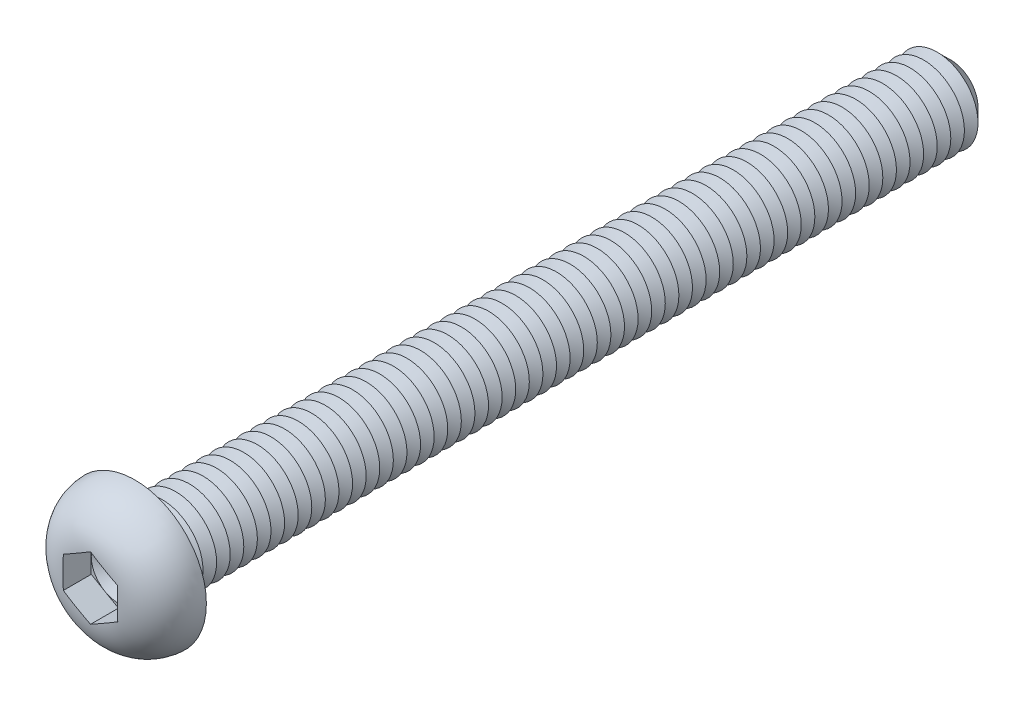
ISO-10303-21;
HEADER;
FILE_DESCRIPTION(('STEP AP214'),'2;1');
FILE_NAME('part.step','',(''),(''),'','','');
FILE_SCHEMA(('AUTOMOTIVE_DESIGN { 1 0 10303 214 1 1 1 1 }'));
ENDSEC;
DATA;
#1=APPLICATION_CONTEXT('core data for automotive mechanical design processes');
#2=APPLICATION_PROTOCOL_DEFINITION('international standard','automotive_design',2000,#1);
#3=PRODUCT_CONTEXT('',#1,'mechanical');
#4=PRODUCT('Part','Part','',(#3));
#5=PRODUCT_RELATED_PRODUCT_CATEGORY('part','',(#4));
#6=PRODUCT_DEFINITION_FORMATION('','',#4);
#7=PRODUCT_DEFINITION_CONTEXT('part definition',#1,'design');
#8=PRODUCT_DEFINITION('design','',#6,#7);
#9=PRODUCT_DEFINITION_SHAPE('','',#8);
#10=(LENGTH_UNIT() NAMED_UNIT(*) SI_UNIT(.MILLI.,.METRE.));
#11=(NAMED_UNIT(*) PLANE_ANGLE_UNIT() SI_UNIT($,.RADIAN.));
#12=(NAMED_UNIT(*) SI_UNIT($,.STERADIAN.) SOLID_ANGLE_UNIT());
#13=UNCERTAINTY_MEASURE_WITH_UNIT(LENGTH_MEASURE(1.E-05),#10,'distance_accuracy_value','');
#14=(GEOMETRIC_REPRESENTATION_CONTEXT(3) GLOBAL_UNCERTAINTY_ASSIGNED_CONTEXT((#13)) GLOBAL_UNIT_ASSIGNED_CONTEXT((#10,
#11,#12)) REPRESENTATION_CONTEXT('',''));
#15=CARTESIAN_POINT('',(0.,0.,0.));
#16=DIRECTION('',(0.,0.,1.));
#17=DIRECTION('',(1.,0.,0.));
#18=AXIS2_PLACEMENT_3D('',#15,#16,#17);
#19=CARTESIAN_POINT('',(0.,0.,1.22));
#20=DIRECTION('',(0.,0.,1.));
#21=DIRECTION('',(1.,0.,0.));
#22=AXIS2_PLACEMENT_3D('',#19,#20,#21);
#23=PLANE('',#22);
#24=CARTESIAN_POINT('',(0.,0.,1.22));
#25=DIRECTION('',(0.,0.,1.));
#26=DIRECTION('',(1.,0.,0.));
#27=AXIS2_PLACEMENT_3D('',#24,#25,#26);
#28=CIRCLE('',#27,2.);
#29=CARTESIAN_POINT('',(2.,0.,1.22));
#30=VERTEX_POINT('',#29);
#31=CARTESIAN_POINT('',(1.,1.73205080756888,1.22));
#32=VERTEX_POINT('',#31);
#33=EDGE_CURVE('E117',#30,#32,#28,.T.);
#34=ORIENTED_EDGE('',*,*,#33,.F.);
#35=DIRECTION('',(0.,1.,0.));
#36=VECTOR('',#35,1.);
#37=CARTESIAN_POINT('',(2.,-1.15470053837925,1.22));
#38=LINE('',#37,#36);
#39=CARTESIAN_POINT('',(2.,1.15470053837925,1.22));
#40=VERTEX_POINT('',#39);
#41=EDGE_CURVE('E140',#30,#40,#38,.T.);
#42=ORIENTED_EDGE('',*,*,#41,.T.);
#43=DIRECTION('',(-0.866025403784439,0.5,0.));
#44=VECTOR('',#43,1.);
#45=CARTESIAN_POINT('',(2.,1.15470053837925,1.22));
#46=LINE('',#45,#44);
#47=EDGE_CURVE('E136',#40,#32,#46,.T.);
#48=ORIENTED_EDGE('',*,*,#47,.T.);
#49=EDGE_LOOP('',(#34,#42,#48));
#50=FACE_BOUND('',#49,.T.);
#51=ADVANCED_FACE('F39',(#50),#23,.T.);
#52=CARTESIAN_POINT('',(0.,0.,1.22));
#53=DIRECTION('',(0.,0.,1.));
#54=DIRECTION('',(1.,0.,0.));
#55=AXIS2_PLACEMENT_3D('',#52,#53,#54);
#56=CIRCLE('',#55,2.);
#57=CARTESIAN_POINT('',(-1.,1.73205080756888,1.22));
#58=VERTEX_POINT('',#57);
#59=EDGE_CURVE('E11',#32,#58,#56,.T.);
#60=ORIENTED_EDGE('',*,*,#59,.F.);
#61=CARTESIAN_POINT('',(0.,2.3094010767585,1.22));
#62=VERTEX_POINT('',#61);
#63=EDGE_CURVE('E130',#32,#62,#46,.T.);
#64=ORIENTED_EDGE('',*,*,#63,.T.);
#65=DIRECTION('',(-0.866025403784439,-0.5,0.));
#66=VECTOR('',#65,1.);
#67=CARTESIAN_POINT('',(0.,2.3094010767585,1.22));
#68=LINE('',#67,#66);
#69=EDGE_CURVE('E131',#62,#58,#68,.T.);
#70=ORIENTED_EDGE('',*,*,#69,.T.);
#71=EDGE_LOOP('',(#60,#64,#70));
#72=FACE_BOUND('',#71,.T.);
#73=ADVANCED_FACE('F129',(#72),#23,.T.);
#74=CARTESIAN_POINT('',(-2.,0.,1.22));
#75=VERTEX_POINT('',#74);
#76=EDGE_CURVE('E49',#58,#75,#56,.T.);
#77=ORIENTED_EDGE('',*,*,#76,.F.);
#78=CARTESIAN_POINT('',(-2.,1.15470053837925,1.22));
#79=VERTEX_POINT('',#78);
#80=EDGE_CURVE('E143',#58,#79,#68,.T.);
#81=ORIENTED_EDGE('',*,*,#80,.T.);
#82=DIRECTION('',(0.,-1.,0.));
#83=VECTOR('',#82,1.);
#84=CARTESIAN_POINT('',(-2.,1.15470053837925,1.22));
#85=LINE('',#84,#83);
#86=EDGE_CURVE('E153',#79,#75,#85,.T.);
#87=ORIENTED_EDGE('',*,*,#86,.T.);
#88=EDGE_LOOP('',(#77,#81,#87));
#89=FACE_BOUND('',#88,.T.);
#90=ADVANCED_FACE('F270',(#89),#23,.T.);
#91=CARTESIAN_POINT('',(-1.,-1.73205080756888,1.22));
#92=VERTEX_POINT('',#91);
#93=EDGE_CURVE('E255',#75,#92,#56,.T.);
#94=ORIENTED_EDGE('',*,*,#93,.F.);
#95=CARTESIAN_POINT('',(-2.,-1.15470053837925,1.22));
#96=VERTEX_POINT('',#95);
#97=EDGE_CURVE('E152',#75,#96,#85,.T.);
#98=ORIENTED_EDGE('',*,*,#97,.T.);
#99=DIRECTION('',(0.866025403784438,-0.5,0.));
#100=VECTOR('',#99,1.);
#101=CARTESIAN_POINT('',(-2.,-1.15470053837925,1.22));
#102=LINE('',#101,#100);
#103=EDGE_CURVE('E158',#96,#92,#102,.T.);
#104=ORIENTED_EDGE('',*,*,#103,.T.);
#105=EDGE_LOOP('',(#94,#98,#104));
#106=FACE_BOUND('',#105,.T.);
#107=ADVANCED_FACE('F264',(#106),#23,.T.);
#108=CARTESIAN_POINT('',(0.999999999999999,-1.73205080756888,1.22));
#109=VERTEX_POINT('',#108);
#110=EDGE_CURVE('E56',#92,#109,#56,.T.);
#111=ORIENTED_EDGE('',*,*,#110,.F.);
#112=CARTESIAN_POINT('',(0.,-2.3094010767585,1.22));
#113=VERTEX_POINT('',#112);
#114=EDGE_CURVE('E157',#92,#113,#102,.T.);
#115=ORIENTED_EDGE('',*,*,#114,.T.);
#116=DIRECTION('',(0.866025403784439,0.5,0.));
#117=VECTOR('',#116,1.);
#118=CARTESIAN_POINT('',(0.,-2.3094010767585,1.22));
#119=LINE('',#118,#117);
#120=EDGE_CURVE('E163',#113,#109,#119,.T.);
#121=ORIENTED_EDGE('',*,*,#120,.T.);
#122=EDGE_LOOP('',(#111,#115,#121));
#123=FACE_BOUND('',#122,.T.);
#124=ADVANCED_FACE('F307',(#123),#23,.T.);
#125=CARTESIAN_POINT('',(0.,0.,-60.));
#126=DIRECTION('',(0.,0.,1.));
#127=DIRECTION('',(1.,0.,0.));
#128=AXIS2_PLACEMENT_3D('',#125,#126,#127);
#129=CYLINDRICAL_SURFACE('',#128,3.);
#130=CARTESIAN_POINT('',(0.,0.,-0.5));
#131=DIRECTION('',(0.,0.,1.));
#132=DIRECTION('',(1.,0.,0.));
#133=AXIS2_PLACEMENT_3D('',#130,#131,#132);
#134=CIRCLE('',#133,3.);
#135=CARTESIAN_POINT('',(3.,0.,-0.5));
#136=VERTEX_POINT('',#135);
#137=EDGE_CURVE('E241',#136,#136,#134,.F.);
#138=ORIENTED_EDGE('',*,*,#137,.T.);
#139=EDGE_LOOP('',(#138));
#140=FACE_BOUND('',#139,.T.);
#141=CARTESIAN_POINT('',(0.,0.,-1.));
#142=DIRECTION('',(0.,0.,1.));
#143=DIRECTION('',(1.,0.,0.));
#144=AXIS2_PLACEMENT_3D('',#141,#142,#143);
#145=CIRCLE('',#144,3.00000000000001);
#146=CARTESIAN_POINT('',(3.00000000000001,0.,-1.));
#147=VERTEX_POINT('',#146);
#148=EDGE_CURVE('E138',#147,#147,#145,.T.);
#149=ORIENTED_EDGE('',*,*,#148,.T.);
#150=EDGE_LOOP('',(#149));
#151=FACE_BOUND('',#150,.T.);
#152=ADVANCED_FACE('F308',(#140,#151),#129,.T.);
#153=CARTESIAN_POINT('',(0.,5.25,0.));
#154=DIRECTION('',(0.,0.,1.));
#155=DIRECTION('',(1.,0.,0.));
#156=AXIS2_PLACEMENT_3D('',#153,#154,#155);
#157=PLANE('',#156);
#158=CARTESIAN_POINT('',(0.,0.,0.));
#159=DIRECTION('',(0.,0.,1.));
#160=DIRECTION('',(1.,0.,0.));
#161=AXIS2_PLACEMENT_3D('',#158,#159,#160);
#162=CIRCLE('',#161,3.5);
#163=CARTESIAN_POINT('',(3.5,0.,0.));
#164=VERTEX_POINT('',#163);
#165=EDGE_CURVE('E244',#164,#164,#162,.T.);
#166=ORIENTED_EDGE('',*,*,#165,.T.);
#167=EDGE_LOOP('',(#166));
#168=FACE_BOUND('',#167,.T.);
#169=CARTESIAN_POINT('',(0.,0.,0.));
#170=DIRECTION('',(0.,0.,1.));
#171=DIRECTION('',(1.,0.,0.));
#172=AXIS2_PLACEMENT_3D('',#169,#170,#171);
#173=CIRCLE('',#172,5.25);
#174=CARTESIAN_POINT('',(5.25,0.,0.));
#175=VERTEX_POINT('',#174);
#176=EDGE_CURVE('E173',#175,#175,#173,.T.);
#177=ORIENTED_EDGE('',*,*,#176,.F.);
#178=EDGE_LOOP('',(#177));
#179=FACE_BOUND('',#178,.T.);
#180=ADVANCED_FACE('F311',(#168,#179),#157,.F.);
#181=CARTESIAN_POINT('',(0.,0.,-0.0999999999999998));
#182=DIRECTION('',(0.,0.,1.));
#183=DIRECTION('',(1.,0.,0.));
#184=AXIS2_PLACEMENT_3D('',#181,#182,#183);
#185=DEGENERATE_TOROIDAL_SURFACE('',#184,1.85147090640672,3.4,.T.);
#186=CARTESIAN_POINT('',(-2.0002,1.15458506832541,3.26900492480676));
#187=CARTESIAN_POINT('',(-1.91694658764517,1.20265144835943,3.27552708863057));
#188=CARTESIAN_POINT('',(-1.83362001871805,1.25076006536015,3.28041849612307));
#189=CARTESIAN_POINT('',(-1.66691146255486,1.34700929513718,3.28784569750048));
#190=CARTESIAN_POINT('',(-1.58352950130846,1.39514989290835,3.29038223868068));
#191=CARTESIAN_POINT('',(-1.4167967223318,1.49141310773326,3.29400753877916));
#192=CARTESIAN_POINT('',(-1.33344591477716,1.5395357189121,3.29509714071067));
#193=CARTESIAN_POINT('',(-1.16673007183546,1.63578915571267,3.29647051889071));
#194=CARTESIAN_POINT('',(-1.08336503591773,1.68391998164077,3.29675420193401));
#195=CARTESIAN_POINT('',(-0.916634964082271,1.78018163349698,3.29675420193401));
#196=CARTESIAN_POINT('',(-0.833269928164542,1.82831245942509,3.29647051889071));
#197=CARTESIAN_POINT('',(-0.666554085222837,1.92456589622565,3.29509714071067));
#198=CARTESIAN_POINT('',(-0.583203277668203,1.9726885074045,3.29400753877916));
#199=CARTESIAN_POINT('',(-0.416470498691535,2.06895172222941,3.29038223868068));
#200=CARTESIAN_POINT('',(-0.333088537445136,2.11709232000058,3.28784569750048));
#201=CARTESIAN_POINT('',(-0.166379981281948,2.21334154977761,3.28041849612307));
#202=CARTESIAN_POINT('',(-0.0830534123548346,2.26145016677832,3.27552708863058));
#203=CARTESIAN_POINT('',(0.000200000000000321,2.30951654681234,3.26900492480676));
#204=B_SPLINE_CURVE_WITH_KNOTS('',3,(#186,#187,#188,#189,#190,#191,#192,#193,#194,#195,#196,
#197,#198,#199,#200,#201,#202,#203),.UNSPECIFIED.,.F.,.F.,(4,2,2,2,2,2,2,2,4),(0.,
0.289010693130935,0.57792963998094,0.866680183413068,1.15546411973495,1.44424805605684,
1.73299859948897,2.02191754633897,2.31092823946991),.UNSPECIFIED.);
#205=CARTESIAN_POINT('',(-2.,1.15470053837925,3.26902062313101));
#206=VERTEX_POINT('',#205);
#207=CARTESIAN_POINT('',(1.70733705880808E-11,2.30940107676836,3.2690206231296));
#208=VERTEX_POINT('',#207);
#209=EDGE_CURVE('E195',#206,#208,#204,.T.);
#210=ORIENTED_EDGE('',*,*,#209,.T.);
#211=CARTESIAN_POINT('',(-0.000199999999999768,2.30951654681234,3.26900492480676));
#212=CARTESIAN_POINT('',(0.0830534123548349,2.26145016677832,3.27552708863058));
#213=CARTESIAN_POINT('',(0.166379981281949,2.21334154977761,3.28041849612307));
#214=CARTESIAN_POINT('',(0.333088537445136,2.11709232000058,3.28784569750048));
#215=CARTESIAN_POINT('',(0.416470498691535,2.06895172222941,3.29038223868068));
#216=CARTESIAN_POINT('',(0.583203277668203,1.9726885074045,3.29400753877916));
#217=CARTESIAN_POINT('',(0.666554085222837,1.92456589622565,3.29509714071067));
#218=CARTESIAN_POINT('',(0.833269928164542,1.82831245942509,3.29647051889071));
#219=CARTESIAN_POINT('',(0.916634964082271,1.78018163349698,3.29675420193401));
#220=CARTESIAN_POINT('',(1.08336503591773,1.68391998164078,3.29675420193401));
#221=CARTESIAN_POINT('',(1.16673007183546,1.63578915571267,3.29647051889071));
#222=CARTESIAN_POINT('',(1.33344591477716,1.5395357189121,3.29509714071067));
#223=CARTESIAN_POINT('',(1.4167967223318,1.49141310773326,3.29400753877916));
#224=CARTESIAN_POINT('',(1.58352950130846,1.39514989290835,3.29038223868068));
#225=CARTESIAN_POINT('',(1.66691146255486,1.34700929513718,3.28784569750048));
#226=CARTESIAN_POINT('',(1.83362001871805,1.25076006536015,3.28041849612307));
#227=CARTESIAN_POINT('',(1.91694658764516,1.20265144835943,3.27552708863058));
#228=CARTESIAN_POINT('',(2.0002,1.15458506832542,3.26900492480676));
#229=B_SPLINE_CURVE_WITH_KNOTS('',3,(#211,#212,#213,#214,#215,#216,#217,#218,#219,#220,#221,
#222,#223,#224,#225,#226,#227,#228),.UNSPECIFIED.,.F.,.F.,(4,2,2,2,2,2,2,2,4),(0.,
0.289010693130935,0.577929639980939,0.866680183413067,1.15546411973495,1.44424805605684,
1.73299859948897,2.02191754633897,2.31092823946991),.UNSPECIFIED.);
#230=CARTESIAN_POINT('',(2.,1.15470053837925,3.26902062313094));
#231=VERTEX_POINT('',#230);
#232=EDGE_CURVE('E224',#208,#231,#229,.T.);
#233=ORIENTED_EDGE('',*,*,#232,.T.);
#234=CARTESIAN_POINT('',(2.,0.,3.29675420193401));
#235=CARTESIAN_POINT('',(2.,-0.0838690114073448,3.29675159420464));
#236=CARTESIAN_POINT('',(2.,-0.167737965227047,3.29653427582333));
#237=CARTESIAN_POINT('',(2.,-0.335473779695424,3.29552217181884));
#238=CARTESIAN_POINT('',(2.,-0.419340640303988,3.29472737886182));
#239=CARTESIAN_POINT('',(2.,-0.587092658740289,3.29218243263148));
#240=CARTESIAN_POINT('',(2.,-0.670977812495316,3.29043194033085));
#241=CARTESIAN_POINT('',(2.,-0.838702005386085,3.28542814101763));
#242=CARTESIAN_POINT('',(2.,-0.922541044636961,3.28217483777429));
#243=CARTESIAN_POINT('',(2.,-1.173343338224,3.26923984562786));
#244=CARTESIAN_POINT('',(2.,-1.34017699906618,3.25638268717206));
#245=CARTESIAN_POINT('',(2.,-1.67225876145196,3.21731215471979));
#246=CARTESIAN_POINT('',(2.,-1.83750825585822,3.19111187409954));
#247=CARTESIAN_POINT('',(2.,-2.10571503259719,3.13417573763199));
#248=CARTESIAN_POINT('',(2.,-2.20973442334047,3.10844622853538));
#249=CARTESIAN_POINT('',(2.,-2.41562153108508,3.04936015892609));
#250=CARTESIAN_POINT('',(2.,-2.51748898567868,3.01600267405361));
#251=CARTESIAN_POINT('',(2.,-2.71832295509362,2.94120377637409));
#252=CARTESIAN_POINT('',(2.,-2.81728700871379,2.89975572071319));
#253=CARTESIAN_POINT('',(2.,-3.01134256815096,2.80859624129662));
#254=CARTESIAN_POINT('',(2.,-3.10643425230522,2.75888519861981));
#255=CARTESIAN_POINT('',(2.,-3.29253530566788,2.65079509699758));
#256=CARTESIAN_POINT('',(2.,-3.38350832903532,2.59235327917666));
#257=CARTESIAN_POINT('',(2.,-3.55964478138,2.46728791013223));
#258=CARTESIAN_POINT('',(2.,-3.64480873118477,2.40066509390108));
#259=CARTESIAN_POINT('',(2.,-3.80840353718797,2.25961603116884));
#260=CARTESIAN_POINT('',(2.,-3.88683504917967,2.18519054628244));
#261=CARTESIAN_POINT('',(2.,-4.03608847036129,2.02906828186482));
#262=CARTESIAN_POINT('',(2.,-4.106911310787,1.94737239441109));
#263=CARTESIAN_POINT('',(2.,-4.23287471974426,1.78665318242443));
#264=CARTESIAN_POINT('',(2.,-4.2888832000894,1.7083085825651));
#265=CARTESIAN_POINT('',(2.,-4.39372062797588,1.54691061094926));
#266=CARTESIAN_POINT('',(2.,-4.44254705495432,1.46385560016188));
#267=CARTESIAN_POINT('',(2.,-4.53249771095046,1.29375158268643));
#268=CARTESIAN_POINT('',(2.,-4.57362814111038,1.20670586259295));
#269=CARTESIAN_POINT('',(2.,-4.6478549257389,1.02924414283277));
#270=CARTESIAN_POINT('',(2.,-4.68094842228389,0.938826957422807));
#271=CARTESIAN_POINT('',(2.,-4.76413649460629,0.674747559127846));
#272=CARTESIAN_POINT('',(2.,-4.80368573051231,0.497625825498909));
#273=CARTESIAN_POINT('',(2.,-4.85179982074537,0.13932226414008));
#274=CARTESIAN_POINT('',(2.,-4.86036774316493,-0.0418591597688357));
#275=CARTESIAN_POINT('',(2.,-4.84642577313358,-0.399473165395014));
#276=CARTESIAN_POINT('',(2.,-4.82452156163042,-0.575929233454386));
#277=CARTESIAN_POINT('',(2.,-4.75142809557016,-0.922615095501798));
#278=CARTESIAN_POINT('',(2.,-4.70024536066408,-1.09284626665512));
#279=CARTESIAN_POINT('',(2.,-4.57020203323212,-1.42258491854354));
#280=CARTESIAN_POINT('',(2.,-4.49131097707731,-1.58208036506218));
#281=CARTESIAN_POINT('',(2.,-4.3083542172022,-1.8860021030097));
#282=CARTESIAN_POINT('',(2.,-4.2042742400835,-2.03041978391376));
#283=CARTESIAN_POINT('',(2.,-3.97174533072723,-2.30354399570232));
#284=CARTESIAN_POINT('',(2.,-3.84281347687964,-2.43183812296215));
#285=CARTESIAN_POINT('',(2.,-3.56631740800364,-2.66612298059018));
#286=CARTESIAN_POINT('',(2.,-3.41877418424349,-2.77213848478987));
#287=CARTESIAN_POINT('',(2.,-3.18261597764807,-2.91604941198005));
#288=CARTESIAN_POINT('',(2.,-3.09905663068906,-2.96247915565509));
#289=CARTESIAN_POINT('',(2.,-2.92856838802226,-3.04879370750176));
#290=CARTESIAN_POINT('',(2.,-2.84163827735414,-3.08867612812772));
#291=CARTESIAN_POINT('',(2.,-2.66495003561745,-3.16199567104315));
#292=CARTESIAN_POINT('',(2.,-2.57518752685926,-3.19542218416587));
#293=CARTESIAN_POINT('',(2.,-2.3936698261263,-3.25594506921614));
#294=CARTESIAN_POINT('',(2.,-2.30191676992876,-3.28304789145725));
#295=CARTESIAN_POINT('',(2.,-2.07265810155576,-3.34285611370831));
#296=CARTESIAN_POINT('',(2.,-1.93423373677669,-3.37205334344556));
#297=CARTESIAN_POINT('',(2.,-1.65546420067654,-3.419280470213));
#298=CARTESIAN_POINT('',(2.,-1.51511762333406,-3.43730169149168));
#299=CARTESIAN_POINT('',(2.,-1.23291689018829,-3.46473877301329));
#300=CARTESIAN_POINT('',(2.,-1.09105869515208,-3.47411015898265));
#301=CARTESIAN_POINT('',(2.,-0.807138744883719,-3.48717303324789));
#302=CARTESIAN_POINT('',(2.,-0.665077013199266,-3.4908651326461));
#303=CARTESIAN_POINT('',(2.,-0.451303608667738,-3.49429675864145));
#304=CARTESIAN_POINT('',(2.,-0.379602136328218,-3.49508825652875));
#305=CARTESIAN_POINT('',(2.,-0.236195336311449,-3.49619580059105));
#306=CARTESIAN_POINT('',(2.,-0.164490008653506,-3.49651184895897));
#307=CARTESIAN_POINT('',(2.,-0.0210718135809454,-3.49680708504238));
#308=CARTESIAN_POINT('',(2.,0.0506410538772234,-3.49678623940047));
#309=CARTESIAN_POINT('',(2.,0.194065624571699,-3.49639104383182));
#310=CARTESIAN_POINT('',(2.,0.265777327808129,-3.49601669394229));
#311=CARTESIAN_POINT('',(2.,0.480501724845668,-3.4941697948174));
#312=CARTESIAN_POINT('',(2.,0.623510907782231,-3.49197539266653));
#313=CARTESIAN_POINT('',(2.,0.909378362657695,-3.48318258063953));
#314=CARTESIAN_POINT('',(2.,1.05223667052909,-3.47658576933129));
#315=CARTESIAN_POINT('',(2.,1.30726724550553,-3.45800282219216));
#316=CARTESIAN_POINT('',(2.,1.41953767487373,-3.44745204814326));
#317=CARTESIAN_POINT('',(2.,1.64336701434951,-3.42020385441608));
#318=CARTESIAN_POINT('',(2.,1.75492585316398,-3.40350582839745));
#319=CARTESIAN_POINT('',(2.,1.97590795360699,-3.36293007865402));
#320=CARTESIAN_POINT('',(2.,2.08534088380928,-3.33910600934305));
#321=CARTESIAN_POINT('',(2.,2.30216001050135,-3.28336687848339));
#322=CARTESIAN_POINT('',(2.,2.40954602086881,-3.25145108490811));
#323=CARTESIAN_POINT('',(2.,2.62289868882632,-3.1784271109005));
#324=CARTESIAN_POINT('',(2.,2.72882262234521,-3.13719314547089));
#325=CARTESIAN_POINT('',(2.,2.93660837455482,-3.04548652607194));
#326=CARTESIAN_POINT('',(2.,3.03847031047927,-2.99501413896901));
#327=CARTESIAN_POINT('',(2.,3.23738754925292,-2.88459171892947));
#328=CARTESIAN_POINT('',(2.,3.33442546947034,-2.82461027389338));
#329=CARTESIAN_POINT('',(2.,3.52225616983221,-2.69545434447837));
#330=CARTESIAN_POINT('',(2.,3.61304636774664,-2.62627609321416));
#331=CARTESIAN_POINT('',(2.,3.77958578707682,-2.48563135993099));
#332=CARTESIAN_POINT('',(2.,3.85595570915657,-2.41489922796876));
#333=CARTESIAN_POINT('',(2.,4.00175744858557,-2.26661746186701));
#334=CARTESIAN_POINT('',(2.,4.07118992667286,-2.18906847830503));
#335=CARTESIAN_POINT('',(2.,4.20228235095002,-2.02784942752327));
#336=CARTESIAN_POINT('',(2.,4.26395450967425,-1.94418931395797));
#337=CARTESIAN_POINT('',(2.,4.37897455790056,-1.7713710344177));
#338=CARTESIAN_POINT('',(2.,4.43232318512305,-1.68221335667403));
#339=CARTESIAN_POINT('',(2.,4.5685109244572,-1.42722170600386));
#340=CARTESIAN_POINT('',(2.,4.64167742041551,-1.25607726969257));
#341=CARTESIAN_POINT('',(2.,4.75695354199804,-0.903699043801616));
#342=CARTESIAN_POINT('',(2.,4.79906366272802,-0.722465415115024));
#343=CARTESIAN_POINT('',(2.,4.84982785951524,-0.362243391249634));
#344=CARTESIAN_POINT('',(2.,4.85966759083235,-0.183422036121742));
#345=CARTESIAN_POINT('',(2.,4.84889099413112,0.17327689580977));
#346=CARTESIAN_POINT('',(2.,4.82827907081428,0.351154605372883));
#347=CARTESIAN_POINT('',(2.,4.75760776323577,0.699332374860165));
#348=CARTESIAN_POINT('',(2.,4.70780624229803,0.869684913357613));
#349=CARTESIAN_POINT('',(2.,4.58058971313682,1.199716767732));
#350=CARTESIAN_POINT('',(2.,4.50317623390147,1.35939667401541));
#351=CARTESIAN_POINT('',(2.,4.32230037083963,1.66542907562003));
#352=CARTESIAN_POINT('',(2.,4.21858077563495,1.81162931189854));
#353=CARTESIAN_POINT('',(2.,3.98879583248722,2.08527000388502));
#354=CARTESIAN_POINT('',(2.,3.86272429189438,2.21270524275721));
#355=CARTESIAN_POINT('',(2.,3.58743550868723,2.45020985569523));
#356=CARTESIAN_POINT('',(2.,3.43756474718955,2.55951924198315));
#357=CARTESIAN_POINT('',(2.,3.12282273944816,2.7535430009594));
#358=CARTESIAN_POINT('',(2.,2.95795742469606,2.83826704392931));
#359=CARTESIAN_POINT('',(2.,2.67096435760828,2.96064273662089));
#360=CARTESIAN_POINT('',(2.,2.55150855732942,3.00473766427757));
#361=CARTESIAN_POINT('',(2.,2.30905936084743,3.08191633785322));
#362=CARTESIAN_POINT('',(2.,2.18606487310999,3.11499664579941));
#363=CARTESIAN_POINT('',(2.,1.93761764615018,3.17114962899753));
#364=CARTESIAN_POINT('',(2.,1.8121607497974,3.19420352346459));
#365=CARTESIAN_POINT('',(2.,1.56000755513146,3.23170431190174));
#366=CARTESIAN_POINT('',(2.,1.43331126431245,3.24615125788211));
#367=CARTESIAN_POINT('',(2.,1.19785080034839,3.26676473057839));
#368=CARTESIAN_POINT('',(2.,1.08915974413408,3.27383022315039));
#369=CARTESIAN_POINT('',(2.,0.87159878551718,3.28448481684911));
#370=CARTESIAN_POINT('',(2.,0.762728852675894,3.28807324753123));
#371=CARTESIAN_POINT('',(2.,0.54488171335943,3.29312180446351));
#372=CARTESIAN_POINT('',(2.,0.435904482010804,3.29458062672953));
#373=CARTESIAN_POINT('',(2.,0.217951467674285,3.29639847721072));
#374=CARTESIAN_POINT('',(2.,0.108975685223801,3.29675759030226));
#375=CARTESIAN_POINT('',(2.,0.,3.29675420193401));
#376=B_SPLINE_CURVE_WITH_KNOTS('',3,(#234,#235,#236,#237,#238,#239,#240,#241,#242,#243,#244,
#245,#246,#247,#248,#249,#250,#251,#252,#253,#254,#255,#256,#257,#258,#259,#260,#261,#262,#263,
#264,#265,#266,#267,#268,#269,#270,#271,#272,#273,#274,#275,#276,#277,#278,#279,#280,#281,#282,
#283,#284,#285,#286,#287,#288,#289,#290,#291,#292,#293,#294,#295,#296,#297,#298,#299,#300,#301,
#302,#303,#304,#305,#306,#307,#308,#309,#310,#311,#312,#313,#314,#315,#316,#317,#318,#319,#320,
#321,#322,#323,#324,#325,#326,#327,#328,#329,#330,#331,#332,#333,#334,#335,#336,#337,#338,#339,
#340,#341,#342,#343,#344,#345,#346,#347,#348,#349,#350,#351,#352,#353,#354,#355,#356,#357,#358,
#359,#360,#361,#362,#363,#364,#365,#366,#367,#368,#369,#370,#371,#372,#373,#374,#375),
.UNSPECIFIED.,.T.,.F.,(4,2,2,2,2,2,2,2,2,2,2,2,2,2,2,2,2,2,2,2,2,2,2,2,2,2,2,2,2,2,2,2,2,2,2,2,
2,2,2,2,2,2,2,2,2,2,2,2,2,2,2,2,2,2,2,2,2,2,2,2,2,2,2,2,2,2,2,2,2,2,4),(0.,0.251606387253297,
0.503215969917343,0.754914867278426,1.00661313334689,1.50825543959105,2.00940643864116,
2.33061510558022,2.65186271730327,2.97337521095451,3.29487288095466,3.61880390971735,
3.94270585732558,4.26657621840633,4.59040689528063,4.8789527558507,5.16759964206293,
5.45601293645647,5.74452864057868,6.28608750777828,6.82759274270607,7.35848716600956,
7.8892634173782,8.42062506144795,8.95228851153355,9.49557283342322,10.0382497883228,
10.3247866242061,10.6114277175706,10.8985359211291,11.1853499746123,11.6091713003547,
12.0333212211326,12.4596400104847,12.8859129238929,13.1010304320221,13.316146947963,
13.5312847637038,13.746422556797,14.1754765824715,14.6043748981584,14.9425387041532,
15.2807358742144,15.6164481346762,15.9521907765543,16.2927694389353,16.6333382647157,
16.9750565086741,17.3169151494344,17.6287548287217,17.9405647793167,18.2518777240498,
18.5631630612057,19.1185081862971,19.6738444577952,20.20853386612,20.7431459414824,
21.2731049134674,21.8030345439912,22.3383600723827,22.8738341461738,23.4279697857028,
23.9818871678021,24.3633752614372,24.7449823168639,25.1273011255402,25.5096176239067,
25.8363061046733,26.163057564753,26.4900090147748,26.8169352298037),.UNSPECIFIED.);
#377=CARTESIAN_POINT('',(2.,-1.15470053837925,3.26902062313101));
#378=VERTEX_POINT('',#377);
#379=EDGE_CURVE('E233',#231,#378,#376,.T.);
#380=ORIENTED_EDGE('',*,*,#379,.T.);
#381=CARTESIAN_POINT('',(2.0002,-1.15458506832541,3.26900492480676));
#382=CARTESIAN_POINT('',(1.91694658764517,-1.20265144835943,3.27552708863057));
#383=CARTESIAN_POINT('',(1.83362001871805,-1.25076006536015,3.28041849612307));
#384=CARTESIAN_POINT('',(1.66691146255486,-1.34700929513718,3.28784569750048));
#385=CARTESIAN_POINT('',(1.58352950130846,-1.39514989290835,3.29038223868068));
#386=CARTESIAN_POINT('',(1.4167967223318,-1.49141310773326,3.29400753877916));
#387=CARTESIAN_POINT('',(1.33344591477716,-1.5395357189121,3.29509714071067));
#388=CARTESIAN_POINT('',(1.16673007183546,-1.63578915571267,3.29647051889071));
#389=CARTESIAN_POINT('',(1.08336503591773,-1.68391998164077,3.29675420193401));
#390=CARTESIAN_POINT('',(0.916634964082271,-1.78018163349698,3.29675420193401));
#391=CARTESIAN_POINT('',(0.833269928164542,-1.82831245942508,3.29647051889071));
#392=CARTESIAN_POINT('',(0.666554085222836,-1.92456589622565,3.29509714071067));
#393=CARTESIAN_POINT('',(0.583203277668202,-1.97268850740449,3.29400753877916));
#394=CARTESIAN_POINT('',(0.416470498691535,-2.06895172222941,3.29038223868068));
#395=CARTESIAN_POINT('',(0.333088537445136,-2.11709232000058,3.28784569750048));
#396=CARTESIAN_POINT('',(0.166379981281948,-2.2133415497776,3.28041849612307));
#397=CARTESIAN_POINT('',(0.0830534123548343,-2.26145016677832,3.27552708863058));
#398=CARTESIAN_POINT('',(-0.000200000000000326,-2.30951654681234,3.26900492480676));
#399=B_SPLINE_CURVE_WITH_KNOTS('',3,(#381,#382,#383,#384,#385,#386,#387,#388,#389,#390,#391,
#392,#393,#394,#395,#396,#397,#398),.UNSPECIFIED.,.F.,.F.,(4,2,2,2,2,2,2,2,4),(0.,
0.289010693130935,0.57792963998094,0.866680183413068,1.15546411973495,1.44424805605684,
1.73299859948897,2.02191754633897,2.31092823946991),.UNSPECIFIED.);
#400=CARTESIAN_POINT('',(0.,-2.3094010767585,3.26902062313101));
#401=VERTEX_POINT('',#400);
#402=EDGE_CURVE('E281',#378,#401,#399,.T.);
#403=ORIENTED_EDGE('',*,*,#402,.T.);
#404=CARTESIAN_POINT('',(0.000199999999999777,-2.30951654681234,3.26900492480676));
#405=CARTESIAN_POINT('',(-0.083053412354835,-2.26145016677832,3.27552708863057));
#406=CARTESIAN_POINT('',(-0.166379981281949,-2.21334154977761,3.28041849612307));
#407=CARTESIAN_POINT('',(-0.333088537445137,-2.11709232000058,3.28784569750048));
#408=CARTESIAN_POINT('',(-0.416470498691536,-2.06895172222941,3.29038223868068));
#409=CARTESIAN_POINT('',(-0.583203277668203,-1.97268850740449,3.29400753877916));
#410=CARTESIAN_POINT('',(-0.666554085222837,-1.92456589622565,3.29509714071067));
#411=CARTESIAN_POINT('',(-0.833269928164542,-1.82831245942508,3.29647051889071));
#412=CARTESIAN_POINT('',(-0.916634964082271,-1.78018163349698,3.29675420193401));
#413=CARTESIAN_POINT('',(-1.08336503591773,-1.68391998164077,3.29675420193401));
#414=CARTESIAN_POINT('',(-1.16673007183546,-1.63578915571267,3.29647051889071));
#415=CARTESIAN_POINT('',(-1.33344591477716,-1.5395357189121,3.29509714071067));
#416=CARTESIAN_POINT('',(-1.4167967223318,-1.49141310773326,3.29400753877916));
#417=CARTESIAN_POINT('',(-1.58352950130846,-1.39514989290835,3.29038223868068));
#418=CARTESIAN_POINT('',(-1.66691146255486,-1.34700929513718,3.28784569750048));
#419=CARTESIAN_POINT('',(-1.83362001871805,-1.25076006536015,3.28041849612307));
#420=CARTESIAN_POINT('',(-1.91694658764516,-1.20265144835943,3.27552708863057));
#421=CARTESIAN_POINT('',(-2.0002,-1.15458506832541,3.26900492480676));
#422=B_SPLINE_CURVE_WITH_KNOTS('',3,(#404,#405,#406,#407,#408,#409,#410,#411,#412,#413,#414,
#415,#416,#417,#418,#419,#420,#421),.UNSPECIFIED.,.F.,.F.,(4,2,2,2,2,2,2,2,4),(0.,
0.289010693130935,0.577929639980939,0.866680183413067,1.15546411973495,1.44424805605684,
1.73299859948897,2.02191754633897,2.31092823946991),.UNSPECIFIED.);
#423=CARTESIAN_POINT('',(-2.,-1.15470053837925,3.26902062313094));
#424=VERTEX_POINT('',#423);
#425=EDGE_CURVE('E277',#401,#424,#422,.T.);
#426=ORIENTED_EDGE('',*,*,#425,.T.);
#427=CARTESIAN_POINT('',(-2.,0.,3.29675420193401));
#428=CARTESIAN_POINT('',(-2.,0.0838690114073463,3.29675159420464));
#429=CARTESIAN_POINT('',(-2.,0.167737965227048,3.29653427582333));
#430=CARTESIAN_POINT('',(-2.,0.335473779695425,3.29552217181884));
#431=CARTESIAN_POINT('',(-2.,0.41934064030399,3.29472737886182));
#432=CARTESIAN_POINT('',(-2.,0.58709265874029,3.29218243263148));
#433=CARTESIAN_POINT('',(-2.,0.670977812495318,3.29043194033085));
#434=CARTESIAN_POINT('',(-2.,0.838702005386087,3.28542814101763));
#435=CARTESIAN_POINT('',(-2.,0.922541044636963,3.28217483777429));
#436=CARTESIAN_POINT('',(-2.,1.173343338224,3.26923984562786));
#437=CARTESIAN_POINT('',(-2.,1.34017699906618,3.25638268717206));
#438=CARTESIAN_POINT('',(-2.,1.67225876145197,3.21731215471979));
#439=CARTESIAN_POINT('',(-2.,1.83750825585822,3.19111187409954));
#440=CARTESIAN_POINT('',(-2.,2.10571503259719,3.13417573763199));
#441=CARTESIAN_POINT('',(-2.,2.20973442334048,3.10844622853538));
#442=CARTESIAN_POINT('',(-2.,2.41562153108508,3.04936015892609));
#443=CARTESIAN_POINT('',(-2.,2.51748898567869,3.01600267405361));
#444=CARTESIAN_POINT('',(-2.,2.71832295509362,2.94120377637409));
#445=CARTESIAN_POINT('',(-2.,2.81728700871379,2.89975572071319));
#446=CARTESIAN_POINT('',(-2.,3.01134256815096,2.80859624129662));
#447=CARTESIAN_POINT('',(-2.,3.10643425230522,2.75888519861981));
#448=CARTESIAN_POINT('',(-2.,3.29253530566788,2.65079509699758));
#449=CARTESIAN_POINT('',(-2.,3.38350832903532,2.59235327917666));
#450=CARTESIAN_POINT('',(-2.,3.55964478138,2.46728791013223));
#451=CARTESIAN_POINT('',(-2.,3.64480873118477,2.40066509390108));
#452=CARTESIAN_POINT('',(-2.,3.80840353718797,2.25961603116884));
#453=CARTESIAN_POINT('',(-2.,3.88683504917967,2.18519054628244));
#454=CARTESIAN_POINT('',(-2.,4.03608847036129,2.02906828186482));
#455=CARTESIAN_POINT('',(-2.,4.106911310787,1.94737239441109));
#456=CARTESIAN_POINT('',(-2.,4.23287471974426,1.78665318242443));
#457=CARTESIAN_POINT('',(-2.,4.2888832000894,1.7083085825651));
#458=CARTESIAN_POINT('',(-2.,4.39372062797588,1.54691061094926));
#459=CARTESIAN_POINT('',(-2.,4.44254705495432,1.46385560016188));
#460=CARTESIAN_POINT('',(-2.,4.53249771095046,1.29375158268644));
#461=CARTESIAN_POINT('',(-2.,4.57362814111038,1.20670586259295));
#462=CARTESIAN_POINT('',(-2.,4.6478549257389,1.02924414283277));
#463=CARTESIAN_POINT('',(-2.,4.68094842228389,0.938826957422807));
#464=CARTESIAN_POINT('',(-2.,4.76413649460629,0.674747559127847));
#465=CARTESIAN_POINT('',(-2.,4.80368573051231,0.497625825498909));
#466=CARTESIAN_POINT('',(-2.,4.85179982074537,0.13932226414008));
#467=CARTESIAN_POINT('',(-2.,4.86036774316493,-0.0418591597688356));
#468=CARTESIAN_POINT('',(-2.,4.84642577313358,-0.399473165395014));
#469=CARTESIAN_POINT('',(-2.,4.82452156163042,-0.575929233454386));
#470=CARTESIAN_POINT('',(-2.,4.75142809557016,-0.922615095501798));
#471=CARTESIAN_POINT('',(-2.,4.70024536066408,-1.09284626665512));
#472=CARTESIAN_POINT('',(-2.,4.57020203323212,-1.42258491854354));
#473=CARTESIAN_POINT('',(-2.,4.49131097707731,-1.58208036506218));
#474=CARTESIAN_POINT('',(-2.,4.3083542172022,-1.8860021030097));
#475=CARTESIAN_POINT('',(-2.,4.2042742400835,-2.03041978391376));
#476=CARTESIAN_POINT('',(-2.,3.97174533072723,-2.30354399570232));
#477=CARTESIAN_POINT('',(-2.,3.84281347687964,-2.43183812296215));
#478=CARTESIAN_POINT('',(-2.,3.56631740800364,-2.66612298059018));
#479=CARTESIAN_POINT('',(-2.,3.41877418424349,-2.77213848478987));
#480=CARTESIAN_POINT('',(-2.,3.18261597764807,-2.91604941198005));
#481=CARTESIAN_POINT('',(-2.,3.09905663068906,-2.96247915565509));
#482=CARTESIAN_POINT('',(-2.,2.92856838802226,-3.04879370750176));
#483=CARTESIAN_POINT('',(-2.,2.84163827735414,-3.08867612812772));
#484=CARTESIAN_POINT('',(-2.,2.66495003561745,-3.16199567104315));
#485=CARTESIAN_POINT('',(-2.,2.57518752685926,-3.19542218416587));
#486=CARTESIAN_POINT('',(-2.,2.3936698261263,-3.25594506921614));
#487=CARTESIAN_POINT('',(-2.,2.30191676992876,-3.28304789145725));
#488=CARTESIAN_POINT('',(-2.,2.07265810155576,-3.34285611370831));
#489=CARTESIAN_POINT('',(-2.,1.93423373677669,-3.37205334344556));
#490=CARTESIAN_POINT('',(-2.,1.65546420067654,-3.419280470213));
#491=CARTESIAN_POINT('',(-2.,1.51511762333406,-3.43730169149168));
#492=CARTESIAN_POINT('',(-2.,1.23291689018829,-3.46473877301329));
#493=CARTESIAN_POINT('',(-2.,1.09105869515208,-3.47411015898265));
#494=CARTESIAN_POINT('',(-2.,0.807138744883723,-3.48717303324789));
#495=CARTESIAN_POINT('',(-2.,0.66507701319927,-3.4908651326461));
#496=CARTESIAN_POINT('',(-2.,0.451303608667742,-3.49429675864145));
#497=CARTESIAN_POINT('',(-2.,0.379602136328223,-3.49508825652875));
#498=CARTESIAN_POINT('',(-2.,0.236195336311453,-3.49619580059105));
#499=CARTESIAN_POINT('',(-2.,0.16449000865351,-3.49651184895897));
#500=CARTESIAN_POINT('',(-2.,0.0210718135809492,-3.49680708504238));
#501=CARTESIAN_POINT('',(-2.,-0.0506410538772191,-3.49678623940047));
#502=CARTESIAN_POINT('',(-2.,-0.194065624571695,-3.49639104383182));
#503=CARTESIAN_POINT('',(-2.,-0.265777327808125,-3.49601669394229));
#504=CARTESIAN_POINT('',(-2.,-0.480501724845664,-3.4941697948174));
#505=CARTESIAN_POINT('',(-2.,-0.623510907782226,-3.49197539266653));
#506=CARTESIAN_POINT('',(-2.,-0.909378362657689,-3.48318258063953));
#507=CARTESIAN_POINT('',(-2.,-1.05223667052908,-3.47658576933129));
#508=CARTESIAN_POINT('',(-2.,-1.30726724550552,-3.45800282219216));
#509=CARTESIAN_POINT('',(-2.,-1.41953767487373,-3.44745204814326));
#510=CARTESIAN_POINT('',(-2.,-1.6433670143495,-3.42020385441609));
#511=CARTESIAN_POINT('',(-2.,-1.75492585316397,-3.40350582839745));
#512=CARTESIAN_POINT('',(-2.,-1.97590795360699,-3.36293007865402));
#513=CARTESIAN_POINT('',(-2.,-2.08534088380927,-3.33910600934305));
#514=CARTESIAN_POINT('',(-2.,-2.30216001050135,-3.28336687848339));
#515=CARTESIAN_POINT('',(-2.,-2.4095460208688,-3.25145108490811));
#516=CARTESIAN_POINT('',(-2.,-2.62289868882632,-3.1784271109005));
#517=CARTESIAN_POINT('',(-2.,-2.72882262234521,-3.13719314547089));
#518=CARTESIAN_POINT('',(-2.,-2.93660837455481,-3.04548652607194));
#519=CARTESIAN_POINT('',(-2.,-3.03847031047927,-2.99501413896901));
#520=CARTESIAN_POINT('',(-2.,-3.23738754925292,-2.88459171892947));
#521=CARTESIAN_POINT('',(-2.,-3.33442546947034,-2.82461027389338));
#522=CARTESIAN_POINT('',(-2.,-3.52225616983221,-2.69545434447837));
#523=CARTESIAN_POINT('',(-2.,-3.61304636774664,-2.62627609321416));
#524=CARTESIAN_POINT('',(-2.,-3.77958578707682,-2.48563135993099));
#525=CARTESIAN_POINT('',(-2.,-3.85595570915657,-2.41489922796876));
#526=CARTESIAN_POINT('',(-2.,-4.00175744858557,-2.26661746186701));
#527=CARTESIAN_POINT('',(-2.,-4.07118992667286,-2.18906847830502));
#528=CARTESIAN_POINT('',(-2.,-4.20228235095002,-2.02784942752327));
#529=CARTESIAN_POINT('',(-2.,-4.26395450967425,-1.94418931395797));
#530=CARTESIAN_POINT('',(-2.,-4.37897455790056,-1.7713710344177));
#531=CARTESIAN_POINT('',(-2.,-4.43232318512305,-1.68221335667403));
#532=CARTESIAN_POINT('',(-2.,-4.5685109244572,-1.42722170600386));
#533=CARTESIAN_POINT('',(-2.,-4.64167742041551,-1.25607726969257));
#534=CARTESIAN_POINT('',(-2.,-4.75695354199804,-0.903699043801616));
#535=CARTESIAN_POINT('',(-2.,-4.79906366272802,-0.722465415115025));
#536=CARTESIAN_POINT('',(-2.,-4.84982785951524,-0.362243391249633));
#537=CARTESIAN_POINT('',(-2.,-4.85966759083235,-0.18342203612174));
#538=CARTESIAN_POINT('',(-2.,-4.84889099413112,0.173276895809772));
#539=CARTESIAN_POINT('',(-2.,-4.82827907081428,0.351154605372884));
#540=CARTESIAN_POINT('',(-2.,-4.75760776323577,0.699332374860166));
#541=CARTESIAN_POINT('',(-2.,-4.70780624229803,0.869684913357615));
#542=CARTESIAN_POINT('',(-2.,-4.58058971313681,1.199716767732));
#543=CARTESIAN_POINT('',(-2.,-4.50317623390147,1.35939667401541));
#544=CARTESIAN_POINT('',(-2.,-4.32230037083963,1.66542907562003));
#545=CARTESIAN_POINT('',(-2.,-4.21858077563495,1.81162931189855));
#546=CARTESIAN_POINT('',(-2.,-3.98879583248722,2.08527000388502));
#547=CARTESIAN_POINT('',(-2.,-3.86272429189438,2.21270524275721));
#548=CARTESIAN_POINT('',(-2.,-3.58743550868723,2.45020985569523));
#549=CARTESIAN_POINT('',(-2.,-3.43756474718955,2.55951924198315));
#550=CARTESIAN_POINT('',(-2.,-3.12282273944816,2.7535430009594));
#551=CARTESIAN_POINT('',(-2.,-2.95795742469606,2.8382670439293));
#552=CARTESIAN_POINT('',(-2.,-2.67096435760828,2.96064273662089));
#553=CARTESIAN_POINT('',(-2.,-2.55150855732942,3.00473766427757));
#554=CARTESIAN_POINT('',(-2.,-2.30905936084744,3.08191633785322));
#555=CARTESIAN_POINT('',(-2.,-2.18606487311,3.11499664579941));
#556=CARTESIAN_POINT('',(-2.,-1.93761764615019,3.17114962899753));
#557=CARTESIAN_POINT('',(-2.,-1.81216074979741,3.19420352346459));
#558=CARTESIAN_POINT('',(-2.,-1.56000755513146,3.23170431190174));
#559=CARTESIAN_POINT('',(-2.,-1.43331126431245,3.24615125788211));
#560=CARTESIAN_POINT('',(-2.,-1.19785080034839,3.26676473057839));
#561=CARTESIAN_POINT('',(-2.,-1.08915974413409,3.27383022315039));
#562=CARTESIAN_POINT('',(-2.,-0.871598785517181,3.28448481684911));
#563=CARTESIAN_POINT('',(-2.,-0.762728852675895,3.28807324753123));
#564=CARTESIAN_POINT('',(-2.,-0.54488171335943,3.29312180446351));
#565=CARTESIAN_POINT('',(-2.,-0.435904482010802,3.29458062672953));
#566=CARTESIAN_POINT('',(-2.,-0.217951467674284,3.29639847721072));
#567=CARTESIAN_POINT('',(-2.,-0.108975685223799,3.29675759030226));
#568=CARTESIAN_POINT('',(-2.,0.,3.29675420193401));
#569=B_SPLINE_CURVE_WITH_KNOTS('',3,(#427,#428,#429,#430,#431,#432,#433,#434,#435,#436,#437,
#438,#439,#440,#441,#442,#443,#444,#445,#446,#447,#448,#449,#450,#451,#452,#453,#454,#455,#456,
#457,#458,#459,#460,#461,#462,#463,#464,#465,#466,#467,#468,#469,#470,#471,#472,#473,#474,#475,
#476,#477,#478,#479,#480,#481,#482,#483,#484,#485,#486,#487,#488,#489,#490,#491,#492,#493,#494,
#495,#496,#497,#498,#499,#500,#501,#502,#503,#504,#505,#506,#507,#508,#509,#510,#511,#512,#513,
#514,#515,#516,#517,#518,#519,#520,#521,#522,#523,#524,#525,#526,#527,#528,#529,#530,#531,#532,
#533,#534,#535,#536,#537,#538,#539,#540,#541,#542,#543,#544,#545,#546,#547,#548,#549,#550,#551,
#552,#553,#554,#555,#556,#557,#558,#559,#560,#561,#562,#563,#564,#565,#566,#567,#568),
.UNSPECIFIED.,.T.,.F.,(4,2,2,2,2,2,2,2,2,2,2,2,2,2,2,2,2,2,2,2,2,2,2,2,2,2,2,2,2,2,2,2,2,2,2,2,
2,2,2,2,2,2,2,2,2,2,2,2,2,2,2,2,2,2,2,2,2,2,2,2,2,2,2,2,2,2,2,2,2,2,4),(0.,0.251606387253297,
0.503215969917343,0.754914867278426,1.0066131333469,1.50825543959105,2.00940643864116,
2.33061510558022,2.65186271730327,2.97337521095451,3.29487288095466,3.61880390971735,
3.94270585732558,4.26657621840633,4.59040689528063,4.8789527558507,5.16759964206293,
5.45601293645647,5.74452864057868,6.28608750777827,6.82759274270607,7.35848716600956,
7.88926341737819,8.42062506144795,8.95228851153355,9.49557283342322,10.0382497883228,
10.3247866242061,10.6114277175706,10.8985359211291,11.1853499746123,11.6091713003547,
12.0333212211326,12.4596400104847,12.8859129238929,13.1010304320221,13.316146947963,
13.5312847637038,13.746422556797,14.1754765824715,14.6043748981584,14.9425387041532,
15.2807358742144,15.6164481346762,15.9521907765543,16.2927694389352,16.6333382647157,
16.9750565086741,17.3169151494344,17.6287548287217,17.9405647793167,18.2518777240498,
18.5631630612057,19.1185081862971,19.6738444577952,20.20853386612,20.7431459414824,
21.2731049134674,21.8030345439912,22.3383600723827,22.8738341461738,23.4279697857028,
23.981887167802,24.3633752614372,24.7449823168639,25.1273011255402,25.5096176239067,
25.8363061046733,26.163057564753,26.4900090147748,26.8169352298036),.UNSPECIFIED.);
#570=EDGE_CURVE('E204',#424,#206,#569,.T.);
#571=ORIENTED_EDGE('',*,*,#570,.T.);
#572=EDGE_LOOP('',(#210,#233,#380,#403,#426,#571));
#573=FACE_BOUND('',#572,.T.);
#574=ORIENTED_EDGE('',*,*,#176,.T.);
#575=EDGE_LOOP('',(#574));
#576=FACE_BOUND('',#575,.T.);
#577=ADVANCED_FACE('F209',(#573,#576),#185,.T.);
#578=CARTESIAN_POINT('',(2.,1.15470053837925,1.22));
#579=DIRECTION('',(0.5,0.866025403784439,0.));
#580=DIRECTION('',(-0.866025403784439,0.5,0.));
#581=AXIS2_PLACEMENT_3D('',#578,#579,#580);
#582=PLANE('',#581);
#583=DIRECTION('',(0.,0.,1.));
#584=VECTOR('',#583,1.);
#585=CARTESIAN_POINT('',(0.,2.3094010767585,1.22));
#586=LINE('',#585,#584);
#587=EDGE_CURVE('E64',#62,#208,#586,.T.);
#588=ORIENTED_EDGE('',*,*,#587,.F.);
#589=ORIENTED_EDGE('',*,*,#63,.F.);
#590=ORIENTED_EDGE('',*,*,#47,.F.);
#591=DIRECTION('',(0.,0.,1.));
#592=VECTOR('',#591,1.);
#593=CARTESIAN_POINT('',(2.,1.15470053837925,1.22));
#594=LINE('',#593,#592);
#595=EDGE_CURVE('E170',#40,#231,#594,.T.);
#596=ORIENTED_EDGE('',*,*,#595,.T.);
#597=ORIENTED_EDGE('',*,*,#232,.F.);
#598=EDGE_LOOP('',(#588,#589,#590,#596,#597));
#599=FACE_BOUND('',#598,.T.);
#600=ADVANCED_FACE('F134',(#599),#582,.F.);
#601=CARTESIAN_POINT('',(2.,-1.15470053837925,1.22));
#602=DIRECTION('',(1.,0.,0.));
#603=DIRECTION('',(0.,1.,0.));
#604=AXIS2_PLACEMENT_3D('',#601,#602,#603);
#605=PLANE('',#604);
#606=ORIENTED_EDGE('',*,*,#595,.F.);
#607=ORIENTED_EDGE('',*,*,#41,.F.);
#608=CARTESIAN_POINT('',(2.,-1.15470053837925,1.22));
#609=VERTEX_POINT('',#608);
#610=EDGE_CURVE('E167',#609,#30,#38,.T.);
#611=ORIENTED_EDGE('',*,*,#610,.F.);
#612=DIRECTION('',(0.,0.,1.));
#613=VECTOR('',#612,1.);
#614=CARTESIAN_POINT('',(2.,-1.15470053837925,1.22));
#615=LINE('',#614,#613);
#616=EDGE_CURVE('E174',#609,#378,#615,.T.);
#617=ORIENTED_EDGE('',*,*,#616,.T.);
#618=ORIENTED_EDGE('',*,*,#379,.F.);
#619=EDGE_LOOP('',(#606,#607,#611,#617,#618));
#620=FACE_BOUND('',#619,.T.);
#621=ADVANCED_FACE('F222',(#620),#605,.F.);
#622=CARTESIAN_POINT('',(0.,-2.3094010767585,1.22));
#623=DIRECTION('',(0.5,-0.866025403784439,0.));
#624=DIRECTION('',(0.866025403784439,0.5,0.));
#625=AXIS2_PLACEMENT_3D('',#622,#623,#624);
#626=PLANE('',#625);
#627=ORIENTED_EDGE('',*,*,#616,.F.);
#628=EDGE_CURVE('E162',#109,#609,#119,.T.);
#629=ORIENTED_EDGE('',*,*,#628,.F.);
#630=ORIENTED_EDGE('',*,*,#120,.F.);
#631=DIRECTION('',(0.,0.,1.));
#632=VECTOR('',#631,1.);
#633=CARTESIAN_POINT('',(0.,-2.3094010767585,1.22));
#634=LINE('',#633,#632);
#635=EDGE_CURVE('E178',#113,#401,#634,.T.);
#636=ORIENTED_EDGE('',*,*,#635,.T.);
#637=ORIENTED_EDGE('',*,*,#402,.F.);
#638=EDGE_LOOP('',(#627,#629,#630,#636,#637));
#639=FACE_BOUND('',#638,.T.);
#640=ADVANCED_FACE('F294',(#639),#626,.F.);
#641=CARTESIAN_POINT('',(-2.,-1.15470053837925,1.22));
#642=DIRECTION('',(-0.5,-0.866025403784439,0.));
#643=DIRECTION('',(0.866025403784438,-0.5,0.));
#644=AXIS2_PLACEMENT_3D('',#641,#642,#643);
#645=PLANE('',#644);
#646=ORIENTED_EDGE('',*,*,#635,.F.);
#647=ORIENTED_EDGE('',*,*,#114,.F.);
#648=ORIENTED_EDGE('',*,*,#103,.F.);
#649=DIRECTION('',(0.,0.,1.));
#650=VECTOR('',#649,1.);
#651=CARTESIAN_POINT('',(-2.,-1.15470053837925,1.22));
#652=LINE('',#651,#650);
#653=EDGE_CURVE('E182',#96,#424,#652,.T.);
#654=ORIENTED_EDGE('',*,*,#653,.T.);
#655=ORIENTED_EDGE('',*,*,#425,.F.);
#656=EDGE_LOOP('',(#646,#647,#648,#654,#655));
#657=FACE_BOUND('',#656,.T.);
#658=ADVANCED_FACE('F291',(#657),#645,.F.);
#659=CARTESIAN_POINT('',(-2.,1.15470053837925,1.22));
#660=DIRECTION('',(-1.,0.,0.));
#661=DIRECTION('',(0.,-1.,0.));
#662=AXIS2_PLACEMENT_3D('',#659,#660,#661);
#663=PLANE('',#662);
#664=ORIENTED_EDGE('',*,*,#653,.F.);
#665=ORIENTED_EDGE('',*,*,#97,.F.);
#666=ORIENTED_EDGE('',*,*,#86,.F.);
#667=DIRECTION('',(0.,0.,1.));
#668=VECTOR('',#667,1.);
#669=CARTESIAN_POINT('',(-2.,1.15470053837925,1.22));
#670=LINE('',#669,#668);
#671=EDGE_CURVE('E186',#79,#206,#670,.T.);
#672=ORIENTED_EDGE('',*,*,#671,.T.);
#673=ORIENTED_EDGE('',*,*,#570,.F.);
#674=EDGE_LOOP('',(#664,#665,#666,#672,#673));
#675=FACE_BOUND('',#674,.T.);
#676=ADVANCED_FACE('F217',(#675),#663,.F.);
#677=CARTESIAN_POINT('',(0.,2.3094010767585,1.22));
#678=DIRECTION('',(-0.5,0.866025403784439,0.));
#679=DIRECTION('',(-0.866025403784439,-0.5,0.));
#680=AXIS2_PLACEMENT_3D('',#677,#678,#679);
#681=PLANE('',#680);
#682=ORIENTED_EDGE('',*,*,#671,.F.);
#683=ORIENTED_EDGE('',*,*,#80,.F.);
#684=ORIENTED_EDGE('',*,*,#69,.F.);
#685=ORIENTED_EDGE('',*,*,#587,.T.);
#686=ORIENTED_EDGE('',*,*,#209,.F.);
#687=EDGE_LOOP('',(#682,#683,#684,#685,#686));
#688=FACE_BOUND('',#687,.T.);
#689=ADVANCED_FACE('F213',(#688),#681,.F.);
#690=EDGE_CURVE('E43',#109,#30,#56,.T.);
#691=ORIENTED_EDGE('',*,*,#690,.F.);
#692=ORIENTED_EDGE('',*,*,#628,.T.);
#693=ORIENTED_EDGE('',*,*,#610,.T.);
#694=EDGE_LOOP('',(#691,#692,#693));
#695=FACE_BOUND('',#694,.T.);
#696=ADVANCED_FACE('F216',(#695),#23,.T.);
#697=CARTESIAN_POINT('',(0.,0.,-1.));
#698=DIRECTION('',(0.,0.,1.));
#699=DIRECTION('',(1.,0.,0.));
#700=AXIS2_PLACEMENT_3D('',#697,#698,#699);
#701=CONICAL_SURFACE('',#700,3.00000000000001,1.0471975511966);
#702=CARTESIAN_POINT('',(0.,0.,-1.5));
#703=DIRECTION('',(0.,0.,1.));
#704=DIRECTION('',(1.,0.,0.));
#705=AXIS2_PLACEMENT_3D('',#702,#703,#704);
#706=CIRCLE('',#705,2.13397459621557);
#707=CARTESIAN_POINT('',(2.13397459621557,0.,-1.5));
#708=VERTEX_POINT('',#707);
#709=EDGE_CURVE('E1078',#708,#708,#706,.T.);
#710=ORIENTED_EDGE('',*,*,#709,.T.);
#711=EDGE_LOOP('',(#710));
#712=FACE_BOUND('',#711,.T.);
#713=ORIENTED_EDGE('',*,*,#148,.F.);
#714=EDGE_LOOP('',(#713));
#715=FACE_BOUND('',#714,.T.);
#716=ADVANCED_FACE('F305',(#712,#715),#701,.T.);
#717=CARTESIAN_POINT('',(0.,0.,-1.5));
#718=DIRECTION('',(0.,0.,-1.));
#719=DIRECTION('',(-1.,0.,0.));
#720=AXIS2_PLACEMENT_3D('',#717,#718,#719);
#721=CONICAL_SURFACE('',#720,2.13397459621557,1.0471975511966);
#722=CARTESIAN_POINT('',(0.,0.,-2.));
#723=DIRECTION('',(0.,0.,1.));
#724=DIRECTION('',(1.,0.,0.));
#725=AXIS2_PLACEMENT_3D('',#722,#723,#724);
#726=CIRCLE('',#725,3.00000000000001);
#727=CARTESIAN_POINT('',(3.00000000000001,0.,-2.));
#728=VERTEX_POINT('',#727);
#729=EDGE_CURVE('E1075',#728,#728,#726,.T.);
#730=ORIENTED_EDGE('',*,*,#729,.T.);
#731=EDGE_LOOP('',(#730));
#732=FACE_BOUND('',#731,.T.);
#733=ORIENTED_EDGE('',*,*,#709,.F.);
#734=EDGE_LOOP('',(#733));
#735=FACE_BOUND('',#734,.T.);
#736=ADVANCED_FACE('F321',(#732,#735),#721,.T.);
#737=CARTESIAN_POINT('',(0.,0.,-2.));
#738=DIRECTION('',(0.,0.,1.));
#739=DIRECTION('',(1.,0.,0.));
#740=AXIS2_PLACEMENT_3D('',#737,#738,#739);
#741=CONICAL_SURFACE('',#740,3.00000000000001,1.0471975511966);
#742=CARTESIAN_POINT('',(0.,0.,-2.5));
#743=DIRECTION('',(0.,0.,1.));
#744=DIRECTION('',(1.,0.,0.));
#745=AXIS2_PLACEMENT_3D('',#742,#743,#744);
#746=CIRCLE('',#745,2.13397459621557);
#747=CARTESIAN_POINT('',(2.13397459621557,0.,-2.5));
#748=VERTEX_POINT('',#747);
#749=EDGE_CURVE('E1071',#748,#748,#746,.T.);
#750=ORIENTED_EDGE('',*,*,#749,.T.);
#751=EDGE_LOOP('',(#750));
#752=FACE_BOUND('',#751,.T.);
#753=ORIENTED_EDGE('',*,*,#729,.F.);
#754=EDGE_LOOP('',(#753));
#755=FACE_BOUND('',#754,.T.);
#756=ADVANCED_FACE('F325',(#752,#755),#741,.T.);
#757=CARTESIAN_POINT('',(0.,0.,-2.5));
#758=DIRECTION('',(0.,0.,-1.));
#759=DIRECTION('',(-1.,0.,0.));
#760=AXIS2_PLACEMENT_3D('',#757,#758,#759);
#761=CONICAL_SURFACE('',#760,2.13397459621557,1.0471975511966);
#762=CARTESIAN_POINT('',(0.,0.,-3.));
#763=DIRECTION('',(0.,0.,1.));
#764=DIRECTION('',(1.,0.,0.));
#765=AXIS2_PLACEMENT_3D('',#762,#763,#764);
#766=CIRCLE('',#765,3.00000000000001);
#767=CARTESIAN_POINT('',(3.00000000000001,0.,-3.));
#768=VERTEX_POINT('',#767);
#769=EDGE_CURVE('E1067',#768,#768,#766,.T.);
#770=ORIENTED_EDGE('',*,*,#769,.T.);
#771=EDGE_LOOP('',(#770));
#772=FACE_BOUND('',#771,.T.);
#773=ORIENTED_EDGE('',*,*,#749,.F.);
#774=EDGE_LOOP('',(#773));
#775=FACE_BOUND('',#774,.T.);
#776=ADVANCED_FACE('F329',(#772,#775),#761,.T.);
#777=CARTESIAN_POINT('',(0.,0.,-3.));
#778=DIRECTION('',(0.,0.,1.));
#779=DIRECTION('',(1.,0.,0.));
#780=AXIS2_PLACEMENT_3D('',#777,#778,#779);
#781=CONICAL_SURFACE('',#780,3.00000000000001,1.0471975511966);
#782=CARTESIAN_POINT('',(0.,0.,-3.5));
#783=DIRECTION('',(0.,0.,1.));
#784=DIRECTION('',(1.,0.,0.));
#785=AXIS2_PLACEMENT_3D('',#782,#783,#784);
#786=CIRCLE('',#785,2.13397459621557);
#787=CARTESIAN_POINT('',(2.13397459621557,0.,-3.5));
#788=VERTEX_POINT('',#787);
#789=EDGE_CURVE('E1063',#788,#788,#786,.T.);
#790=ORIENTED_EDGE('',*,*,#789,.T.);
#791=EDGE_LOOP('',(#790));
#792=FACE_BOUND('',#791,.T.);
#793=ORIENTED_EDGE('',*,*,#769,.F.);
#794=EDGE_LOOP('',(#793));
#795=FACE_BOUND('',#794,.T.);
#796=ADVANCED_FACE('F333',(#792,#795),#781,.T.);
#797=CARTESIAN_POINT('',(0.,0.,-3.5));
#798=DIRECTION('',(0.,0.,-1.));
#799=DIRECTION('',(-1.,0.,0.));
#800=AXIS2_PLACEMENT_3D('',#797,#798,#799);
#801=CONICAL_SURFACE('',#800,2.13397459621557,1.0471975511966);
#802=CARTESIAN_POINT('',(0.,0.,-4.));
#803=DIRECTION('',(0.,0.,1.));
#804=DIRECTION('',(1.,0.,0.));
#805=AXIS2_PLACEMENT_3D('',#802,#803,#804);
#806=CIRCLE('',#805,3.00000000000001);
#807=CARTESIAN_POINT('',(3.00000000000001,0.,-4.));
#808=VERTEX_POINT('',#807);
#809=EDGE_CURVE('E1059',#808,#808,#806,.T.);
#810=ORIENTED_EDGE('',*,*,#809,.T.);
#811=EDGE_LOOP('',(#810));
#812=FACE_BOUND('',#811,.T.);
#813=ORIENTED_EDGE('',*,*,#789,.F.);
#814=EDGE_LOOP('',(#813));
#815=FACE_BOUND('',#814,.T.);
#816=ADVANCED_FACE('F337',(#812,#815),#801,.T.);
#817=CARTESIAN_POINT('',(0.,0.,-4.));
#818=DIRECTION('',(0.,0.,1.));
#819=DIRECTION('',(1.,0.,0.));
#820=AXIS2_PLACEMENT_3D('',#817,#818,#819);
#821=CONICAL_SURFACE('',#820,3.00000000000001,1.0471975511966);
#822=CARTESIAN_POINT('',(0.,0.,-4.5));
#823=DIRECTION('',(0.,0.,1.));
#824=DIRECTION('',(1.,0.,0.));
#825=AXIS2_PLACEMENT_3D('',#822,#823,#824);
#826=CIRCLE('',#825,2.13397459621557);
#827=CARTESIAN_POINT('',(2.13397459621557,0.,-4.5));
#828=VERTEX_POINT('',#827);
#829=EDGE_CURVE('E1056',#828,#828,#826,.T.);
#830=ORIENTED_EDGE('',*,*,#829,.T.);
#831=EDGE_LOOP('',(#830));
#832=FACE_BOUND('',#831,.T.);
#833=ORIENTED_EDGE('',*,*,#809,.F.);
#834=EDGE_LOOP('',(#833));
#835=FACE_BOUND('',#834,.T.);
#836=ADVANCED_FACE('F341',(#832,#835),#821,.T.);
#837=CARTESIAN_POINT('',(0.,0.,-4.5));
#838=DIRECTION('',(0.,0.,-1.));
#839=DIRECTION('',(-1.,0.,0.));
#840=AXIS2_PLACEMENT_3D('',#837,#838,#839);
#841=CONICAL_SURFACE('',#840,2.13397459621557,1.0471975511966);
#842=CARTESIAN_POINT('',(0.,0.,-5.));
#843=DIRECTION('',(0.,0.,1.));
#844=DIRECTION('',(1.,0.,0.));
#845=AXIS2_PLACEMENT_3D('',#842,#843,#844);
#846=CIRCLE('',#845,3.00000000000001);
#847=CARTESIAN_POINT('',(3.00000000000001,0.,-5.));
#848=VERTEX_POINT('',#847);
#849=EDGE_CURVE('E842',#848,#848,#846,.T.);
#850=ORIENTED_EDGE('',*,*,#849,.T.);
#851=EDGE_LOOP('',(#850));
#852=FACE_BOUND('',#851,.T.);
#853=ORIENTED_EDGE('',*,*,#829,.F.);
#854=EDGE_LOOP('',(#853));
#855=FACE_BOUND('',#854,.T.);
#856=ADVANCED_FACE('F345',(#852,#855),#841,.T.);
#857=CARTESIAN_POINT('',(0.,0.,-5.));
#858=DIRECTION('',(0.,0.,1.));
#859=DIRECTION('',(1.,0.,0.));
#860=AXIS2_PLACEMENT_3D('',#857,#858,#859);
#861=CONICAL_SURFACE('',#860,3.00000000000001,1.0471975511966);
#862=CARTESIAN_POINT('',(0.,0.,-5.5));
#863=DIRECTION('',(0.,0.,1.));
#864=DIRECTION('',(1.,0.,0.));
#865=AXIS2_PLACEMENT_3D('',#862,#863,#864);
#866=CIRCLE('',#865,2.13397459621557);
#867=CARTESIAN_POINT('',(2.13397459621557,0.,-5.5));
#868=VERTEX_POINT('',#867);
#869=EDGE_CURVE('E840',#868,#868,#866,.T.);
#870=ORIENTED_EDGE('',*,*,#869,.T.);
#871=EDGE_LOOP('',(#870));
#872=FACE_BOUND('',#871,.T.);
#873=ORIENTED_EDGE('',*,*,#849,.F.);
#874=EDGE_LOOP('',(#873));
#875=FACE_BOUND('',#874,.T.);
#876=ADVANCED_FACE('F349',(#872,#875),#861,.T.);
#877=CARTESIAN_POINT('',(0.,0.,-5.5));
#878=DIRECTION('',(0.,0.,-1.));
#879=DIRECTION('',(-1.,0.,0.));
#880=AXIS2_PLACEMENT_3D('',#877,#878,#879);
#881=CONICAL_SURFACE('',#880,2.13397459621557,1.0471975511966);
#882=CARTESIAN_POINT('',(0.,0.,-6.));
#883=DIRECTION('',(0.,0.,1.));
#884=DIRECTION('',(1.,0.,0.));
#885=AXIS2_PLACEMENT_3D('',#882,#883,#884);
#886=CIRCLE('',#885,3.00000000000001);
#887=CARTESIAN_POINT('',(3.00000000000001,0.,-6.));
#888=VERTEX_POINT('',#887);
#889=EDGE_CURVE('E843',#888,#888,#886,.T.);
#890=ORIENTED_EDGE('',*,*,#889,.T.);
#891=EDGE_LOOP('',(#890));
#892=FACE_BOUND('',#891,.T.);
#893=ORIENTED_EDGE('',*,*,#869,.F.);
#894=EDGE_LOOP('',(#893));
#895=FACE_BOUND('',#894,.T.);
#896=ADVANCED_FACE('F353',(#892,#895),#881,.T.);
#897=CARTESIAN_POINT('',(0.,0.,-6.));
#898=DIRECTION('',(0.,0.,1.));
#899=DIRECTION('',(1.,0.,0.));
#900=AXIS2_PLACEMENT_3D('',#897,#898,#899);
#901=CONICAL_SURFACE('',#900,3.00000000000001,1.0471975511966);
#902=CARTESIAN_POINT('',(0.,0.,-6.5));
#903=DIRECTION('',(0.,0.,1.));
#904=DIRECTION('',(1.,0.,0.));
#905=AXIS2_PLACEMENT_3D('',#902,#903,#904);
#906=CIRCLE('',#905,2.13397459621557);
#907=CARTESIAN_POINT('',(2.13397459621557,0.,-6.5));
#908=VERTEX_POINT('',#907);
#909=EDGE_CURVE('E838',#908,#908,#906,.T.);
#910=ORIENTED_EDGE('',*,*,#909,.T.);
#911=EDGE_LOOP('',(#910));
#912=FACE_BOUND('',#911,.T.);
#913=ORIENTED_EDGE('',*,*,#889,.F.);
#914=EDGE_LOOP('',(#913));
#915=FACE_BOUND('',#914,.T.);
#916=ADVANCED_FACE('F357',(#912,#915),#901,.T.);
#917=CARTESIAN_POINT('',(0.,0.,-6.5));
#918=DIRECTION('',(0.,0.,-1.));
#919=DIRECTION('',(-1.,0.,0.));
#920=AXIS2_PLACEMENT_3D('',#917,#918,#919);
#921=CONICAL_SURFACE('',#920,2.13397459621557,1.0471975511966);
#922=CARTESIAN_POINT('',(0.,0.,-7.));
#923=DIRECTION('',(0.,0.,1.));
#924=DIRECTION('',(1.,0.,0.));
#925=AXIS2_PLACEMENT_3D('',#922,#923,#924);
#926=CIRCLE('',#925,3.00000000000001);
#927=CARTESIAN_POINT('',(3.00000000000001,0.,-7.));
#928=VERTEX_POINT('',#927);
#929=EDGE_CURVE('E835',#928,#928,#926,.T.);
#930=ORIENTED_EDGE('',*,*,#929,.T.);
#931=EDGE_LOOP('',(#930));
#932=FACE_BOUND('',#931,.T.);
#933=ORIENTED_EDGE('',*,*,#909,.F.);
#934=EDGE_LOOP('',(#933));
#935=FACE_BOUND('',#934,.T.);
#936=ADVANCED_FACE('F361',(#932,#935),#921,.T.);
#937=CARTESIAN_POINT('',(0.,0.,-7.));
#938=DIRECTION('',(0.,0.,1.));
#939=DIRECTION('',(1.,0.,0.));
#940=AXIS2_PLACEMENT_3D('',#937,#938,#939);
#941=CONICAL_SURFACE('',#940,3.00000000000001,1.0471975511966);
#942=CARTESIAN_POINT('',(0.,0.,-7.5));
#943=DIRECTION('',(0.,0.,1.));
#944=DIRECTION('',(1.,0.,0.));
#945=AXIS2_PLACEMENT_3D('',#942,#943,#944);
#946=CIRCLE('',#945,2.13397459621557);
#947=CARTESIAN_POINT('',(2.13397459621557,0.,-7.5));
#948=VERTEX_POINT('',#947);
#949=EDGE_CURVE('E832',#948,#948,#946,.T.);
#950=ORIENTED_EDGE('',*,*,#949,.T.);
#951=EDGE_LOOP('',(#950));
#952=FACE_BOUND('',#951,.T.);
#953=ORIENTED_EDGE('',*,*,#929,.F.);
#954=EDGE_LOOP('',(#953));
#955=FACE_BOUND('',#954,.T.);
#956=ADVANCED_FACE('F365',(#952,#955),#941,.T.);
#957=CARTESIAN_POINT('',(0.,0.,-7.5));
#958=DIRECTION('',(0.,0.,-1.));
#959=DIRECTION('',(-1.,0.,0.));
#960=AXIS2_PLACEMENT_3D('',#957,#958,#959);
#961=CONICAL_SURFACE('',#960,2.13397459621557,1.0471975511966);
#962=CARTESIAN_POINT('',(0.,0.,-8.));
#963=DIRECTION('',(0.,0.,1.));
#964=DIRECTION('',(1.,0.,0.));
#965=AXIS2_PLACEMENT_3D('',#962,#963,#964);
#966=CIRCLE('',#965,3.00000000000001);
#967=CARTESIAN_POINT('',(3.00000000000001,0.,-8.));
#968=VERTEX_POINT('',#967);
#969=EDGE_CURVE('E829',#968,#968,#966,.T.);
#970=ORIENTED_EDGE('',*,*,#969,.T.);
#971=EDGE_LOOP('',(#970));
#972=FACE_BOUND('',#971,.T.);
#973=ORIENTED_EDGE('',*,*,#949,.F.);
#974=EDGE_LOOP('',(#973));
#975=FACE_BOUND('',#974,.T.);
#976=ADVANCED_FACE('F369',(#972,#975),#961,.T.);
#977=CARTESIAN_POINT('',(0.,0.,-8.));
#978=DIRECTION('',(0.,0.,1.));
#979=DIRECTION('',(1.,0.,0.));
#980=AXIS2_PLACEMENT_3D('',#977,#978,#979);
#981=CONICAL_SURFACE('',#980,3.00000000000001,1.0471975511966);
#982=CARTESIAN_POINT('',(0.,0.,-8.5));
#983=DIRECTION('',(0.,0.,1.));
#984=DIRECTION('',(1.,0.,0.));
#985=AXIS2_PLACEMENT_3D('',#982,#983,#984);
#986=CIRCLE('',#985,2.13397459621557);
#987=CARTESIAN_POINT('',(2.13397459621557,0.,-8.5));
#988=VERTEX_POINT('',#987);
#989=EDGE_CURVE('E833',#988,#988,#986,.T.);
#990=ORIENTED_EDGE('',*,*,#989,.T.);
#991=EDGE_LOOP('',(#990));
#992=FACE_BOUND('',#991,.T.);
#993=ORIENTED_EDGE('',*,*,#969,.F.);
#994=EDGE_LOOP('',(#993));
#995=FACE_BOUND('',#994,.T.);
#996=ADVANCED_FACE('F373',(#992,#995),#981,.T.);
#997=CARTESIAN_POINT('',(0.,0.,-8.5));
#998=DIRECTION('',(0.,0.,-1.));
#999=DIRECTION('',(-1.,0.,0.));
#1000=AXIS2_PLACEMENT_3D('',#997,#998,#999);
#1001=CONICAL_SURFACE('',#1000,2.13397459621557,1.0471975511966);
#1002=CARTESIAN_POINT('',(0.,0.,-9.));
#1003=DIRECTION('',(0.,0.,1.));
#1004=DIRECTION('',(1.,0.,0.));
#1005=AXIS2_PLACEMENT_3D('',#1002,#1003,#1004);
#1006=CIRCLE('',#1005,3.00000000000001);
#1007=CARTESIAN_POINT('',(3.00000000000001,0.,-9.));
#1008=VERTEX_POINT('',#1007);
#1009=EDGE_CURVE('E1038',#1008,#1008,#1006,.T.);
#1010=ORIENTED_EDGE('',*,*,#1009,.T.);
#1011=EDGE_LOOP('',(#1010));
#1012=FACE_BOUND('',#1011,.T.);
#1013=ORIENTED_EDGE('',*,*,#989,.F.);
#1014=EDGE_LOOP('',(#1013));
#1015=FACE_BOUND('',#1014,.T.);
#1016=ADVANCED_FACE('F377',(#1012,#1015),#1001,.T.);
#1017=CARTESIAN_POINT('',(0.,0.,-9.));
#1018=DIRECTION('',(0.,0.,1.));
#1019=DIRECTION('',(1.,0.,0.));
#1020=AXIS2_PLACEMENT_3D('',#1017,#1018,#1019);
#1021=CONICAL_SURFACE('',#1020,3.00000000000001,1.0471975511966);
#1022=CARTESIAN_POINT('',(0.,0.,-9.5));
#1023=DIRECTION('',(0.,0.,1.));
#1024=DIRECTION('',(1.,0.,0.));
#1025=AXIS2_PLACEMENT_3D('',#1022,#1023,#1024);
#1026=CIRCLE('',#1025,2.13397459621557);
#1027=CARTESIAN_POINT('',(2.13397459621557,0.,-9.5));
#1028=VERTEX_POINT('',#1027);
#1029=EDGE_CURVE('E1034',#1028,#1028,#1026,.T.);
#1030=ORIENTED_EDGE('',*,*,#1029,.T.);
#1031=EDGE_LOOP('',(#1030));
#1032=FACE_BOUND('',#1031,.T.);
#1033=ORIENTED_EDGE('',*,*,#1009,.F.);
#1034=EDGE_LOOP('',(#1033));
#1035=FACE_BOUND('',#1034,.T.);
#1036=ADVANCED_FACE('F381',(#1032,#1035),#1021,.T.);
#1037=CARTESIAN_POINT('',(0.,0.,-9.5));
#1038=DIRECTION('',(0.,0.,-1.));
#1039=DIRECTION('',(-1.,0.,0.));
#1040=AXIS2_PLACEMENT_3D('',#1037,#1038,#1039);
#1041=CONICAL_SURFACE('',#1040,2.13397459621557,1.0471975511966);
#1042=CARTESIAN_POINT('',(0.,0.,-10.));
#1043=DIRECTION('',(0.,0.,1.));
#1044=DIRECTION('',(1.,0.,0.));
#1045=AXIS2_PLACEMENT_3D('',#1042,#1043,#1044);
#1046=CIRCLE('',#1045,3.00000000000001);
#1047=CARTESIAN_POINT('',(3.00000000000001,0.,-10.));
#1048=VERTEX_POINT('',#1047);
#1049=EDGE_CURVE('E1031',#1048,#1048,#1046,.T.);
#1050=ORIENTED_EDGE('',*,*,#1049,.T.);
#1051=EDGE_LOOP('',(#1050));
#1052=FACE_BOUND('',#1051,.T.);
#1053=ORIENTED_EDGE('',*,*,#1029,.F.);
#1054=EDGE_LOOP('',(#1053));
#1055=FACE_BOUND('',#1054,.T.);
#1056=ADVANCED_FACE('F385',(#1052,#1055),#1041,.T.);
#1057=CARTESIAN_POINT('',(0.,0.,-10.));
#1058=DIRECTION('',(0.,0.,1.));
#1059=DIRECTION('',(1.,0.,0.));
#1060=AXIS2_PLACEMENT_3D('',#1057,#1058,#1059);
#1061=CONICAL_SURFACE('',#1060,3.00000000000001,1.0471975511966);
#1062=CARTESIAN_POINT('',(0.,0.,-10.5));
#1063=DIRECTION('',(0.,0.,1.));
#1064=DIRECTION('',(1.,0.,0.));
#1065=AXIS2_PLACEMENT_3D('',#1062,#1063,#1064);
#1066=CIRCLE('',#1065,2.13397459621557);
#1067=CARTESIAN_POINT('',(2.13397459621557,0.,-10.5));
#1068=VERTEX_POINT('',#1067);
#1069=EDGE_CURVE('E1027',#1068,#1068,#1066,.T.);
#1070=ORIENTED_EDGE('',*,*,#1069,.T.);
#1071=EDGE_LOOP('',(#1070));
#1072=FACE_BOUND('',#1071,.T.);
#1073=ORIENTED_EDGE('',*,*,#1049,.F.);
#1074=EDGE_LOOP('',(#1073));
#1075=FACE_BOUND('',#1074,.T.);
#1076=ADVANCED_FACE('F389',(#1072,#1075),#1061,.T.);
#1077=CARTESIAN_POINT('',(0.,0.,-10.5));
#1078=DIRECTION('',(0.,0.,-1.));
#1079=DIRECTION('',(-1.,0.,0.));
#1080=AXIS2_PLACEMENT_3D('',#1077,#1078,#1079);
#1081=CONICAL_SURFACE('',#1080,2.13397459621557,1.0471975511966);
#1082=CARTESIAN_POINT('',(0.,0.,-11.));
#1083=DIRECTION('',(0.,0.,1.));
#1084=DIRECTION('',(1.,0.,0.));
#1085=AXIS2_PLACEMENT_3D('',#1082,#1083,#1084);
#1086=CIRCLE('',#1085,3.00000000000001);
#1087=CARTESIAN_POINT('',(3.00000000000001,0.,-11.));
#1088=VERTEX_POINT('',#1087);
#1089=EDGE_CURVE('E1023',#1088,#1088,#1086,.T.);
#1090=ORIENTED_EDGE('',*,*,#1089,.T.);
#1091=EDGE_LOOP('',(#1090));
#1092=FACE_BOUND('',#1091,.T.);
#1093=ORIENTED_EDGE('',*,*,#1069,.F.);
#1094=EDGE_LOOP('',(#1093));
#1095=FACE_BOUND('',#1094,.T.);
#1096=ADVANCED_FACE('F393',(#1092,#1095),#1081,.T.);
#1097=CARTESIAN_POINT('',(0.,0.,-11.));
#1098=DIRECTION('',(0.,0.,1.));
#1099=DIRECTION('',(1.,0.,0.));
#1100=AXIS2_PLACEMENT_3D('',#1097,#1098,#1099);
#1101=CONICAL_SURFACE('',#1100,3.00000000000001,1.0471975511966);
#1102=CARTESIAN_POINT('',(0.,0.,-11.5));
#1103=DIRECTION('',(0.,0.,1.));
#1104=DIRECTION('',(1.,0.,0.));
#1105=AXIS2_PLACEMENT_3D('',#1102,#1103,#1104);
#1106=CIRCLE('',#1105,2.13397459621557);
#1107=CARTESIAN_POINT('',(2.13397459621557,0.,-11.5));
#1108=VERTEX_POINT('',#1107);
#1109=EDGE_CURVE('E1019',#1108,#1108,#1106,.T.);
#1110=ORIENTED_EDGE('',*,*,#1109,.T.);
#1111=EDGE_LOOP('',(#1110));
#1112=FACE_BOUND('',#1111,.T.);
#1113=ORIENTED_EDGE('',*,*,#1089,.F.);
#1114=EDGE_LOOP('',(#1113));
#1115=FACE_BOUND('',#1114,.T.);
#1116=ADVANCED_FACE('F397',(#1112,#1115),#1101,.T.);
#1117=CARTESIAN_POINT('',(0.,0.,-11.5));
#1118=DIRECTION('',(0.,0.,-1.));
#1119=DIRECTION('',(-1.,0.,0.));
#1120=AXIS2_PLACEMENT_3D('',#1117,#1118,#1119);
#1121=CONICAL_SURFACE('',#1120,2.13397459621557,1.0471975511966);
#1122=CARTESIAN_POINT('',(0.,0.,-12.));
#1123=DIRECTION('',(0.,0.,1.));
#1124=DIRECTION('',(1.,0.,0.));
#1125=AXIS2_PLACEMENT_3D('',#1122,#1123,#1124);
#1126=CIRCLE('',#1125,3.00000000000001);
#1127=CARTESIAN_POINT('',(3.00000000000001,0.,-12.));
#1128=VERTEX_POINT('',#1127);
#1129=EDGE_CURVE('E1015',#1128,#1128,#1126,.T.);
#1130=ORIENTED_EDGE('',*,*,#1129,.T.);
#1131=EDGE_LOOP('',(#1130));
#1132=FACE_BOUND('',#1131,.T.);
#1133=ORIENTED_EDGE('',*,*,#1109,.F.);
#1134=EDGE_LOOP('',(#1133));
#1135=FACE_BOUND('',#1134,.T.);
#1136=ADVANCED_FACE('F401',(#1132,#1135),#1121,.T.);
#1137=CARTESIAN_POINT('',(0.,0.,-12.));
#1138=DIRECTION('',(0.,0.,1.));
#1139=DIRECTION('',(1.,0.,0.));
#1140=AXIS2_PLACEMENT_3D('',#1137,#1138,#1139);
#1141=CONICAL_SURFACE('',#1140,3.00000000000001,1.0471975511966);
#1142=CARTESIAN_POINT('',(0.,0.,-12.5));
#1143=DIRECTION('',(0.,0.,1.));
#1144=DIRECTION('',(1.,0.,0.));
#1145=AXIS2_PLACEMENT_3D('',#1142,#1143,#1144);
#1146=CIRCLE('',#1145,2.13397459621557);
#1147=CARTESIAN_POINT('',(2.13397459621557,0.,-12.5));
#1148=VERTEX_POINT('',#1147);
#1149=EDGE_CURVE('E1011',#1148,#1148,#1146,.T.);
#1150=ORIENTED_EDGE('',*,*,#1149,.T.);
#1151=EDGE_LOOP('',(#1150));
#1152=FACE_BOUND('',#1151,.T.);
#1153=ORIENTED_EDGE('',*,*,#1129,.F.);
#1154=EDGE_LOOP('',(#1153));
#1155=FACE_BOUND('',#1154,.T.);
#1156=ADVANCED_FACE('F405',(#1152,#1155),#1141,.T.);
#1157=CARTESIAN_POINT('',(0.,0.,-12.5));
#1158=DIRECTION('',(0.,0.,-1.));
#1159=DIRECTION('',(-1.,0.,0.));
#1160=AXIS2_PLACEMENT_3D('',#1157,#1158,#1159);
#1161=CONICAL_SURFACE('',#1160,2.13397459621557,1.0471975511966);
#1162=CARTESIAN_POINT('',(0.,0.,-13.));
#1163=DIRECTION('',(0.,0.,1.));
#1164=DIRECTION('',(1.,0.,0.));
#1165=AXIS2_PLACEMENT_3D('',#1162,#1163,#1164);
#1166=CIRCLE('',#1165,3.00000000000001);
#1167=CARTESIAN_POINT('',(3.00000000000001,0.,-13.));
#1168=VERTEX_POINT('',#1167);
#1169=EDGE_CURVE('E1007',#1168,#1168,#1166,.T.);
#1170=ORIENTED_EDGE('',*,*,#1169,.T.);
#1171=EDGE_LOOP('',(#1170));
#1172=FACE_BOUND('',#1171,.T.);
#1173=ORIENTED_EDGE('',*,*,#1149,.F.);
#1174=EDGE_LOOP('',(#1173));
#1175=FACE_BOUND('',#1174,.T.);
#1176=ADVANCED_FACE('F409',(#1172,#1175),#1161,.T.);
#1177=CARTESIAN_POINT('',(0.,0.,-13.));
#1178=DIRECTION('',(0.,0.,1.));
#1179=DIRECTION('',(1.,0.,0.));
#1180=AXIS2_PLACEMENT_3D('',#1177,#1178,#1179);
#1181=CONICAL_SURFACE('',#1180,3.00000000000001,1.0471975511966);
#1182=CARTESIAN_POINT('',(0.,0.,-13.5));
#1183=DIRECTION('',(0.,0.,1.));
#1184=DIRECTION('',(1.,0.,0.));
#1185=AXIS2_PLACEMENT_3D('',#1182,#1183,#1184);
#1186=CIRCLE('',#1185,2.13397459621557);
#1187=CARTESIAN_POINT('',(2.13397459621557,0.,-13.5));
#1188=VERTEX_POINT('',#1187);
#1189=EDGE_CURVE('E1003',#1188,#1188,#1186,.T.);
#1190=ORIENTED_EDGE('',*,*,#1189,.T.);
#1191=EDGE_LOOP('',(#1190));
#1192=FACE_BOUND('',#1191,.T.);
#1193=ORIENTED_EDGE('',*,*,#1169,.F.);
#1194=EDGE_LOOP('',(#1193));
#1195=FACE_BOUND('',#1194,.T.);
#1196=ADVANCED_FACE('F413',(#1192,#1195),#1181,.T.);
#1197=CARTESIAN_POINT('',(0.,0.,-13.5));
#1198=DIRECTION('',(0.,0.,-1.));
#1199=DIRECTION('',(-1.,0.,0.));
#1200=AXIS2_PLACEMENT_3D('',#1197,#1198,#1199);
#1201=CONICAL_SURFACE('',#1200,2.13397459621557,1.0471975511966);
#1202=CARTESIAN_POINT('',(0.,0.,-14.));
#1203=DIRECTION('',(0.,0.,1.));
#1204=DIRECTION('',(1.,0.,0.));
#1205=AXIS2_PLACEMENT_3D('',#1202,#1203,#1204);
#1206=CIRCLE('',#1205,3.00000000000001);
#1207=CARTESIAN_POINT('',(3.00000000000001,0.,-14.));
#1208=VERTEX_POINT('',#1207);
#1209=EDGE_CURVE('E999',#1208,#1208,#1206,.T.);
#1210=ORIENTED_EDGE('',*,*,#1209,.T.);
#1211=EDGE_LOOP('',(#1210));
#1212=FACE_BOUND('',#1211,.T.);
#1213=ORIENTED_EDGE('',*,*,#1189,.F.);
#1214=EDGE_LOOP('',(#1213));
#1215=FACE_BOUND('',#1214,.T.);
#1216=ADVANCED_FACE('F417',(#1212,#1215),#1201,.T.);
#1217=CARTESIAN_POINT('',(0.,0.,-14.));
#1218=DIRECTION('',(0.,0.,1.));
#1219=DIRECTION('',(1.,0.,0.));
#1220=AXIS2_PLACEMENT_3D('',#1217,#1218,#1219);
#1221=CONICAL_SURFACE('',#1220,3.00000000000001,1.0471975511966);
#1222=CARTESIAN_POINT('',(0.,0.,-14.5));
#1223=DIRECTION('',(0.,0.,1.));
#1224=DIRECTION('',(1.,0.,0.));
#1225=AXIS2_PLACEMENT_3D('',#1222,#1223,#1224);
#1226=CIRCLE('',#1225,2.13397459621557);
#1227=CARTESIAN_POINT('',(2.13397459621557,0.,-14.5));
#1228=VERTEX_POINT('',#1227);
#1229=EDGE_CURVE('E995',#1228,#1228,#1226,.T.);
#1230=ORIENTED_EDGE('',*,*,#1229,.T.);
#1231=EDGE_LOOP('',(#1230));
#1232=FACE_BOUND('',#1231,.T.);
#1233=ORIENTED_EDGE('',*,*,#1209,.F.);
#1234=EDGE_LOOP('',(#1233));
#1235=FACE_BOUND('',#1234,.T.);
#1236=ADVANCED_FACE('F421',(#1232,#1235),#1221,.T.);
#1237=CARTESIAN_POINT('',(0.,0.,-14.5));
#1238=DIRECTION('',(0.,0.,-1.));
#1239=DIRECTION('',(-1.,0.,0.));
#1240=AXIS2_PLACEMENT_3D('',#1237,#1238,#1239);
#1241=CONICAL_SURFACE('',#1240,2.13397459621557,1.0471975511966);
#1242=CARTESIAN_POINT('',(0.,0.,-15.));
#1243=DIRECTION('',(0.,0.,1.));
#1244=DIRECTION('',(1.,0.,0.));
#1245=AXIS2_PLACEMENT_3D('',#1242,#1243,#1244);
#1246=CIRCLE('',#1245,3.00000000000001);
#1247=CARTESIAN_POINT('',(3.00000000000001,0.,-15.));
#1248=VERTEX_POINT('',#1247);
#1249=EDGE_CURVE('E991',#1248,#1248,#1246,.T.);
#1250=ORIENTED_EDGE('',*,*,#1249,.T.);
#1251=EDGE_LOOP('',(#1250));
#1252=FACE_BOUND('',#1251,.T.);
#1253=ORIENTED_EDGE('',*,*,#1229,.F.);
#1254=EDGE_LOOP('',(#1253));
#1255=FACE_BOUND('',#1254,.T.);
#1256=ADVANCED_FACE('F425',(#1252,#1255),#1241,.T.);
#1257=CARTESIAN_POINT('',(0.,0.,-15.));
#1258=DIRECTION('',(0.,0.,1.));
#1259=DIRECTION('',(1.,0.,0.));
#1260=AXIS2_PLACEMENT_3D('',#1257,#1258,#1259);
#1261=CONICAL_SURFACE('',#1260,3.00000000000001,1.0471975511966);
#1262=CARTESIAN_POINT('',(0.,0.,-15.5));
#1263=DIRECTION('',(0.,0.,1.));
#1264=DIRECTION('',(1.,0.,0.));
#1265=AXIS2_PLACEMENT_3D('',#1262,#1263,#1264);
#1266=CIRCLE('',#1265,2.13397459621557);
#1267=CARTESIAN_POINT('',(2.13397459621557,0.,-15.5));
#1268=VERTEX_POINT('',#1267);
#1269=EDGE_CURVE('E987',#1268,#1268,#1266,.T.);
#1270=ORIENTED_EDGE('',*,*,#1269,.T.);
#1271=EDGE_LOOP('',(#1270));
#1272=FACE_BOUND('',#1271,.T.);
#1273=ORIENTED_EDGE('',*,*,#1249,.F.);
#1274=EDGE_LOOP('',(#1273));
#1275=FACE_BOUND('',#1274,.T.);
#1276=ADVANCED_FACE('F429',(#1272,#1275),#1261,.T.);
#1277=CARTESIAN_POINT('',(0.,0.,-15.5));
#1278=DIRECTION('',(0.,0.,-1.));
#1279=DIRECTION('',(-1.,0.,0.));
#1280=AXIS2_PLACEMENT_3D('',#1277,#1278,#1279);
#1281=CONICAL_SURFACE('',#1280,2.13397459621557,1.0471975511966);
#1282=CARTESIAN_POINT('',(0.,0.,-16.));
#1283=DIRECTION('',(0.,0.,1.));
#1284=DIRECTION('',(1.,0.,0.));
#1285=AXIS2_PLACEMENT_3D('',#1282,#1283,#1284);
#1286=CIRCLE('',#1285,3.00000000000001);
#1287=CARTESIAN_POINT('',(3.00000000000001,0.,-16.));
#1288=VERTEX_POINT('',#1287);
#1289=EDGE_CURVE('E983',#1288,#1288,#1286,.T.);
#1290=ORIENTED_EDGE('',*,*,#1289,.T.);
#1291=EDGE_LOOP('',(#1290));
#1292=FACE_BOUND('',#1291,.T.);
#1293=ORIENTED_EDGE('',*,*,#1269,.F.);
#1294=EDGE_LOOP('',(#1293));
#1295=FACE_BOUND('',#1294,.T.);
#1296=ADVANCED_FACE('F433',(#1292,#1295),#1281,.T.);
#1297=CARTESIAN_POINT('',(0.,0.,-16.));
#1298=DIRECTION('',(0.,0.,1.));
#1299=DIRECTION('',(1.,0.,0.));
#1300=AXIS2_PLACEMENT_3D('',#1297,#1298,#1299);
#1301=CONICAL_SURFACE('',#1300,3.00000000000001,1.0471975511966);
#1302=CARTESIAN_POINT('',(0.,0.,-16.5));
#1303=DIRECTION('',(0.,0.,1.));
#1304=DIRECTION('',(1.,0.,0.));
#1305=AXIS2_PLACEMENT_3D('',#1302,#1303,#1304);
#1306=CIRCLE('',#1305,2.13397459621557);
#1307=CARTESIAN_POINT('',(2.13397459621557,0.,-16.5));
#1308=VERTEX_POINT('',#1307);
#1309=EDGE_CURVE('E979',#1308,#1308,#1306,.T.);
#1310=ORIENTED_EDGE('',*,*,#1309,.T.);
#1311=EDGE_LOOP('',(#1310));
#1312=FACE_BOUND('',#1311,.T.);
#1313=ORIENTED_EDGE('',*,*,#1289,.F.);
#1314=EDGE_LOOP('',(#1313));
#1315=FACE_BOUND('',#1314,.T.);
#1316=ADVANCED_FACE('F437',(#1312,#1315),#1301,.T.);
#1317=CARTESIAN_POINT('',(0.,0.,-16.5));
#1318=DIRECTION('',(0.,0.,-1.));
#1319=DIRECTION('',(-1.,0.,0.));
#1320=AXIS2_PLACEMENT_3D('',#1317,#1318,#1319);
#1321=CONICAL_SURFACE('',#1320,2.13397459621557,1.0471975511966);
#1322=CARTESIAN_POINT('',(0.,0.,-17.));
#1323=DIRECTION('',(0.,0.,1.));
#1324=DIRECTION('',(1.,0.,0.));
#1325=AXIS2_PLACEMENT_3D('',#1322,#1323,#1324);
#1326=CIRCLE('',#1325,3.00000000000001);
#1327=CARTESIAN_POINT('',(3.00000000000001,0.,-17.));
#1328=VERTEX_POINT('',#1327);
#1329=EDGE_CURVE('E975',#1328,#1328,#1326,.T.);
#1330=ORIENTED_EDGE('',*,*,#1329,.T.);
#1331=EDGE_LOOP('',(#1330));
#1332=FACE_BOUND('',#1331,.T.);
#1333=ORIENTED_EDGE('',*,*,#1309,.F.);
#1334=EDGE_LOOP('',(#1333));
#1335=FACE_BOUND('',#1334,.T.);
#1336=ADVANCED_FACE('F441',(#1332,#1335),#1321,.T.);
#1337=CARTESIAN_POINT('',(0.,0.,-17.));
#1338=DIRECTION('',(0.,0.,1.));
#1339=DIRECTION('',(1.,0.,0.));
#1340=AXIS2_PLACEMENT_3D('',#1337,#1338,#1339);
#1341=CONICAL_SURFACE('',#1340,3.00000000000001,1.0471975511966);
#1342=CARTESIAN_POINT('',(0.,0.,-17.5));
#1343=DIRECTION('',(0.,0.,1.));
#1344=DIRECTION('',(1.,0.,0.));
#1345=AXIS2_PLACEMENT_3D('',#1342,#1343,#1344);
#1346=CIRCLE('',#1345,2.13397459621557);
#1347=CARTESIAN_POINT('',(2.13397459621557,0.,-17.5));
#1348=VERTEX_POINT('',#1347);
#1349=EDGE_CURVE('E971',#1348,#1348,#1346,.T.);
#1350=ORIENTED_EDGE('',*,*,#1349,.T.);
#1351=EDGE_LOOP('',(#1350));
#1352=FACE_BOUND('',#1351,.T.);
#1353=ORIENTED_EDGE('',*,*,#1329,.F.);
#1354=EDGE_LOOP('',(#1353));
#1355=FACE_BOUND('',#1354,.T.);
#1356=ADVANCED_FACE('F445',(#1352,#1355),#1341,.T.);
#1357=CARTESIAN_POINT('',(0.,0.,-17.5));
#1358=DIRECTION('',(0.,0.,-1.));
#1359=DIRECTION('',(-1.,0.,0.));
#1360=AXIS2_PLACEMENT_3D('',#1357,#1358,#1359);
#1361=CONICAL_SURFACE('',#1360,2.13397459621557,1.0471975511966);
#1362=CARTESIAN_POINT('',(0.,0.,-18.));
#1363=DIRECTION('',(0.,0.,1.));
#1364=DIRECTION('',(1.,0.,0.));
#1365=AXIS2_PLACEMENT_3D('',#1362,#1363,#1364);
#1366=CIRCLE('',#1365,3.00000000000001);
#1367=CARTESIAN_POINT('',(3.00000000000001,0.,-18.));
#1368=VERTEX_POINT('',#1367);
#1369=EDGE_CURVE('E967',#1368,#1368,#1366,.T.);
#1370=ORIENTED_EDGE('',*,*,#1369,.T.);
#1371=EDGE_LOOP('',(#1370));
#1372=FACE_BOUND('',#1371,.T.);
#1373=ORIENTED_EDGE('',*,*,#1349,.F.);
#1374=EDGE_LOOP('',(#1373));
#1375=FACE_BOUND('',#1374,.T.);
#1376=ADVANCED_FACE('F449',(#1372,#1375),#1361,.T.);
#1377=CARTESIAN_POINT('',(0.,0.,-18.));
#1378=DIRECTION('',(0.,0.,1.));
#1379=DIRECTION('',(1.,0.,0.));
#1380=AXIS2_PLACEMENT_3D('',#1377,#1378,#1379);
#1381=CONICAL_SURFACE('',#1380,3.00000000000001,1.0471975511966);
#1382=CARTESIAN_POINT('',(0.,0.,-18.5));
#1383=DIRECTION('',(0.,0.,1.));
#1384=DIRECTION('',(1.,0.,0.));
#1385=AXIS2_PLACEMENT_3D('',#1382,#1383,#1384);
#1386=CIRCLE('',#1385,2.13397459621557);
#1387=CARTESIAN_POINT('',(2.13397459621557,0.,-18.5));
#1388=VERTEX_POINT('',#1387);
#1389=EDGE_CURVE('E963',#1388,#1388,#1386,.T.);
#1390=ORIENTED_EDGE('',*,*,#1389,.T.);
#1391=EDGE_LOOP('',(#1390));
#1392=FACE_BOUND('',#1391,.T.);
#1393=ORIENTED_EDGE('',*,*,#1369,.F.);
#1394=EDGE_LOOP('',(#1393));
#1395=FACE_BOUND('',#1394,.T.);
#1396=ADVANCED_FACE('F453',(#1392,#1395),#1381,.T.);
#1397=CARTESIAN_POINT('',(0.,0.,-18.5));
#1398=DIRECTION('',(0.,0.,-1.));
#1399=DIRECTION('',(-1.,0.,0.));
#1400=AXIS2_PLACEMENT_3D('',#1397,#1398,#1399);
#1401=CONICAL_SURFACE('',#1400,2.13397459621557,1.0471975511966);
#1402=CARTESIAN_POINT('',(0.,0.,-19.));
#1403=DIRECTION('',(0.,0.,1.));
#1404=DIRECTION('',(1.,0.,0.));
#1405=AXIS2_PLACEMENT_3D('',#1402,#1403,#1404);
#1406=CIRCLE('',#1405,3.00000000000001);
#1407=CARTESIAN_POINT('',(3.00000000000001,0.,-19.));
#1408=VERTEX_POINT('',#1407);
#1409=EDGE_CURVE('E959',#1408,#1408,#1406,.T.);
#1410=ORIENTED_EDGE('',*,*,#1409,.T.);
#1411=EDGE_LOOP('',(#1410));
#1412=FACE_BOUND('',#1411,.T.);
#1413=ORIENTED_EDGE('',*,*,#1389,.F.);
#1414=EDGE_LOOP('',(#1413));
#1415=FACE_BOUND('',#1414,.T.);
#1416=ADVANCED_FACE('F457',(#1412,#1415),#1401,.T.);
#1417=CARTESIAN_POINT('',(0.,0.,-19.));
#1418=DIRECTION('',(0.,0.,1.));
#1419=DIRECTION('',(1.,0.,0.));
#1420=AXIS2_PLACEMENT_3D('',#1417,#1418,#1419);
#1421=CONICAL_SURFACE('',#1420,3.00000000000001,1.0471975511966);
#1422=CARTESIAN_POINT('',(0.,0.,-19.5));
#1423=DIRECTION('',(0.,0.,1.));
#1424=DIRECTION('',(1.,0.,0.));
#1425=AXIS2_PLACEMENT_3D('',#1422,#1423,#1424);
#1426=CIRCLE('',#1425,2.13397459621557);
#1427=CARTESIAN_POINT('',(2.13397459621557,0.,-19.5));
#1428=VERTEX_POINT('',#1427);
#1429=EDGE_CURVE('E955',#1428,#1428,#1426,.T.);
#1430=ORIENTED_EDGE('',*,*,#1429,.T.);
#1431=EDGE_LOOP('',(#1430));
#1432=FACE_BOUND('',#1431,.T.);
#1433=ORIENTED_EDGE('',*,*,#1409,.F.);
#1434=EDGE_LOOP('',(#1433));
#1435=FACE_BOUND('',#1434,.T.);
#1436=ADVANCED_FACE('F461',(#1432,#1435),#1421,.T.);
#1437=CARTESIAN_POINT('',(0.,0.,-19.5));
#1438=DIRECTION('',(0.,0.,-1.));
#1439=DIRECTION('',(-1.,0.,0.));
#1440=AXIS2_PLACEMENT_3D('',#1437,#1438,#1439);
#1441=CONICAL_SURFACE('',#1440,2.13397459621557,1.0471975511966);
#1442=CARTESIAN_POINT('',(0.,0.,-20.));
#1443=DIRECTION('',(0.,0.,1.));
#1444=DIRECTION('',(1.,0.,0.));
#1445=AXIS2_PLACEMENT_3D('',#1442,#1443,#1444);
#1446=CIRCLE('',#1445,3.00000000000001);
#1447=CARTESIAN_POINT('',(3.00000000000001,0.,-20.));
#1448=VERTEX_POINT('',#1447);
#1449=EDGE_CURVE('E872',#1448,#1448,#1446,.T.);
#1450=ORIENTED_EDGE('',*,*,#1449,.T.);
#1451=EDGE_LOOP('',(#1450));
#1452=FACE_BOUND('',#1451,.T.);
#1453=ORIENTED_EDGE('',*,*,#1429,.F.);
#1454=EDGE_LOOP('',(#1453));
#1455=FACE_BOUND('',#1454,.T.);
#1456=ADVANCED_FACE('F465',(#1452,#1455),#1441,.T.);
#1457=CARTESIAN_POINT('',(0.,0.,-20.));
#1458=DIRECTION('',(0.,0.,1.));
#1459=DIRECTION('',(1.,0.,0.));
#1460=AXIS2_PLACEMENT_3D('',#1457,#1458,#1459);
#1461=CONICAL_SURFACE('',#1460,3.00000000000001,1.0471975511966);
#1462=CARTESIAN_POINT('',(0.,0.,-20.5));
#1463=DIRECTION('',(0.,0.,1.));
#1464=DIRECTION('',(1.,0.,0.));
#1465=AXIS2_PLACEMENT_3D('',#1462,#1463,#1464);
#1466=CIRCLE('',#1465,2.13397459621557);
#1467=CARTESIAN_POINT('',(2.13397459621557,0.,-20.5));
#1468=VERTEX_POINT('',#1467);
#1469=EDGE_CURVE('E869',#1468,#1468,#1466,.T.);
#1470=ORIENTED_EDGE('',*,*,#1469,.T.);
#1471=EDGE_LOOP('',(#1470));
#1472=FACE_BOUND('',#1471,.T.);
#1473=ORIENTED_EDGE('',*,*,#1449,.F.);
#1474=EDGE_LOOP('',(#1473));
#1475=FACE_BOUND('',#1474,.T.);
#1476=ADVANCED_FACE('F469',(#1472,#1475),#1461,.T.);
#1477=CARTESIAN_POINT('',(0.,0.,-20.5));
#1478=DIRECTION('',(0.,0.,-1.));
#1479=DIRECTION('',(-1.,0.,0.));
#1480=AXIS2_PLACEMENT_3D('',#1477,#1478,#1479);
#1481=CONICAL_SURFACE('',#1480,2.13397459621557,1.0471975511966);
#1482=CARTESIAN_POINT('',(0.,0.,-21.));
#1483=DIRECTION('',(0.,0.,1.));
#1484=DIRECTION('',(1.,0.,0.));
#1485=AXIS2_PLACEMENT_3D('',#1482,#1483,#1484);
#1486=CIRCLE('',#1485,3.00000000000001);
#1487=CARTESIAN_POINT('',(3.00000000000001,0.,-21.));
#1488=VERTEX_POINT('',#1487);
#1489=EDGE_CURVE('E873',#1488,#1488,#1486,.T.);
#1490=ORIENTED_EDGE('',*,*,#1489,.T.);
#1491=EDGE_LOOP('',(#1490));
#1492=FACE_BOUND('',#1491,.T.);
#1493=ORIENTED_EDGE('',*,*,#1469,.F.);
#1494=EDGE_LOOP('',(#1493));
#1495=FACE_BOUND('',#1494,.T.);
#1496=ADVANCED_FACE('F473',(#1492,#1495),#1481,.T.);
#1497=CARTESIAN_POINT('',(0.,0.,-21.));
#1498=DIRECTION('',(0.,0.,1.));
#1499=DIRECTION('',(1.,0.,0.));
#1500=AXIS2_PLACEMENT_3D('',#1497,#1498,#1499);
#1501=CONICAL_SURFACE('',#1500,3.00000000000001,1.0471975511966);
#1502=CARTESIAN_POINT('',(0.,0.,-21.5));
#1503=DIRECTION('',(0.,0.,1.));
#1504=DIRECTION('',(1.,0.,0.));
#1505=AXIS2_PLACEMENT_3D('',#1502,#1503,#1504);
#1506=CIRCLE('',#1505,2.13397459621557);
#1507=CARTESIAN_POINT('',(2.13397459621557,0.,-21.5));
#1508=VERTEX_POINT('',#1507);
#1509=EDGE_CURVE('E866',#1508,#1508,#1506,.T.);
#1510=ORIENTED_EDGE('',*,*,#1509,.T.);
#1511=EDGE_LOOP('',(#1510));
#1512=FACE_BOUND('',#1511,.T.);
#1513=ORIENTED_EDGE('',*,*,#1489,.F.);
#1514=EDGE_LOOP('',(#1513));
#1515=FACE_BOUND('',#1514,.T.);
#1516=ADVANCED_FACE('F477',(#1512,#1515),#1501,.T.);
#1517=CARTESIAN_POINT('',(0.,0.,-21.5));
#1518=DIRECTION('',(0.,0.,-1.));
#1519=DIRECTION('',(-1.,0.,0.));
#1520=AXIS2_PLACEMENT_3D('',#1517,#1518,#1519);
#1521=CONICAL_SURFACE('',#1520,2.13397459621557,1.0471975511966);
#1522=CARTESIAN_POINT('',(0.,0.,-22.));
#1523=DIRECTION('',(0.,0.,1.));
#1524=DIRECTION('',(1.,0.,0.));
#1525=AXIS2_PLACEMENT_3D('',#1522,#1523,#1524);
#1526=CIRCLE('',#1525,3.00000000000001);
#1527=CARTESIAN_POINT('',(3.00000000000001,0.,-22.));
#1528=VERTEX_POINT('',#1527);
#1529=EDGE_CURVE('E863',#1528,#1528,#1526,.T.);
#1530=ORIENTED_EDGE('',*,*,#1529,.T.);
#1531=EDGE_LOOP('',(#1530));
#1532=FACE_BOUND('',#1531,.T.);
#1533=ORIENTED_EDGE('',*,*,#1509,.F.);
#1534=EDGE_LOOP('',(#1533));
#1535=FACE_BOUND('',#1534,.T.);
#1536=ADVANCED_FACE('F481',(#1532,#1535),#1521,.T.);
#1537=CARTESIAN_POINT('',(0.,0.,-22.));
#1538=DIRECTION('',(0.,0.,1.));
#1539=DIRECTION('',(1.,0.,0.));
#1540=AXIS2_PLACEMENT_3D('',#1537,#1538,#1539);
#1541=CONICAL_SURFACE('',#1540,3.00000000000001,1.0471975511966);
#1542=CARTESIAN_POINT('',(0.,0.,-22.5));
#1543=DIRECTION('',(0.,0.,1.));
#1544=DIRECTION('',(1.,0.,0.));
#1545=AXIS2_PLACEMENT_3D('',#1542,#1543,#1544);
#1546=CIRCLE('',#1545,2.13397459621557);
#1547=CARTESIAN_POINT('',(2.13397459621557,0.,-22.5));
#1548=VERTEX_POINT('',#1547);
#1549=EDGE_CURVE('E867',#1548,#1548,#1546,.T.);
#1550=ORIENTED_EDGE('',*,*,#1549,.T.);
#1551=EDGE_LOOP('',(#1550));
#1552=FACE_BOUND('',#1551,.T.);
#1553=ORIENTED_EDGE('',*,*,#1529,.F.);
#1554=EDGE_LOOP('',(#1553));
#1555=FACE_BOUND('',#1554,.T.);
#1556=ADVANCED_FACE('F485',(#1552,#1555),#1541,.T.);
#1557=CARTESIAN_POINT('',(0.,0.,-22.5));
#1558=DIRECTION('',(0.,0.,-1.));
#1559=DIRECTION('',(-1.,0.,0.));
#1560=AXIS2_PLACEMENT_3D('',#1557,#1558,#1559);
#1561=CONICAL_SURFACE('',#1560,2.13397459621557,1.0471975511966);
#1562=CARTESIAN_POINT('',(0.,0.,-23.));
#1563=DIRECTION('',(0.,0.,1.));
#1564=DIRECTION('',(1.,0.,0.));
#1565=AXIS2_PLACEMENT_3D('',#1562,#1563,#1564);
#1566=CIRCLE('',#1565,3.00000000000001);
#1567=CARTESIAN_POINT('',(3.00000000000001,0.,-23.));
#1568=VERTEX_POINT('',#1567);
#1569=EDGE_CURVE('E939',#1568,#1568,#1566,.T.);
#1570=ORIENTED_EDGE('',*,*,#1569,.T.);
#1571=EDGE_LOOP('',(#1570));
#1572=FACE_BOUND('',#1571,.T.);
#1573=ORIENTED_EDGE('',*,*,#1549,.F.);
#1574=EDGE_LOOP('',(#1573));
#1575=FACE_BOUND('',#1574,.T.);
#1576=ADVANCED_FACE('F489',(#1572,#1575),#1561,.T.);
#1577=CARTESIAN_POINT('',(0.,0.,-23.));
#1578=DIRECTION('',(0.,0.,1.));
#1579=DIRECTION('',(1.,0.,0.));
#1580=AXIS2_PLACEMENT_3D('',#1577,#1578,#1579);
#1581=CONICAL_SURFACE('',#1580,3.00000000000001,1.0471975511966);
#1582=CARTESIAN_POINT('',(0.,0.,-23.5));
#1583=DIRECTION('',(0.,0.,1.));
#1584=DIRECTION('',(1.,0.,0.));
#1585=AXIS2_PLACEMENT_3D('',#1582,#1583,#1584);
#1586=CIRCLE('',#1585,2.13397459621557);
#1587=CARTESIAN_POINT('',(2.13397459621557,0.,-23.5));
#1588=VERTEX_POINT('',#1587);
#1589=EDGE_CURVE('E935',#1588,#1588,#1586,.T.);
#1590=ORIENTED_EDGE('',*,*,#1589,.T.);
#1591=EDGE_LOOP('',(#1590));
#1592=FACE_BOUND('',#1591,.T.);
#1593=ORIENTED_EDGE('',*,*,#1569,.F.);
#1594=EDGE_LOOP('',(#1593));
#1595=FACE_BOUND('',#1594,.T.);
#1596=ADVANCED_FACE('F493',(#1592,#1595),#1581,.T.);
#1597=CARTESIAN_POINT('',(0.,0.,-23.5));
#1598=DIRECTION('',(0.,0.,-1.));
#1599=DIRECTION('',(-1.,0.,0.));
#1600=AXIS2_PLACEMENT_3D('',#1597,#1598,#1599);
#1601=CONICAL_SURFACE('',#1600,2.13397459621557,1.0471975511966);
#1602=CARTESIAN_POINT('',(0.,0.,-24.));
#1603=DIRECTION('',(0.,0.,1.));
#1604=DIRECTION('',(1.,0.,0.));
#1605=AXIS2_PLACEMENT_3D('',#1602,#1603,#1604);
#1606=CIRCLE('',#1605,3.00000000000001);
#1607=CARTESIAN_POINT('',(3.00000000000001,0.,-24.));
#1608=VERTEX_POINT('',#1607);
#1609=EDGE_CURVE('E931',#1608,#1608,#1606,.T.);
#1610=ORIENTED_EDGE('',*,*,#1609,.T.);
#1611=EDGE_LOOP('',(#1610));
#1612=FACE_BOUND('',#1611,.T.);
#1613=ORIENTED_EDGE('',*,*,#1589,.F.);
#1614=EDGE_LOOP('',(#1613));
#1615=FACE_BOUND('',#1614,.T.);
#1616=ADVANCED_FACE('F497',(#1612,#1615),#1601,.T.);
#1617=CARTESIAN_POINT('',(0.,0.,-24.));
#1618=DIRECTION('',(0.,0.,1.));
#1619=DIRECTION('',(1.,0.,0.));
#1620=AXIS2_PLACEMENT_3D('',#1617,#1618,#1619);
#1621=CONICAL_SURFACE('',#1620,3.00000000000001,1.0471975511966);
#1622=CARTESIAN_POINT('',(0.,0.,-24.5));
#1623=DIRECTION('',(0.,0.,1.));
#1624=DIRECTION('',(1.,0.,0.));
#1625=AXIS2_PLACEMENT_3D('',#1622,#1623,#1624);
#1626=CIRCLE('',#1625,2.13397459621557);
#1627=CARTESIAN_POINT('',(2.13397459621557,0.,-24.5));
#1628=VERTEX_POINT('',#1627);
#1629=EDGE_CURVE('E927',#1628,#1628,#1626,.T.);
#1630=ORIENTED_EDGE('',*,*,#1629,.T.);
#1631=EDGE_LOOP('',(#1630));
#1632=FACE_BOUND('',#1631,.T.);
#1633=ORIENTED_EDGE('',*,*,#1609,.F.);
#1634=EDGE_LOOP('',(#1633));
#1635=FACE_BOUND('',#1634,.T.);
#1636=ADVANCED_FACE('F501',(#1632,#1635),#1621,.T.);
#1637=CARTESIAN_POINT('',(0.,0.,-24.5));
#1638=DIRECTION('',(0.,0.,-1.));
#1639=DIRECTION('',(-1.,0.,0.));
#1640=AXIS2_PLACEMENT_3D('',#1637,#1638,#1639);
#1641=CONICAL_SURFACE('',#1640,2.13397459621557,1.0471975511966);
#1642=CARTESIAN_POINT('',(0.,0.,-25.));
#1643=DIRECTION('',(0.,0.,1.));
#1644=DIRECTION('',(1.,0.,0.));
#1645=AXIS2_PLACEMENT_3D('',#1642,#1643,#1644);
#1646=CIRCLE('',#1645,3.00000000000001);
#1647=CARTESIAN_POINT('',(3.00000000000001,0.,-25.));
#1648=VERTEX_POINT('',#1647);
#1649=EDGE_CURVE('E923',#1648,#1648,#1646,.T.);
#1650=ORIENTED_EDGE('',*,*,#1649,.T.);
#1651=EDGE_LOOP('',(#1650));
#1652=FACE_BOUND('',#1651,.T.);
#1653=ORIENTED_EDGE('',*,*,#1629,.F.);
#1654=EDGE_LOOP('',(#1653));
#1655=FACE_BOUND('',#1654,.T.);
#1656=ADVANCED_FACE('F505',(#1652,#1655),#1641,.T.);
#1657=CARTESIAN_POINT('',(0.,0.,-25.));
#1658=DIRECTION('',(0.,0.,1.));
#1659=DIRECTION('',(1.,0.,0.));
#1660=AXIS2_PLACEMENT_3D('',#1657,#1658,#1659);
#1661=CONICAL_SURFACE('',#1660,3.00000000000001,1.0471975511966);
#1662=CARTESIAN_POINT('',(0.,0.,-25.5));
#1663=DIRECTION('',(0.,0.,1.));
#1664=DIRECTION('',(1.,0.,0.));
#1665=AXIS2_PLACEMENT_3D('',#1662,#1663,#1664);
#1666=CIRCLE('',#1665,2.13397459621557);
#1667=CARTESIAN_POINT('',(2.13397459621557,0.,-25.5));
#1668=VERTEX_POINT('',#1667);
#1669=EDGE_CURVE('E860',#1668,#1668,#1666,.T.);
#1670=ORIENTED_EDGE('',*,*,#1669,.T.);
#1671=EDGE_LOOP('',(#1670));
#1672=FACE_BOUND('',#1671,.T.);
#1673=ORIENTED_EDGE('',*,*,#1649,.F.);
#1674=EDGE_LOOP('',(#1673));
#1675=FACE_BOUND('',#1674,.T.);
#1676=ADVANCED_FACE('F509',(#1672,#1675),#1661,.T.);
#1677=CARTESIAN_POINT('',(0.,0.,-25.5));
#1678=DIRECTION('',(0.,0.,-1.));
#1679=DIRECTION('',(-1.,0.,0.));
#1680=AXIS2_PLACEMENT_3D('',#1677,#1678,#1679);
#1681=CONICAL_SURFACE('',#1680,2.13397459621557,1.0471975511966);
#1682=CARTESIAN_POINT('',(0.,0.,-26.));
#1683=DIRECTION('',(0.,0.,1.));
#1684=DIRECTION('',(1.,0.,0.));
#1685=AXIS2_PLACEMENT_3D('',#1682,#1683,#1684);
#1686=CIRCLE('',#1685,3.00000000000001);
#1687=CARTESIAN_POINT('',(3.00000000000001,0.,-26.));
#1688=VERTEX_POINT('',#1687);
#1689=EDGE_CURVE('E857',#1688,#1688,#1686,.T.);
#1690=ORIENTED_EDGE('',*,*,#1689,.T.);
#1691=EDGE_LOOP('',(#1690));
#1692=FACE_BOUND('',#1691,.T.);
#1693=ORIENTED_EDGE('',*,*,#1669,.F.);
#1694=EDGE_LOOP('',(#1693));
#1695=FACE_BOUND('',#1694,.T.);
#1696=ADVANCED_FACE('F513',(#1692,#1695),#1681,.T.);
#1697=CARTESIAN_POINT('',(0.,0.,-26.));
#1698=DIRECTION('',(0.,0.,1.));
#1699=DIRECTION('',(1.,0.,0.));
#1700=AXIS2_PLACEMENT_3D('',#1697,#1698,#1699);
#1701=CONICAL_SURFACE('',#1700,3.00000000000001,1.0471975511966);
#1702=CARTESIAN_POINT('',(0.,0.,-26.5));
#1703=DIRECTION('',(0.,0.,1.));
#1704=DIRECTION('',(1.,0.,0.));
#1705=AXIS2_PLACEMENT_3D('',#1702,#1703,#1704);
#1706=CIRCLE('',#1705,2.13397459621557);
#1707=CARTESIAN_POINT('',(2.13397459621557,0.,-26.5));
#1708=VERTEX_POINT('',#1707);
#1709=EDGE_CURVE('E861',#1708,#1708,#1706,.T.);
#1710=ORIENTED_EDGE('',*,*,#1709,.T.);
#1711=EDGE_LOOP('',(#1710));
#1712=FACE_BOUND('',#1711,.T.);
#1713=ORIENTED_EDGE('',*,*,#1689,.F.);
#1714=EDGE_LOOP('',(#1713));
#1715=FACE_BOUND('',#1714,.T.);
#1716=ADVANCED_FACE('F517',(#1712,#1715),#1701,.T.);
#1717=CARTESIAN_POINT('',(0.,0.,-26.5));
#1718=DIRECTION('',(0.,0.,-1.));
#1719=DIRECTION('',(-1.,0.,0.));
#1720=AXIS2_PLACEMENT_3D('',#1717,#1718,#1719);
#1721=CONICAL_SURFACE('',#1720,2.13397459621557,1.0471975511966);
#1722=CARTESIAN_POINT('',(0.,0.,-27.));
#1723=DIRECTION('',(0.,0.,1.));
#1724=DIRECTION('',(1.,0.,0.));
#1725=AXIS2_PLACEMENT_3D('',#1722,#1723,#1724);
#1726=CIRCLE('',#1725,3.00000000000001);
#1727=CARTESIAN_POINT('',(3.00000000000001,0.,-27.));
#1728=VERTEX_POINT('',#1727);
#1729=EDGE_CURVE('E911',#1728,#1728,#1726,.T.);
#1730=ORIENTED_EDGE('',*,*,#1729,.T.);
#1731=EDGE_LOOP('',(#1730));
#1732=FACE_BOUND('',#1731,.T.);
#1733=ORIENTED_EDGE('',*,*,#1709,.F.);
#1734=EDGE_LOOP('',(#1733));
#1735=FACE_BOUND('',#1734,.T.);
#1736=ADVANCED_FACE('F521',(#1732,#1735),#1721,.T.);
#1737=CARTESIAN_POINT('',(0.,0.,-27.));
#1738=DIRECTION('',(0.,0.,1.));
#1739=DIRECTION('',(1.,0.,0.));
#1740=AXIS2_PLACEMENT_3D('',#1737,#1738,#1739);
#1741=CONICAL_SURFACE('',#1740,3.00000000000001,1.0471975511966);
#1742=CARTESIAN_POINT('',(0.,0.,-27.5));
#1743=DIRECTION('',(0.,0.,1.));
#1744=DIRECTION('',(1.,0.,0.));
#1745=AXIS2_PLACEMENT_3D('',#1742,#1743,#1744);
#1746=CIRCLE('',#1745,2.13397459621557);
#1747=CARTESIAN_POINT('',(2.13397459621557,0.,-27.5));
#1748=VERTEX_POINT('',#1747);
#1749=EDGE_CURVE('E916',#1748,#1748,#1746,.T.);
#1750=ORIENTED_EDGE('',*,*,#1749,.T.);
#1751=EDGE_LOOP('',(#1750));
#1752=FACE_BOUND('',#1751,.T.);
#1753=ORIENTED_EDGE('',*,*,#1729,.F.);
#1754=EDGE_LOOP('',(#1753));
#1755=FACE_BOUND('',#1754,.T.);
#1756=ADVANCED_FACE('F525',(#1752,#1755),#1741,.T.);
#1757=CARTESIAN_POINT('',(0.,0.,-27.5));
#1758=DIRECTION('',(0.,0.,-1.));
#1759=DIRECTION('',(-1.,0.,0.));
#1760=AXIS2_PLACEMENT_3D('',#1757,#1758,#1759);
#1761=CONICAL_SURFACE('',#1760,2.13397459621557,1.0471975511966);
#1762=CARTESIAN_POINT('',(0.,0.,-28.));
#1763=DIRECTION('',(0.,0.,1.));
#1764=DIRECTION('',(1.,0.,0.));
#1765=AXIS2_PLACEMENT_3D('',#1762,#1763,#1764);
#1766=CIRCLE('',#1765,3.00000000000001);
#1767=CARTESIAN_POINT('',(3.00000000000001,0.,-28.));
#1768=VERTEX_POINT('',#1767);
#1769=EDGE_CURVE('E1151',#1768,#1768,#1766,.T.);
#1770=ORIENTED_EDGE('',*,*,#1769,.T.);
#1771=EDGE_LOOP('',(#1770));
#1772=FACE_BOUND('',#1771,.T.);
#1773=ORIENTED_EDGE('',*,*,#1749,.F.);
#1774=EDGE_LOOP('',(#1773));
#1775=FACE_BOUND('',#1774,.T.);
#1776=ADVANCED_FACE('F529',(#1772,#1775),#1761,.T.);
#1777=CARTESIAN_POINT('',(0.,0.,-28.));
#1778=DIRECTION('',(0.,0.,1.));
#1779=DIRECTION('',(1.,0.,0.));
#1780=AXIS2_PLACEMENT_3D('',#1777,#1778,#1779);
#1781=CONICAL_SURFACE('',#1780,3.00000000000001,1.0471975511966);
#1782=CARTESIAN_POINT('',(0.,0.,-28.5));
#1783=DIRECTION('',(0.,0.,1.));
#1784=DIRECTION('',(1.,0.,0.));
#1785=AXIS2_PLACEMENT_3D('',#1782,#1783,#1784);
#1786=CIRCLE('',#1785,2.13397459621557);
#1787=CARTESIAN_POINT('',(2.13397459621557,0.,-28.5));
#1788=VERTEX_POINT('',#1787);
#1789=EDGE_CURVE('E1147',#1788,#1788,#1786,.T.);
#1790=ORIENTED_EDGE('',*,*,#1789,.T.);
#1791=EDGE_LOOP('',(#1790));
#1792=FACE_BOUND('',#1791,.T.);
#1793=ORIENTED_EDGE('',*,*,#1769,.F.);
#1794=EDGE_LOOP('',(#1793));
#1795=FACE_BOUND('',#1794,.T.);
#1796=ADVANCED_FACE('F533',(#1792,#1795),#1781,.T.);
#1797=CARTESIAN_POINT('',(0.,0.,-28.5));
#1798=DIRECTION('',(0.,0.,-1.));
#1799=DIRECTION('',(-1.,0.,0.));
#1800=AXIS2_PLACEMENT_3D('',#1797,#1798,#1799);
#1801=CONICAL_SURFACE('',#1800,2.13397459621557,1.0471975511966);
#1802=CARTESIAN_POINT('',(0.,0.,-29.));
#1803=DIRECTION('',(0.,0.,1.));
#1804=DIRECTION('',(1.,0.,0.));
#1805=AXIS2_PLACEMENT_3D('',#1802,#1803,#1804);
#1806=CIRCLE('',#1805,3.00000000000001);
#1807=CARTESIAN_POINT('',(3.00000000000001,0.,-29.));
#1808=VERTEX_POINT('',#1807);
#1809=EDGE_CURVE('E854',#1808,#1808,#1806,.T.);
#1810=ORIENTED_EDGE('',*,*,#1809,.T.);
#1811=EDGE_LOOP('',(#1810));
#1812=FACE_BOUND('',#1811,.T.);
#1813=ORIENTED_EDGE('',*,*,#1789,.F.);
#1814=EDGE_LOOP('',(#1813));
#1815=FACE_BOUND('',#1814,.T.);
#1816=ADVANCED_FACE('F537',(#1812,#1815),#1801,.T.);
#1817=CARTESIAN_POINT('',(0.,0.,-29.));
#1818=DIRECTION('',(0.,0.,1.));
#1819=DIRECTION('',(1.,0.,0.));
#1820=AXIS2_PLACEMENT_3D('',#1817,#1818,#1819);
#1821=CONICAL_SURFACE('',#1820,3.00000000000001,1.0471975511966);
#1822=CARTESIAN_POINT('',(0.,0.,-29.5));
#1823=DIRECTION('',(0.,0.,1.));
#1824=DIRECTION('',(1.,0.,0.));
#1825=AXIS2_PLACEMENT_3D('',#1822,#1823,#1824);
#1826=CIRCLE('',#1825,2.13397459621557);
#1827=CARTESIAN_POINT('',(2.13397459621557,0.,-29.5));
#1828=VERTEX_POINT('',#1827);
#1829=EDGE_CURVE('E851',#1828,#1828,#1826,.T.);
#1830=ORIENTED_EDGE('',*,*,#1829,.T.);
#1831=EDGE_LOOP('',(#1830));
#1832=FACE_BOUND('',#1831,.T.);
#1833=ORIENTED_EDGE('',*,*,#1809,.F.);
#1834=EDGE_LOOP('',(#1833));
#1835=FACE_BOUND('',#1834,.T.);
#1836=ADVANCED_FACE('F541',(#1832,#1835),#1821,.T.);
#1837=CARTESIAN_POINT('',(0.,0.,-29.5));
#1838=DIRECTION('',(0.,0.,-1.));
#1839=DIRECTION('',(-1.,0.,0.));
#1840=AXIS2_PLACEMENT_3D('',#1837,#1838,#1839);
#1841=CONICAL_SURFACE('',#1840,2.13397459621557,1.0471975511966);
#1842=CARTESIAN_POINT('',(0.,0.,-30.));
#1843=DIRECTION('',(0.,0.,1.));
#1844=DIRECTION('',(1.,0.,0.));
#1845=AXIS2_PLACEMENT_3D('',#1842,#1843,#1844);
#1846=CIRCLE('',#1845,3.00000000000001);
#1847=CARTESIAN_POINT('',(3.00000000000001,0.,-30.));
#1848=VERTEX_POINT('',#1847);
#1849=EDGE_CURVE('E855',#1848,#1848,#1846,.T.);
#1850=ORIENTED_EDGE('',*,*,#1849,.T.);
#1851=EDGE_LOOP('',(#1850));
#1852=FACE_BOUND('',#1851,.T.);
#1853=ORIENTED_EDGE('',*,*,#1829,.F.);
#1854=EDGE_LOOP('',(#1853));
#1855=FACE_BOUND('',#1854,.T.);
#1856=ADVANCED_FACE('F545',(#1852,#1855),#1841,.T.);
#1857=CARTESIAN_POINT('',(0.,0.,-30.));
#1858=DIRECTION('',(0.,0.,1.));
#1859=DIRECTION('',(1.,0.,0.));
#1860=AXIS2_PLACEMENT_3D('',#1857,#1858,#1859);
#1861=CONICAL_SURFACE('',#1860,3.00000000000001,1.0471975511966);
#1862=CARTESIAN_POINT('',(0.,0.,-30.5));
#1863=DIRECTION('',(0.,0.,1.));
#1864=DIRECTION('',(1.,0.,0.));
#1865=AXIS2_PLACEMENT_3D('',#1862,#1863,#1864);
#1866=CIRCLE('',#1865,2.13397459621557);
#1867=CARTESIAN_POINT('',(2.13397459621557,0.,-30.5));
#1868=VERTEX_POINT('',#1867);
#1869=EDGE_CURVE('E1137',#1868,#1868,#1866,.T.);
#1870=ORIENTED_EDGE('',*,*,#1869,.T.);
#1871=EDGE_LOOP('',(#1870));
#1872=FACE_BOUND('',#1871,.T.);
#1873=ORIENTED_EDGE('',*,*,#1849,.F.);
#1874=EDGE_LOOP('',(#1873));
#1875=FACE_BOUND('',#1874,.T.);
#1876=ADVANCED_FACE('F549',(#1872,#1875),#1861,.T.);
#1877=CARTESIAN_POINT('',(0.,0.,-30.5));
#1878=DIRECTION('',(0.,0.,-1.));
#1879=DIRECTION('',(-1.,0.,0.));
#1880=AXIS2_PLACEMENT_3D('',#1877,#1878,#1879);
#1881=CONICAL_SURFACE('',#1880,2.13397459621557,1.0471975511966);
#1882=CARTESIAN_POINT('',(0.,0.,-31.));
#1883=DIRECTION('',(0.,0.,1.));
#1884=DIRECTION('',(1.,0.,0.));
#1885=AXIS2_PLACEMENT_3D('',#1882,#1883,#1884);
#1886=CIRCLE('',#1885,3.00000000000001);
#1887=CARTESIAN_POINT('',(3.00000000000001,0.,-31.));
#1888=VERTEX_POINT('',#1887);
#1889=EDGE_CURVE('E1100',#1888,#1888,#1886,.T.);
#1890=ORIENTED_EDGE('',*,*,#1889,.T.);
#1891=EDGE_LOOP('',(#1890));
#1892=FACE_BOUND('',#1891,.T.);
#1893=ORIENTED_EDGE('',*,*,#1869,.F.);
#1894=EDGE_LOOP('',(#1893));
#1895=FACE_BOUND('',#1894,.T.);
#1896=ADVANCED_FACE('F553',(#1892,#1895),#1881,.T.);
#1897=CARTESIAN_POINT('',(0.,0.,-31.));
#1898=DIRECTION('',(0.,0.,1.));
#1899=DIRECTION('',(1.,0.,0.));
#1900=AXIS2_PLACEMENT_3D('',#1897,#1898,#1899);
#1901=CONICAL_SURFACE('',#1900,3.00000000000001,1.0471975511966);
#1902=CARTESIAN_POINT('',(0.,0.,-31.5));
#1903=DIRECTION('',(0.,0.,1.));
#1904=DIRECTION('',(1.,0.,0.));
#1905=AXIS2_PLACEMENT_3D('',#1902,#1903,#1904);
#1906=CIRCLE('',#1905,2.13397459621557);
#1907=CARTESIAN_POINT('',(2.13397459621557,0.,-31.5));
#1908=VERTEX_POINT('',#1907);
#1909=EDGE_CURVE('E1098',#1908,#1908,#1906,.T.);
#1910=ORIENTED_EDGE('',*,*,#1909,.T.);
#1911=EDGE_LOOP('',(#1910));
#1912=FACE_BOUND('',#1911,.T.);
#1913=ORIENTED_EDGE('',*,*,#1889,.F.);
#1914=EDGE_LOOP('',(#1913));
#1915=FACE_BOUND('',#1914,.T.);
#1916=ADVANCED_FACE('F557',(#1912,#1915),#1901,.T.);
#1917=CARTESIAN_POINT('',(0.,0.,-31.5));
#1918=DIRECTION('',(0.,0.,-1.));
#1919=DIRECTION('',(-1.,0.,0.));
#1920=AXIS2_PLACEMENT_3D('',#1917,#1918,#1919);
#1921=CONICAL_SURFACE('',#1920,2.13397459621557,1.0471975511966);
#1922=CARTESIAN_POINT('',(0.,0.,-32.));
#1923=DIRECTION('',(0.,0.,1.));
#1924=DIRECTION('',(1.,0.,0.));
#1925=AXIS2_PLACEMENT_3D('',#1922,#1923,#1924);
#1926=CIRCLE('',#1925,3.00000000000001);
#1927=CARTESIAN_POINT('',(3.00000000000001,0.,-32.));
#1928=VERTEX_POINT('',#1927);
#1929=EDGE_CURVE('E1101',#1928,#1928,#1926,.T.);
#1930=ORIENTED_EDGE('',*,*,#1929,.T.);
#1931=EDGE_LOOP('',(#1930));
#1932=FACE_BOUND('',#1931,.T.);
#1933=ORIENTED_EDGE('',*,*,#1909,.F.);
#1934=EDGE_LOOP('',(#1933));
#1935=FACE_BOUND('',#1934,.T.);
#1936=ADVANCED_FACE('F561',(#1932,#1935),#1921,.T.);
#1937=CARTESIAN_POINT('',(0.,0.,-32.));
#1938=DIRECTION('',(0.,0.,1.));
#1939=DIRECTION('',(1.,0.,0.));
#1940=AXIS2_PLACEMENT_3D('',#1937,#1938,#1939);
#1941=CONICAL_SURFACE('',#1940,3.00000000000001,1.0471975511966);
#1942=CARTESIAN_POINT('',(0.,0.,-32.5));
#1943=DIRECTION('',(0.,0.,1.));
#1944=DIRECTION('',(1.,0.,0.));
#1945=AXIS2_PLACEMENT_3D('',#1942,#1943,#1944);
#1946=CIRCLE('',#1945,2.13397459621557);
#1947=CARTESIAN_POINT('',(2.13397459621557,0.,-32.5));
#1948=VERTEX_POINT('',#1947);
#1949=EDGE_CURVE('E1126',#1948,#1948,#1946,.T.);
#1950=ORIENTED_EDGE('',*,*,#1949,.T.);
#1951=EDGE_LOOP('',(#1950));
#1952=FACE_BOUND('',#1951,.T.);
#1953=ORIENTED_EDGE('',*,*,#1929,.F.);
#1954=EDGE_LOOP('',(#1953));
#1955=FACE_BOUND('',#1954,.T.);
#1956=ADVANCED_FACE('F565',(#1952,#1955),#1941,.T.);
#1957=CARTESIAN_POINT('',(0.,0.,-32.5));
#1958=DIRECTION('',(0.,0.,-1.));
#1959=DIRECTION('',(-1.,0.,0.));
#1960=AXIS2_PLACEMENT_3D('',#1957,#1958,#1959);
#1961=CONICAL_SURFACE('',#1960,2.13397459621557,1.0471975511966);
#1962=CARTESIAN_POINT('',(0.,0.,-33.));
#1963=DIRECTION('',(0.,0.,1.));
#1964=DIRECTION('',(1.,0.,0.));
#1965=AXIS2_PLACEMENT_3D('',#1962,#1963,#1964);
#1966=CIRCLE('',#1965,3.00000000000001);
#1967=CARTESIAN_POINT('',(3.00000000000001,0.,-33.));
#1968=VERTEX_POINT('',#1967);
#1969=EDGE_CURVE('E908',#1968,#1968,#1966,.T.);
#1970=ORIENTED_EDGE('',*,*,#1969,.T.);
#1971=EDGE_LOOP('',(#1970));
#1972=FACE_BOUND('',#1971,.T.);
#1973=ORIENTED_EDGE('',*,*,#1949,.F.);
#1974=EDGE_LOOP('',(#1973));
#1975=FACE_BOUND('',#1974,.T.);
#1976=ADVANCED_FACE('F569',(#1972,#1975),#1961,.T.);
#1977=CARTESIAN_POINT('',(0.,0.,-33.));
#1978=DIRECTION('',(0.,0.,1.));
#1979=DIRECTION('',(1.,0.,0.));
#1980=AXIS2_PLACEMENT_3D('',#1977,#1978,#1979);
#1981=CONICAL_SURFACE('',#1980,3.00000000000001,1.0471975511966);
#1982=CARTESIAN_POINT('',(0.,0.,-33.5));
#1983=DIRECTION('',(0.,0.,1.));
#1984=DIRECTION('',(1.,0.,0.));
#1985=AXIS2_PLACEMENT_3D('',#1982,#1983,#1984);
#1986=CIRCLE('',#1985,2.13397459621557);
#1987=CARTESIAN_POINT('',(2.13397459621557,0.,-33.5));
#1988=VERTEX_POINT('',#1987);
#1989=EDGE_CURVE('E906',#1988,#1988,#1986,.T.);
#1990=ORIENTED_EDGE('',*,*,#1989,.T.);
#1991=EDGE_LOOP('',(#1990));
#1992=FACE_BOUND('',#1991,.T.);
#1993=ORIENTED_EDGE('',*,*,#1969,.F.);
#1994=EDGE_LOOP('',(#1993));
#1995=FACE_BOUND('',#1994,.T.);
#1996=ADVANCED_FACE('F573',(#1992,#1995),#1981,.T.);
#1997=CARTESIAN_POINT('',(0.,0.,-33.5));
#1998=DIRECTION('',(0.,0.,-1.));
#1999=DIRECTION('',(-1.,0.,0.));
#2000=AXIS2_PLACEMENT_3D('',#1997,#1998,#1999);
#2001=CONICAL_SURFACE('',#2000,2.13397459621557,1.0471975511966);
#2002=CARTESIAN_POINT('',(0.,0.,-34.));
#2003=DIRECTION('',(0.,0.,1.));
#2004=DIRECTION('',(1.,0.,0.));
#2005=AXIS2_PLACEMENT_3D('',#2002,#2003,#2004);
#2006=CIRCLE('',#2005,3.00000000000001);
#2007=CARTESIAN_POINT('',(3.00000000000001,0.,-34.));
#2008=VERTEX_POINT('',#2007);
#2009=EDGE_CURVE('E904',#2008,#2008,#2006,.T.);
#2010=ORIENTED_EDGE('',*,*,#2009,.T.);
#2011=EDGE_LOOP('',(#2010));
#2012=FACE_BOUND('',#2011,.T.);
#2013=ORIENTED_EDGE('',*,*,#1989,.F.);
#2014=EDGE_LOOP('',(#2013));
#2015=FACE_BOUND('',#2014,.T.);
#2016=ADVANCED_FACE('F577',(#2012,#2015),#2001,.T.);
#2017=CARTESIAN_POINT('',(0.,0.,-34.));
#2018=DIRECTION('',(0.,0.,1.));
#2019=DIRECTION('',(1.,0.,0.));
#2020=AXIS2_PLACEMENT_3D('',#2017,#2018,#2019);
#2021=CONICAL_SURFACE('',#2020,3.00000000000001,1.0471975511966);
#2022=CARTESIAN_POINT('',(0.,0.,-34.5));
#2023=DIRECTION('',(0.,0.,1.));
#2024=DIRECTION('',(1.,0.,0.));
#2025=AXIS2_PLACEMENT_3D('',#2022,#2023,#2024);
#2026=CIRCLE('',#2025,2.13397459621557);
#2027=CARTESIAN_POINT('',(2.13397459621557,0.,-34.5));
#2028=VERTEX_POINT('',#2027);
#2029=EDGE_CURVE('E849',#2028,#2028,#2026,.T.);
#2030=ORIENTED_EDGE('',*,*,#2029,.T.);
#2031=EDGE_LOOP('',(#2030));
#2032=FACE_BOUND('',#2031,.T.);
#2033=ORIENTED_EDGE('',*,*,#2009,.F.);
#2034=EDGE_LOOP('',(#2033));
#2035=FACE_BOUND('',#2034,.T.);
#2036=ADVANCED_FACE('F581',(#2032,#2035),#2021,.T.);
#2037=CARTESIAN_POINT('',(0.,0.,-34.5));
#2038=DIRECTION('',(0.,0.,-1.));
#2039=DIRECTION('',(-1.,0.,0.));
#2040=AXIS2_PLACEMENT_3D('',#2037,#2038,#2039);
#2041=CONICAL_SURFACE('',#2040,2.13397459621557,1.0471975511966);
#2042=CARTESIAN_POINT('',(0.,0.,-35.));
#2043=DIRECTION('',(0.,0.,1.));
#2044=DIRECTION('',(1.,0.,0.));
#2045=AXIS2_PLACEMENT_3D('',#2042,#2043,#2044);
#2046=CIRCLE('',#2045,3.00000000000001);
#2047=CARTESIAN_POINT('',(3.00000000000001,0.,-35.));
#2048=VERTEX_POINT('',#2047);
#2049=EDGE_CURVE('E846',#2048,#2048,#2046,.T.);
#2050=ORIENTED_EDGE('',*,*,#2049,.T.);
#2051=EDGE_LOOP('',(#2050));
#2052=FACE_BOUND('',#2051,.T.);
#2053=ORIENTED_EDGE('',*,*,#2029,.F.);
#2054=EDGE_LOOP('',(#2053));
#2055=FACE_BOUND('',#2054,.T.);
#2056=ADVANCED_FACE('F585',(#2052,#2055),#2041,.T.);
#2057=CARTESIAN_POINT('',(0.,0.,-35.));
#2058=DIRECTION('',(0.,0.,1.));
#2059=DIRECTION('',(1.,0.,0.));
#2060=AXIS2_PLACEMENT_3D('',#2057,#2058,#2059);
#2061=CONICAL_SURFACE('',#2060,3.00000000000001,1.0471975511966);
#2062=CARTESIAN_POINT('',(0.,0.,-35.5));
#2063=DIRECTION('',(0.,0.,1.));
#2064=DIRECTION('',(1.,0.,0.));
#2065=AXIS2_PLACEMENT_3D('',#2062,#2063,#2064);
#2066=CIRCLE('',#2065,2.13397459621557);
#2067=CARTESIAN_POINT('',(2.13397459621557,0.,-35.5));
#2068=VERTEX_POINT('',#2067);
#2069=EDGE_CURVE('E826',#2068,#2068,#2066,.T.);
#2070=ORIENTED_EDGE('',*,*,#2069,.T.);
#2071=EDGE_LOOP('',(#2070));
#2072=FACE_BOUND('',#2071,.T.);
#2073=ORIENTED_EDGE('',*,*,#2049,.F.);
#2074=EDGE_LOOP('',(#2073));
#2075=FACE_BOUND('',#2074,.T.);
#2076=ADVANCED_FACE('F589',(#2072,#2075),#2061,.T.);
#2077=CARTESIAN_POINT('',(0.,0.,-35.5));
#2078=DIRECTION('',(0.,0.,-1.));
#2079=DIRECTION('',(-1.,0.,0.));
#2080=AXIS2_PLACEMENT_3D('',#2077,#2078,#2079);
#2081=CONICAL_SURFACE('',#2080,2.13397459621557,1.0471975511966);
#2082=CARTESIAN_POINT('',(0.,0.,-36.));
#2083=DIRECTION('',(0.,0.,1.));
#2084=DIRECTION('',(1.,0.,0.));
#2085=AXIS2_PLACEMENT_3D('',#2082,#2083,#2084);
#2086=CIRCLE('',#2085,3.00000000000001);
#2087=CARTESIAN_POINT('',(3.00000000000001,0.,-36.));
#2088=VERTEX_POINT('',#2087);
#2089=EDGE_CURVE('E823',#2088,#2088,#2086,.T.);
#2090=ORIENTED_EDGE('',*,*,#2089,.T.);
#2091=EDGE_LOOP('',(#2090));
#2092=FACE_BOUND('',#2091,.T.);
#2093=ORIENTED_EDGE('',*,*,#2069,.F.);
#2094=EDGE_LOOP('',(#2093));
#2095=FACE_BOUND('',#2094,.T.);
#2096=ADVANCED_FACE('F593',(#2092,#2095),#2081,.T.);
#2097=CARTESIAN_POINT('',(0.,0.,-36.));
#2098=DIRECTION('',(0.,0.,1.));
#2099=DIRECTION('',(1.,0.,0.));
#2100=AXIS2_PLACEMENT_3D('',#2097,#2098,#2099);
#2101=CONICAL_SURFACE('',#2100,3.00000000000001,1.0471975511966);
#2102=CARTESIAN_POINT('',(0.,0.,-36.5));
#2103=DIRECTION('',(0.,0.,1.));
#2104=DIRECTION('',(1.,0.,0.));
#2105=AXIS2_PLACEMENT_3D('',#2102,#2103,#2104);
#2106=CIRCLE('',#2105,2.13397459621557);
#2107=CARTESIAN_POINT('',(2.13397459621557,0.,-36.5));
#2108=VERTEX_POINT('',#2107);
#2109=EDGE_CURVE('E827',#2108,#2108,#2106,.T.);
#2110=ORIENTED_EDGE('',*,*,#2109,.T.);
#2111=EDGE_LOOP('',(#2110));
#2112=FACE_BOUND('',#2111,.T.);
#2113=ORIENTED_EDGE('',*,*,#2089,.F.);
#2114=EDGE_LOOP('',(#2113));
#2115=FACE_BOUND('',#2114,.T.);
#2116=ADVANCED_FACE('F597',(#2112,#2115),#2101,.T.);
#2117=CARTESIAN_POINT('',(0.,0.,-36.5));
#2118=DIRECTION('',(0.,0.,-1.));
#2119=DIRECTION('',(-1.,0.,0.));
#2120=AXIS2_PLACEMENT_3D('',#2117,#2118,#2119);
#2121=CONICAL_SURFACE('',#2120,2.13397459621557,1.0471975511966);
#2122=CARTESIAN_POINT('',(0.,0.,-37.));
#2123=DIRECTION('',(0.,0.,1.));
#2124=DIRECTION('',(1.,0.,0.));
#2125=AXIS2_PLACEMENT_3D('',#2122,#2123,#2124);
#2126=CIRCLE('',#2125,3.00000000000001);
#2127=CARTESIAN_POINT('',(3.00000000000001,0.,-37.));
#2128=VERTEX_POINT('',#2127);
#2129=EDGE_CURVE('E1162',#2128,#2128,#2126,.T.);
#2130=ORIENTED_EDGE('',*,*,#2129,.T.);
#2131=EDGE_LOOP('',(#2130));
#2132=FACE_BOUND('',#2131,.T.);
#2133=ORIENTED_EDGE('',*,*,#2109,.F.);
#2134=EDGE_LOOP('',(#2133));
#2135=FACE_BOUND('',#2134,.T.);
#2136=ADVANCED_FACE('F601',(#2132,#2135),#2121,.T.);
#2137=CARTESIAN_POINT('',(0.,0.,-37.));
#2138=DIRECTION('',(0.,0.,1.));
#2139=DIRECTION('',(1.,0.,0.));
#2140=AXIS2_PLACEMENT_3D('',#2137,#2138,#2139);
#2141=CONICAL_SURFACE('',#2140,3.00000000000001,1.0471975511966);
#2142=CARTESIAN_POINT('',(0.,0.,-37.5));
#2143=DIRECTION('',(0.,0.,1.));
#2144=DIRECTION('',(1.,0.,0.));
#2145=AXIS2_PLACEMENT_3D('',#2142,#2143,#2144);
#2146=CIRCLE('',#2145,2.13397459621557);
#2147=CARTESIAN_POINT('',(2.13397459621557,0.,-37.5));
#2148=VERTEX_POINT('',#2147);
#2149=EDGE_CURVE('E1261',#2148,#2148,#2146,.T.);
#2150=ORIENTED_EDGE('',*,*,#2149,.T.);
#2151=EDGE_LOOP('',(#2150));
#2152=FACE_BOUND('',#2151,.T.);
#2153=ORIENTED_EDGE('',*,*,#2129,.F.);
#2154=EDGE_LOOP('',(#2153));
#2155=FACE_BOUND('',#2154,.T.);
#2156=ADVANCED_FACE('F605',(#2152,#2155),#2141,.T.);
#2157=CARTESIAN_POINT('',(0.,0.,-37.5));
#2158=DIRECTION('',(0.,0.,-1.));
#2159=DIRECTION('',(-1.,0.,0.));
#2160=AXIS2_PLACEMENT_3D('',#2157,#2158,#2159);
#2161=CONICAL_SURFACE('',#2160,2.13397459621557,1.0471975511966);
#2162=CARTESIAN_POINT('',(0.,0.,-38.));
#2163=DIRECTION('',(0.,0.,1.));
#2164=DIRECTION('',(1.,0.,0.));
#2165=AXIS2_PLACEMENT_3D('',#2162,#2163,#2164);
#2166=CIRCLE('',#2165,3.00000000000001);
#2167=CARTESIAN_POINT('',(3.00000000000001,0.,-38.));
#2168=VERTEX_POINT('',#2167);
#2169=EDGE_CURVE('E1257',#2168,#2168,#2166,.T.);
#2170=ORIENTED_EDGE('',*,*,#2169,.T.);
#2171=EDGE_LOOP('',(#2170));
#2172=FACE_BOUND('',#2171,.T.);
#2173=ORIENTED_EDGE('',*,*,#2149,.F.);
#2174=EDGE_LOOP('',(#2173));
#2175=FACE_BOUND('',#2174,.T.);
#2176=ADVANCED_FACE('F609',(#2172,#2175),#2161,.T.);
#2177=CARTESIAN_POINT('',(0.,0.,-38.));
#2178=DIRECTION('',(0.,0.,1.));
#2179=DIRECTION('',(1.,0.,0.));
#2180=AXIS2_PLACEMENT_3D('',#2177,#2178,#2179);
#2181=CONICAL_SURFACE('',#2180,3.00000000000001,1.0471975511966);
#2182=CARTESIAN_POINT('',(0.,0.,-38.5));
#2183=DIRECTION('',(0.,0.,1.));
#2184=DIRECTION('',(1.,0.,0.));
#2185=AXIS2_PLACEMENT_3D('',#2182,#2183,#2184);
#2186=CIRCLE('',#2185,2.13397459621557);
#2187=CARTESIAN_POINT('',(2.13397459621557,0.,-38.5));
#2188=VERTEX_POINT('',#2187);
#2189=EDGE_CURVE('E1253',#2188,#2188,#2186,.T.);
#2190=ORIENTED_EDGE('',*,*,#2189,.T.);
#2191=EDGE_LOOP('',(#2190));
#2192=FACE_BOUND('',#2191,.T.);
#2193=ORIENTED_EDGE('',*,*,#2169,.F.);
#2194=EDGE_LOOP('',(#2193));
#2195=FACE_BOUND('',#2194,.T.);
#2196=ADVANCED_FACE('F613',(#2192,#2195),#2181,.T.);
#2197=CARTESIAN_POINT('',(0.,0.,-38.5));
#2198=DIRECTION('',(0.,0.,-1.));
#2199=DIRECTION('',(-1.,0.,0.));
#2200=AXIS2_PLACEMENT_3D('',#2197,#2198,#2199);
#2201=CONICAL_SURFACE('',#2200,2.13397459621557,1.0471975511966);
#2202=CARTESIAN_POINT('',(0.,0.,-39.));
#2203=DIRECTION('',(0.,0.,1.));
#2204=DIRECTION('',(1.,0.,0.));
#2205=AXIS2_PLACEMENT_3D('',#2202,#2203,#2204);
#2206=CIRCLE('',#2205,3.00000000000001);
#2207=CARTESIAN_POINT('',(3.00000000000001,0.,-39.));
#2208=VERTEX_POINT('',#2207);
#2209=EDGE_CURVE('E1122',#2208,#2208,#2206,.T.);
#2210=ORIENTED_EDGE('',*,*,#2209,.T.);
#2211=EDGE_LOOP('',(#2210));
#2212=FACE_BOUND('',#2211,.T.);
#2213=ORIENTED_EDGE('',*,*,#2189,.F.);
#2214=EDGE_LOOP('',(#2213));
#2215=FACE_BOUND('',#2214,.T.);
#2216=ADVANCED_FACE('F617',(#2212,#2215),#2201,.T.);
#2217=CARTESIAN_POINT('',(0.,0.,-39.));
#2218=DIRECTION('',(0.,0.,1.));
#2219=DIRECTION('',(1.,0.,0.));
#2220=AXIS2_PLACEMENT_3D('',#2217,#2218,#2219);
#2221=CONICAL_SURFACE('',#2220,3.00000000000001,1.0471975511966);
#2222=CARTESIAN_POINT('',(0.,0.,-39.5));
#2223=DIRECTION('',(0.,0.,1.));
#2224=DIRECTION('',(1.,0.,0.));
#2225=AXIS2_PLACEMENT_3D('',#2222,#2223,#2224);
#2226=CIRCLE('',#2225,2.13397459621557);
#2227=CARTESIAN_POINT('',(2.13397459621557,0.,-39.5));
#2228=VERTEX_POINT('',#2227);
#2229=EDGE_CURVE('E1119',#2228,#2228,#2226,.T.);
#2230=ORIENTED_EDGE('',*,*,#2229,.T.);
#2231=EDGE_LOOP('',(#2230));
#2232=FACE_BOUND('',#2231,.T.);
#2233=ORIENTED_EDGE('',*,*,#2209,.F.);
#2234=EDGE_LOOP('',(#2233));
#2235=FACE_BOUND('',#2234,.T.);
#2236=ADVANCED_FACE('F621',(#2232,#2235),#2221,.T.);
#2237=CARTESIAN_POINT('',(0.,0.,-39.5));
#2238=DIRECTION('',(0.,0.,-1.));
#2239=DIRECTION('',(-1.,0.,0.));
#2240=AXIS2_PLACEMENT_3D('',#2237,#2238,#2239);
#2241=CONICAL_SURFACE('',#2240,2.13397459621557,1.0471975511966);
#2242=CARTESIAN_POINT('',(0.,0.,-40.));
#2243=DIRECTION('',(0.,0.,1.));
#2244=DIRECTION('',(1.,0.,0.));
#2245=AXIS2_PLACEMENT_3D('',#2242,#2243,#2244);
#2246=CIRCLE('',#2245,3.00000000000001);
#2247=CARTESIAN_POINT('',(3.00000000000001,0.,-40.));
#2248=VERTEX_POINT('',#2247);
#2249=EDGE_CURVE('E1123',#2248,#2248,#2246,.T.);
#2250=ORIENTED_EDGE('',*,*,#2249,.T.);
#2251=EDGE_LOOP('',(#2250));
#2252=FACE_BOUND('',#2251,.T.);
#2253=ORIENTED_EDGE('',*,*,#2229,.F.);
#2254=EDGE_LOOP('',(#2253));
#2255=FACE_BOUND('',#2254,.T.);
#2256=ADVANCED_FACE('F625',(#2252,#2255),#2241,.T.);
#2257=CARTESIAN_POINT('',(0.,0.,-40.));
#2258=DIRECTION('',(0.,0.,1.));
#2259=DIRECTION('',(1.,0.,0.));
#2260=AXIS2_PLACEMENT_3D('',#2257,#2258,#2259);
#2261=CONICAL_SURFACE('',#2260,3.00000000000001,1.0471975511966);
#2262=CARTESIAN_POINT('',(0.,0.,-40.5));
#2263=DIRECTION('',(0.,0.,1.));
#2264=DIRECTION('',(1.,0.,0.));
#2265=AXIS2_PLACEMENT_3D('',#2262,#2263,#2264);
#2266=CIRCLE('',#2265,2.13397459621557);
#2267=CARTESIAN_POINT('',(2.13397459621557,0.,-40.5));
#2268=VERTEX_POINT('',#2267);
#2269=EDGE_CURVE('E899',#2268,#2268,#2266,.T.);
#2270=ORIENTED_EDGE('',*,*,#2269,.T.);
#2271=EDGE_LOOP('',(#2270));
#2272=FACE_BOUND('',#2271,.T.);
#2273=ORIENTED_EDGE('',*,*,#2249,.F.);
#2274=EDGE_LOOP('',(#2273));
#2275=FACE_BOUND('',#2274,.T.);
#2276=ADVANCED_FACE('F629',(#2272,#2275),#2261,.T.);
#2277=CARTESIAN_POINT('',(0.,0.,-40.5));
#2278=DIRECTION('',(0.,0.,-1.));
#2279=DIRECTION('',(-1.,0.,0.));
#2280=AXIS2_PLACEMENT_3D('',#2277,#2278,#2279);
#2281=CONICAL_SURFACE('',#2280,2.13397459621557,1.0471975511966);
#2282=CARTESIAN_POINT('',(0.,0.,-41.));
#2283=DIRECTION('',(0.,0.,1.));
#2284=DIRECTION('',(1.,0.,0.));
#2285=AXIS2_PLACEMENT_3D('',#2282,#2283,#2284);
#2286=CIRCLE('',#2285,3.00000000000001);
#2287=CARTESIAN_POINT('',(3.00000000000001,0.,-41.));
#2288=VERTEX_POINT('',#2287);
#2289=EDGE_CURVE('E896',#2288,#2288,#2286,.T.);
#2290=ORIENTED_EDGE('',*,*,#2289,.T.);
#2291=EDGE_LOOP('',(#2290));
#2292=FACE_BOUND('',#2291,.T.);
#2293=ORIENTED_EDGE('',*,*,#2269,.F.);
#2294=EDGE_LOOP('',(#2293));
#2295=FACE_BOUND('',#2294,.T.);
#2296=ADVANCED_FACE('F633',(#2292,#2295),#2281,.T.);
#2297=CARTESIAN_POINT('',(0.,0.,-41.));
#2298=DIRECTION('',(0.,0.,1.));
#2299=DIRECTION('',(1.,0.,0.));
#2300=AXIS2_PLACEMENT_3D('',#2297,#2298,#2299);
#2301=CONICAL_SURFACE('',#2300,3.00000000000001,1.0471975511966);
#2302=CARTESIAN_POINT('',(0.,0.,-41.5));
#2303=DIRECTION('',(0.,0.,1.));
#2304=DIRECTION('',(1.,0.,0.));
#2305=AXIS2_PLACEMENT_3D('',#2302,#2303,#2304);
#2306=CIRCLE('',#2305,2.13397459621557);
#2307=CARTESIAN_POINT('',(2.13397459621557,0.,-41.5));
#2308=VERTEX_POINT('',#2307);
#2309=EDGE_CURVE('E900',#2308,#2308,#2306,.T.);
#2310=ORIENTED_EDGE('',*,*,#2309,.T.);
#2311=EDGE_LOOP('',(#2310));
#2312=FACE_BOUND('',#2311,.T.);
#2313=ORIENTED_EDGE('',*,*,#2289,.F.);
#2314=EDGE_LOOP('',(#2313));
#2315=FACE_BOUND('',#2314,.T.);
#2316=ADVANCED_FACE('F637',(#2312,#2315),#2301,.T.);
#2317=CARTESIAN_POINT('',(0.,0.,-41.5));
#2318=DIRECTION('',(0.,0.,-1.));
#2319=DIRECTION('',(-1.,0.,0.));
#2320=AXIS2_PLACEMENT_3D('',#2317,#2318,#2319);
#2321=CONICAL_SURFACE('',#2320,2.13397459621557,1.0471975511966);
#2322=CARTESIAN_POINT('',(0.,0.,-42.));
#2323=DIRECTION('',(0.,0.,1.));
#2324=DIRECTION('',(1.,0.,0.));
#2325=AXIS2_PLACEMENT_3D('',#2322,#2323,#2324);
#2326=CIRCLE('',#2325,3.00000000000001);
#2327=CARTESIAN_POINT('',(3.00000000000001,0.,-42.));
#2328=VERTEX_POINT('',#2327);
#2329=EDGE_CURVE('E1238',#2328,#2328,#2326,.T.);
#2330=ORIENTED_EDGE('',*,*,#2329,.T.);
#2331=EDGE_LOOP('',(#2330));
#2332=FACE_BOUND('',#2331,.T.);
#2333=ORIENTED_EDGE('',*,*,#2309,.F.);
#2334=EDGE_LOOP('',(#2333));
#2335=FACE_BOUND('',#2334,.T.);
#2336=ADVANCED_FACE('F641',(#2332,#2335),#2321,.T.);
#2337=CARTESIAN_POINT('',(0.,0.,-42.));
#2338=DIRECTION('',(0.,0.,1.));
#2339=DIRECTION('',(1.,0.,0.));
#2340=AXIS2_PLACEMENT_3D('',#2337,#2338,#2339);
#2341=CONICAL_SURFACE('',#2340,3.00000000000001,1.0471975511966);
#2342=CARTESIAN_POINT('',(0.,0.,-42.5));
#2343=DIRECTION('',(0.,0.,1.));
#2344=DIRECTION('',(1.,0.,0.));
#2345=AXIS2_PLACEMENT_3D('',#2342,#2343,#2344);
#2346=CIRCLE('',#2345,2.13397459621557);
#2347=CARTESIAN_POINT('',(2.13397459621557,0.,-42.5));
#2348=VERTEX_POINT('',#2347);
#2349=EDGE_CURVE('E1234',#2348,#2348,#2346,.T.);
#2350=ORIENTED_EDGE('',*,*,#2349,.T.);
#2351=EDGE_LOOP('',(#2350));
#2352=FACE_BOUND('',#2351,.T.);
#2353=ORIENTED_EDGE('',*,*,#2329,.F.);
#2354=EDGE_LOOP('',(#2353));
#2355=FACE_BOUND('',#2354,.T.);
#2356=ADVANCED_FACE('F645',(#2352,#2355),#2341,.T.);
#2357=CARTESIAN_POINT('',(0.,0.,-42.5));
#2358=DIRECTION('',(0.,0.,-1.));
#2359=DIRECTION('',(-1.,0.,0.));
#2360=AXIS2_PLACEMENT_3D('',#2357,#2358,#2359);
#2361=CONICAL_SURFACE('',#2360,2.13397459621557,1.0471975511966);
#2362=CARTESIAN_POINT('',(0.,0.,-43.));
#2363=DIRECTION('',(0.,0.,1.));
#2364=DIRECTION('',(1.,0.,0.));
#2365=AXIS2_PLACEMENT_3D('',#2362,#2363,#2364);
#2366=CIRCLE('',#2365,3.00000000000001);
#2367=CARTESIAN_POINT('',(3.00000000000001,0.,-43.));
#2368=VERTEX_POINT('',#2367);
#2369=EDGE_CURVE('E820',#2368,#2368,#2366,.T.);
#2370=ORIENTED_EDGE('',*,*,#2369,.T.);
#2371=EDGE_LOOP('',(#2370));
#2372=FACE_BOUND('',#2371,.T.);
#2373=ORIENTED_EDGE('',*,*,#2349,.F.);
#2374=EDGE_LOOP('',(#2373));
#2375=FACE_BOUND('',#2374,.T.);
#2376=ADVANCED_FACE('F649',(#2372,#2375),#2361,.T.);
#2377=CARTESIAN_POINT('',(0.,0.,-43.));
#2378=DIRECTION('',(0.,0.,1.));
#2379=DIRECTION('',(1.,0.,0.));
#2380=AXIS2_PLACEMENT_3D('',#2377,#2378,#2379);
#2381=CONICAL_SURFACE('',#2380,3.00000000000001,1.0471975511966);
#2382=CARTESIAN_POINT('',(0.,0.,-43.5));
#2383=DIRECTION('',(0.,0.,1.));
#2384=DIRECTION('',(1.,0.,0.));
#2385=AXIS2_PLACEMENT_3D('',#2382,#2383,#2384);
#2386=CIRCLE('',#2385,2.13397459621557);
#2387=CARTESIAN_POINT('',(2.13397459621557,0.,-43.5));
#2388=VERTEX_POINT('',#2387);
#2389=EDGE_CURVE('E817',#2388,#2388,#2386,.T.);
#2390=ORIENTED_EDGE('',*,*,#2389,.T.);
#2391=EDGE_LOOP('',(#2390));
#2392=FACE_BOUND('',#2391,.T.);
#2393=ORIENTED_EDGE('',*,*,#2369,.F.);
#2394=EDGE_LOOP('',(#2393));
#2395=FACE_BOUND('',#2394,.T.);
#2396=ADVANCED_FACE('F653',(#2392,#2395),#2381,.T.);
#2397=CARTESIAN_POINT('',(0.,0.,-43.5));
#2398=DIRECTION('',(0.,0.,-1.));
#2399=DIRECTION('',(-1.,0.,0.));
#2400=AXIS2_PLACEMENT_3D('',#2397,#2398,#2399);
#2401=CONICAL_SURFACE('',#2400,2.13397459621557,1.0471975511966);
#2402=CARTESIAN_POINT('',(0.,0.,-44.));
#2403=DIRECTION('',(0.,0.,1.));
#2404=DIRECTION('',(1.,0.,0.));
#2405=AXIS2_PLACEMENT_3D('',#2402,#2403,#2404);
#2406=CIRCLE('',#2405,3.00000000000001);
#2407=CARTESIAN_POINT('',(3.00000000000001,0.,-44.));
#2408=VERTEX_POINT('',#2407);
#2409=EDGE_CURVE('E821',#2408,#2408,#2406,.T.);
#2410=ORIENTED_EDGE('',*,*,#2409,.T.);
#2411=EDGE_LOOP('',(#2410));
#2412=FACE_BOUND('',#2411,.T.);
#2413=ORIENTED_EDGE('',*,*,#2389,.F.);
#2414=EDGE_LOOP('',(#2413));
#2415=FACE_BOUND('',#2414,.T.);
#2416=ADVANCED_FACE('F657',(#2412,#2415),#2401,.T.);
#2417=CARTESIAN_POINT('',(0.,0.,-44.));
#2418=DIRECTION('',(0.,0.,1.));
#2419=DIRECTION('',(1.,0.,0.));
#2420=AXIS2_PLACEMENT_3D('',#2417,#2418,#2419);
#2421=CONICAL_SURFACE('',#2420,3.00000000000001,1.0471975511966);
#2422=CARTESIAN_POINT('',(0.,0.,-44.5));
#2423=DIRECTION('',(0.,0.,1.));
#2424=DIRECTION('',(1.,0.,0.));
#2425=AXIS2_PLACEMENT_3D('',#2422,#2423,#2424);
#2426=CIRCLE('',#2425,2.13397459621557);
#2427=CARTESIAN_POINT('',(2.13397459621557,0.,-44.5));
#2428=VERTEX_POINT('',#2427);
#2429=EDGE_CURVE('E1224',#2428,#2428,#2426,.T.);
#2430=ORIENTED_EDGE('',*,*,#2429,.T.);
#2431=EDGE_LOOP('',(#2430));
#2432=FACE_BOUND('',#2431,.T.);
#2433=ORIENTED_EDGE('',*,*,#2409,.F.);
#2434=EDGE_LOOP('',(#2433));
#2435=FACE_BOUND('',#2434,.T.);
#2436=ADVANCED_FACE('F661',(#2432,#2435),#2421,.T.);
#2437=CARTESIAN_POINT('',(0.,0.,-44.5));
#2438=DIRECTION('',(0.,0.,-1.));
#2439=DIRECTION('',(-1.,0.,0.));
#2440=AXIS2_PLACEMENT_3D('',#2437,#2438,#2439);
#2441=CONICAL_SURFACE('',#2440,2.13397459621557,1.0471975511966);
#2442=CARTESIAN_POINT('',(0.,0.,-45.));
#2443=DIRECTION('',(0.,0.,1.));
#2444=DIRECTION('',(1.,0.,0.));
#2445=AXIS2_PLACEMENT_3D('',#2442,#2443,#2444);
#2446=CIRCLE('',#2445,3.00000000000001);
#2447=CARTESIAN_POINT('',(3.00000000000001,0.,-45.));
#2448=VERTEX_POINT('',#2447);
#2449=EDGE_CURVE('E893',#2448,#2448,#2446,.T.);
#2450=ORIENTED_EDGE('',*,*,#2449,.T.);
#2451=EDGE_LOOP('',(#2450));
#2452=FACE_BOUND('',#2451,.T.);
#2453=ORIENTED_EDGE('',*,*,#2429,.F.);
#2454=EDGE_LOOP('',(#2453));
#2455=FACE_BOUND('',#2454,.T.);
#2456=ADVANCED_FACE('F665',(#2452,#2455),#2441,.T.);
#2457=CARTESIAN_POINT('',(0.,0.,-45.));
#2458=DIRECTION('',(0.,0.,1.));
#2459=DIRECTION('',(1.,0.,0.));
#2460=AXIS2_PLACEMENT_3D('',#2457,#2458,#2459);
#2461=CONICAL_SURFACE('',#2460,3.00000000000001,1.0471975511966);
#2462=CARTESIAN_POINT('',(0.,0.,-45.5));
#2463=DIRECTION('',(0.,0.,1.));
#2464=DIRECTION('',(1.,0.,0.));
#2465=AXIS2_PLACEMENT_3D('',#2462,#2463,#2464);
#2466=CIRCLE('',#2465,2.13397459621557);
#2467=CARTESIAN_POINT('',(2.13397459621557,0.,-45.5));
#2468=VERTEX_POINT('',#2467);
#2469=EDGE_CURVE('E890',#2468,#2468,#2466,.T.);
#2470=ORIENTED_EDGE('',*,*,#2469,.T.);
#2471=EDGE_LOOP('',(#2470));
#2472=FACE_BOUND('',#2471,.T.);
#2473=ORIENTED_EDGE('',*,*,#2449,.F.);
#2474=EDGE_LOOP('',(#2473));
#2475=FACE_BOUND('',#2474,.T.);
#2476=ADVANCED_FACE('F669',(#2472,#2475),#2461,.T.);
#2477=CARTESIAN_POINT('',(0.,0.,-45.5));
#2478=DIRECTION('',(0.,0.,-1.));
#2479=DIRECTION('',(-1.,0.,0.));
#2480=AXIS2_PLACEMENT_3D('',#2477,#2478,#2479);
#2481=CONICAL_SURFACE('',#2480,2.13397459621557,1.0471975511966);
#2482=CARTESIAN_POINT('',(0.,0.,-46.));
#2483=DIRECTION('',(0.,0.,1.));
#2484=DIRECTION('',(1.,0.,0.));
#2485=AXIS2_PLACEMENT_3D('',#2482,#2483,#2484);
#2486=CIRCLE('',#2485,3.00000000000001);
#2487=CARTESIAN_POINT('',(3.00000000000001,0.,-46.));
#2488=VERTEX_POINT('',#2487);
#2489=EDGE_CURVE('E894',#2488,#2488,#2486,.T.);
#2490=ORIENTED_EDGE('',*,*,#2489,.T.);
#2491=EDGE_LOOP('',(#2490));
#2492=FACE_BOUND('',#2491,.T.);
#2493=ORIENTED_EDGE('',*,*,#2469,.F.);
#2494=EDGE_LOOP('',(#2493));
#2495=FACE_BOUND('',#2494,.T.);
#2496=ADVANCED_FACE('F673',(#2492,#2495),#2481,.T.);
#2497=CARTESIAN_POINT('',(0.,0.,-46.));
#2498=DIRECTION('',(0.,0.,1.));
#2499=DIRECTION('',(1.,0.,0.));
#2500=AXIS2_PLACEMENT_3D('',#2497,#2498,#2499);
#2501=CONICAL_SURFACE('',#2500,3.00000000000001,1.0471975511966);
#2502=CARTESIAN_POINT('',(0.,0.,-46.5));
#2503=DIRECTION('',(0.,0.,1.));
#2504=DIRECTION('',(1.,0.,0.));
#2505=AXIS2_PLACEMENT_3D('',#2502,#2503,#2504);
#2506=CIRCLE('',#2505,2.13397459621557);
#2507=CARTESIAN_POINT('',(2.13397459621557,0.,-46.5));
#2508=VERTEX_POINT('',#2507);
#2509=EDGE_CURVE('E1096',#2508,#2508,#2506,.T.);
#2510=ORIENTED_EDGE('',*,*,#2509,.T.);
#2511=EDGE_LOOP('',(#2510));
#2512=FACE_BOUND('',#2511,.T.);
#2513=ORIENTED_EDGE('',*,*,#2489,.F.);
#2514=EDGE_LOOP('',(#2513));
#2515=FACE_BOUND('',#2514,.T.);
#2516=ADVANCED_FACE('F677',(#2512,#2515),#2501,.T.);
#2517=CARTESIAN_POINT('',(0.,0.,-46.5));
#2518=DIRECTION('',(0.,0.,-1.));
#2519=DIRECTION('',(-1.,0.,0.));
#2520=AXIS2_PLACEMENT_3D('',#2517,#2518,#2519);
#2521=CONICAL_SURFACE('',#2520,2.13397459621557,1.0471975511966);
#2522=CARTESIAN_POINT('',(0.,0.,-47.));
#2523=DIRECTION('',(0.,0.,1.));
#2524=DIRECTION('',(1.,0.,0.));
#2525=AXIS2_PLACEMENT_3D('',#2522,#2523,#2524);
#2526=CIRCLE('',#2525,3.00000000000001);
#2527=CARTESIAN_POINT('',(3.00000000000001,0.,-47.));
#2528=VERTEX_POINT('',#2527);
#2529=EDGE_CURVE('E1117',#2528,#2528,#2526,.T.);
#2530=ORIENTED_EDGE('',*,*,#2529,.T.);
#2531=EDGE_LOOP('',(#2530));
#2532=FACE_BOUND('',#2531,.T.);
#2533=ORIENTED_EDGE('',*,*,#2509,.F.);
#2534=EDGE_LOOP('',(#2533));
#2535=FACE_BOUND('',#2534,.T.);
#2536=ADVANCED_FACE('F681',(#2532,#2535),#2521,.T.);
#2537=CARTESIAN_POINT('',(0.,0.,-47.));
#2538=DIRECTION('',(0.,0.,1.));
#2539=DIRECTION('',(1.,0.,0.));
#2540=AXIS2_PLACEMENT_3D('',#2537,#2538,#2539);
#2541=CONICAL_SURFACE('',#2540,3.00000000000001,1.0471975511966);
#2542=CARTESIAN_POINT('',(0.,0.,-47.5));
#2543=DIRECTION('',(0.,0.,1.));
#2544=DIRECTION('',(1.,0.,0.));
#2545=AXIS2_PLACEMENT_3D('',#2542,#2543,#2544);
#2546=CIRCLE('',#2545,2.13397459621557);
#2547=CARTESIAN_POINT('',(2.13397459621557,0.,-47.5));
#2548=VERTEX_POINT('',#2547);
#2549=EDGE_CURVE('E887',#2548,#2548,#2546,.T.);
#2550=ORIENTED_EDGE('',*,*,#2549,.T.);
#2551=EDGE_LOOP('',(#2550));
#2552=FACE_BOUND('',#2551,.T.);
#2553=ORIENTED_EDGE('',*,*,#2529,.F.);
#2554=EDGE_LOOP('',(#2553));
#2555=FACE_BOUND('',#2554,.T.);
#2556=ADVANCED_FACE('F685',(#2552,#2555),#2541,.T.);
#2557=CARTESIAN_POINT('',(0.,0.,-47.5));
#2558=DIRECTION('',(0.,0.,-1.));
#2559=DIRECTION('',(-1.,0.,0.));
#2560=AXIS2_PLACEMENT_3D('',#2557,#2558,#2559);
#2561=CONICAL_SURFACE('',#2560,2.13397459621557,1.0471975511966);
#2562=CARTESIAN_POINT('',(0.,0.,-48.));
#2563=DIRECTION('',(0.,0.,1.));
#2564=DIRECTION('',(1.,0.,0.));
#2565=AXIS2_PLACEMENT_3D('',#2562,#2563,#2564);
#2566=CIRCLE('',#2565,3.00000000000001);
#2567=CARTESIAN_POINT('',(3.00000000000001,0.,-48.));
#2568=VERTEX_POINT('',#2567);
#2569=EDGE_CURVE('E884',#2568,#2568,#2566,.T.);
#2570=ORIENTED_EDGE('',*,*,#2569,.T.);
#2571=EDGE_LOOP('',(#2570));
#2572=FACE_BOUND('',#2571,.T.);
#2573=ORIENTED_EDGE('',*,*,#2549,.F.);
#2574=EDGE_LOOP('',(#2573));
#2575=FACE_BOUND('',#2574,.T.);
#2576=ADVANCED_FACE('F689',(#2572,#2575),#2561,.T.);
#2577=CARTESIAN_POINT('',(0.,0.,-48.));
#2578=DIRECTION('',(0.,0.,1.));
#2579=DIRECTION('',(1.,0.,0.));
#2580=AXIS2_PLACEMENT_3D('',#2577,#2578,#2579);
#2581=CONICAL_SURFACE('',#2580,3.00000000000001,1.0471975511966);
#2582=CARTESIAN_POINT('',(0.,0.,-48.5));
#2583=DIRECTION('',(0.,0.,1.));
#2584=DIRECTION('',(1.,0.,0.));
#2585=AXIS2_PLACEMENT_3D('',#2582,#2583,#2584);
#2586=CIRCLE('',#2585,2.13397459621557);
#2587=CARTESIAN_POINT('',(2.13397459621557,0.,-48.5));
#2588=VERTEX_POINT('',#2587);
#2589=EDGE_CURVE('E888',#2588,#2588,#2586,.T.);
#2590=ORIENTED_EDGE('',*,*,#2589,.T.);
#2591=EDGE_LOOP('',(#2590));
#2592=FACE_BOUND('',#2591,.T.);
#2593=ORIENTED_EDGE('',*,*,#2569,.F.);
#2594=EDGE_LOOP('',(#2593));
#2595=FACE_BOUND('',#2594,.T.);
#2596=ADVANCED_FACE('F693',(#2592,#2595),#2581,.T.);
#2597=CARTESIAN_POINT('',(0.,0.,-48.5));
#2598=DIRECTION('',(0.,0.,-1.));
#2599=DIRECTION('',(-1.,0.,0.));
#2600=AXIS2_PLACEMENT_3D('',#2597,#2598,#2599);
#2601=CONICAL_SURFACE('',#2600,2.13397459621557,1.0471975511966);
#2602=CARTESIAN_POINT('',(0.,0.,-49.));
#2603=DIRECTION('',(0.,0.,1.));
#2604=DIRECTION('',(1.,0.,0.));
#2605=AXIS2_PLACEMENT_3D('',#2602,#2603,#2604);
#2606=CIRCLE('',#2605,3.00000000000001);
#2607=CARTESIAN_POINT('',(3.00000000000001,0.,-49.));
#2608=VERTEX_POINT('',#2607);
#2609=EDGE_CURVE('E1209',#2608,#2608,#2606,.T.);
#2610=ORIENTED_EDGE('',*,*,#2609,.T.);
#2611=EDGE_LOOP('',(#2610));
#2612=FACE_BOUND('',#2611,.T.);
#2613=ORIENTED_EDGE('',*,*,#2589,.F.);
#2614=EDGE_LOOP('',(#2613));
#2615=FACE_BOUND('',#2614,.T.);
#2616=ADVANCED_FACE('F697',(#2612,#2615),#2601,.T.);
#2617=CARTESIAN_POINT('',(0.,0.,-49.));
#2618=DIRECTION('',(0.,0.,1.));
#2619=DIRECTION('',(1.,0.,0.));
#2620=AXIS2_PLACEMENT_3D('',#2617,#2618,#2619);
#2621=CONICAL_SURFACE('',#2620,3.00000000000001,1.0471975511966);
#2622=CARTESIAN_POINT('',(0.,0.,-49.5));
#2623=DIRECTION('',(0.,0.,1.));
#2624=DIRECTION('',(1.,0.,0.));
#2625=AXIS2_PLACEMENT_3D('',#2622,#2623,#2624);
#2626=CIRCLE('',#2625,2.13397459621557);
#2627=CARTESIAN_POINT('',(2.13397459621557,0.,-49.5));
#2628=VERTEX_POINT('',#2627);
#2629=EDGE_CURVE('E1205',#2628,#2628,#2626,.T.);
#2630=ORIENTED_EDGE('',*,*,#2629,.T.);
#2631=EDGE_LOOP('',(#2630));
#2632=FACE_BOUND('',#2631,.T.);
#2633=ORIENTED_EDGE('',*,*,#2609,.F.);
#2634=EDGE_LOOP('',(#2633));
#2635=FACE_BOUND('',#2634,.T.);
#2636=ADVANCED_FACE('F701',(#2632,#2635),#2621,.T.);
#2637=CARTESIAN_POINT('',(0.,0.,-49.5));
#2638=DIRECTION('',(0.,0.,-1.));
#2639=DIRECTION('',(-1.,0.,0.));
#2640=AXIS2_PLACEMENT_3D('',#2637,#2638,#2639);
#2641=CONICAL_SURFACE('',#2640,2.13397459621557,1.0471975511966);
#2642=CARTESIAN_POINT('',(0.,0.,-50.));
#2643=DIRECTION('',(0.,0.,1.));
#2644=DIRECTION('',(1.,0.,0.));
#2645=AXIS2_PLACEMENT_3D('',#2642,#2643,#2644);
#2646=CIRCLE('',#2645,3.00000000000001);
#2647=CARTESIAN_POINT('',(3.00000000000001,0.,-50.));
#2648=VERTEX_POINT('',#2647);
#2649=EDGE_CURVE('E1201',#2648,#2648,#2646,.T.);
#2650=ORIENTED_EDGE('',*,*,#2649,.T.);
#2651=EDGE_LOOP('',(#2650));
#2652=FACE_BOUND('',#2651,.T.);
#2653=ORIENTED_EDGE('',*,*,#2629,.F.);
#2654=EDGE_LOOP('',(#2653));
#2655=FACE_BOUND('',#2654,.T.);
#2656=ADVANCED_FACE('F705',(#2652,#2655),#2641,.T.);
#2657=CARTESIAN_POINT('',(0.,0.,-50.));
#2658=DIRECTION('',(0.,0.,1.));
#2659=DIRECTION('',(1.,0.,0.));
#2660=AXIS2_PLACEMENT_3D('',#2657,#2658,#2659);
#2661=CONICAL_SURFACE('',#2660,3.00000000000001,1.0471975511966);
#2662=CARTESIAN_POINT('',(0.,0.,-50.5));
#2663=DIRECTION('',(0.,0.,1.));
#2664=DIRECTION('',(1.,0.,0.));
#2665=AXIS2_PLACEMENT_3D('',#2662,#2663,#2664);
#2666=CIRCLE('',#2665,2.13397459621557);
#2667=CARTESIAN_POINT('',(2.13397459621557,0.,-50.5));
#2668=VERTEX_POINT('',#2667);
#2669=EDGE_CURVE('E1198',#2668,#2668,#2666,.T.);
#2670=ORIENTED_EDGE('',*,*,#2669,.T.);
#2671=EDGE_LOOP('',(#2670));
#2672=FACE_BOUND('',#2671,.T.);
#2673=ORIENTED_EDGE('',*,*,#2649,.F.);
#2674=EDGE_LOOP('',(#2673));
#2675=FACE_BOUND('',#2674,.T.);
#2676=ADVANCED_FACE('F709',(#2672,#2675),#2661,.T.);
#2677=CARTESIAN_POINT('',(0.,0.,-50.5));
#2678=DIRECTION('',(0.,0.,-1.));
#2679=DIRECTION('',(-1.,0.,0.));
#2680=AXIS2_PLACEMENT_3D('',#2677,#2678,#2679);
#2681=CONICAL_SURFACE('',#2680,2.13397459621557,1.0471975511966);
#2682=CARTESIAN_POINT('',(0.,0.,-51.));
#2683=DIRECTION('',(0.,0.,1.));
#2684=DIRECTION('',(1.,0.,0.));
#2685=AXIS2_PLACEMENT_3D('',#2682,#2683,#2684);
#2686=CIRCLE('',#2685,3.00000000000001);
#2687=CARTESIAN_POINT('',(3.00000000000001,0.,-51.));
#2688=VERTEX_POINT('',#2687);
#2689=EDGE_CURVE('E815',#2688,#2688,#2686,.T.);
#2690=ORIENTED_EDGE('',*,*,#2689,.T.);
#2691=EDGE_LOOP('',(#2690));
#2692=FACE_BOUND('',#2691,.T.);
#2693=ORIENTED_EDGE('',*,*,#2669,.F.);
#2694=EDGE_LOOP('',(#2693));
#2695=FACE_BOUND('',#2694,.T.);
#2696=ADVANCED_FACE('F713',(#2692,#2695),#2681,.T.);
#2697=CARTESIAN_POINT('',(0.,0.,-51.));
#2698=DIRECTION('',(0.,0.,1.));
#2699=DIRECTION('',(1.,0.,0.));
#2700=AXIS2_PLACEMENT_3D('',#2697,#2698,#2699);
#2701=CONICAL_SURFACE('',#2700,3.00000000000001,1.0471975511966);
#2702=CARTESIAN_POINT('',(0.,0.,-51.5));
#2703=DIRECTION('',(0.,0.,1.));
#2704=DIRECTION('',(1.,0.,0.));
#2705=AXIS2_PLACEMENT_3D('',#2702,#2703,#2704);
#2706=CIRCLE('',#2705,2.13397459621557);
#2707=CARTESIAN_POINT('',(2.13397459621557,0.,-51.5));
#2708=VERTEX_POINT('',#2707);
#2709=EDGE_CURVE('E812',#2708,#2708,#2706,.T.);
#2710=ORIENTED_EDGE('',*,*,#2709,.T.);
#2711=EDGE_LOOP('',(#2710));
#2712=FACE_BOUND('',#2711,.T.);
#2713=ORIENTED_EDGE('',*,*,#2689,.F.);
#2714=EDGE_LOOP('',(#2713));
#2715=FACE_BOUND('',#2714,.T.);
#2716=ADVANCED_FACE('F717',(#2712,#2715),#2701,.T.);
#2717=CARTESIAN_POINT('',(0.,0.,-51.5));
#2718=DIRECTION('',(0.,0.,-1.));
#2719=DIRECTION('',(-1.,0.,0.));
#2720=AXIS2_PLACEMENT_3D('',#2717,#2718,#2719);
#2721=CONICAL_SURFACE('',#2720,2.13397459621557,1.0471975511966);
#2722=CARTESIAN_POINT('',(0.,0.,-52.));
#2723=DIRECTION('',(0.,0.,1.));
#2724=DIRECTION('',(1.,0.,0.));
#2725=AXIS2_PLACEMENT_3D('',#2722,#2723,#2724);
#2726=CIRCLE('',#2725,3.00000000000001);
#2727=CARTESIAN_POINT('',(3.00000000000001,0.,-52.));
#2728=VERTEX_POINT('',#2727);
#2729=EDGE_CURVE('E809',#2728,#2728,#2726,.T.);
#2730=ORIENTED_EDGE('',*,*,#2729,.T.);
#2731=EDGE_LOOP('',(#2730));
#2732=FACE_BOUND('',#2731,.T.);
#2733=ORIENTED_EDGE('',*,*,#2709,.F.);
#2734=EDGE_LOOP('',(#2733));
#2735=FACE_BOUND('',#2734,.T.);
#2736=ADVANCED_FACE('F721',(#2732,#2735),#2721,.T.);
#2737=CARTESIAN_POINT('',(0.,0.,-52.));
#2738=DIRECTION('',(0.,0.,1.));
#2739=DIRECTION('',(1.,0.,0.));
#2740=AXIS2_PLACEMENT_3D('',#2737,#2738,#2739);
#2741=CONICAL_SURFACE('',#2740,3.00000000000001,1.0471975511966);
#2742=CARTESIAN_POINT('',(0.,0.,-52.5));
#2743=DIRECTION('',(0.,0.,1.));
#2744=DIRECTION('',(1.,0.,0.));
#2745=AXIS2_PLACEMENT_3D('',#2742,#2743,#2744);
#2746=CIRCLE('',#2745,2.13397459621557);
#2747=CARTESIAN_POINT('',(2.13397459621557,0.,-52.5));
#2748=VERTEX_POINT('',#2747);
#2749=EDGE_CURVE('E806',#2748,#2748,#2746,.T.);
#2750=ORIENTED_EDGE('',*,*,#2749,.T.);
#2751=EDGE_LOOP('',(#2750));
#2752=FACE_BOUND('',#2751,.T.);
#2753=ORIENTED_EDGE('',*,*,#2729,.F.);
#2754=EDGE_LOOP('',(#2753));
#2755=FACE_BOUND('',#2754,.T.);
#2756=ADVANCED_FACE('F725',(#2752,#2755),#2741,.T.);
#2757=CARTESIAN_POINT('',(0.,0.,-52.5));
#2758=DIRECTION('',(0.,0.,-1.));
#2759=DIRECTION('',(-1.,0.,0.));
#2760=AXIS2_PLACEMENT_3D('',#2757,#2758,#2759);
#2761=CONICAL_SURFACE('',#2760,2.13397459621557,1.0471975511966);
#2762=CARTESIAN_POINT('',(0.,0.,-53.));
#2763=DIRECTION('',(0.,0.,1.));
#2764=DIRECTION('',(1.,0.,0.));
#2765=AXIS2_PLACEMENT_3D('',#2762,#2763,#2764);
#2766=CIRCLE('',#2765,3.00000000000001);
#2767=CARTESIAN_POINT('',(3.00000000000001,0.,-53.));
#2768=VERTEX_POINT('',#2767);
#2769=EDGE_CURVE('E810',#2768,#2768,#2766,.T.);
#2770=ORIENTED_EDGE('',*,*,#2769,.T.);
#2771=EDGE_LOOP('',(#2770));
#2772=FACE_BOUND('',#2771,.T.);
#2773=ORIENTED_EDGE('',*,*,#2749,.F.);
#2774=EDGE_LOOP('',(#2773));
#2775=FACE_BOUND('',#2774,.T.);
#2776=ADVANCED_FACE('F729',(#2772,#2775),#2761,.T.);
#2777=CARTESIAN_POINT('',(0.,0.,-53.));
#2778=DIRECTION('',(0.,0.,1.));
#2779=DIRECTION('',(1.,0.,0.));
#2780=AXIS2_PLACEMENT_3D('',#2777,#2778,#2779);
#2781=CONICAL_SURFACE('',#2780,3.00000000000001,1.0471975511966);
#2782=CARTESIAN_POINT('',(0.,0.,-53.5));
#2783=DIRECTION('',(0.,0.,1.));
#2784=DIRECTION('',(1.,0.,0.));
#2785=AXIS2_PLACEMENT_3D('',#2782,#2783,#2784);
#2786=CIRCLE('',#2785,2.13397459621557);
#2787=CARTESIAN_POINT('',(2.13397459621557,0.,-53.5));
#2788=VERTEX_POINT('',#2787);
#2789=EDGE_CURVE('E882',#2788,#2788,#2786,.T.);
#2790=ORIENTED_EDGE('',*,*,#2789,.T.);
#2791=EDGE_LOOP('',(#2790));
#2792=FACE_BOUND('',#2791,.T.);
#2793=ORIENTED_EDGE('',*,*,#2769,.F.);
#2794=EDGE_LOOP('',(#2793));
#2795=FACE_BOUND('',#2794,.T.);
#2796=ADVANCED_FACE('F733',(#2792,#2795),#2781,.T.);
#2797=CARTESIAN_POINT('',(0.,0.,-53.5));
#2798=DIRECTION('',(0.,0.,-1.));
#2799=DIRECTION('',(-1.,0.,0.));
#2800=AXIS2_PLACEMENT_3D('',#2797,#2798,#2799);
#2801=CONICAL_SURFACE('',#2800,2.13397459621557,1.0471975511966);
#2802=CARTESIAN_POINT('',(0.,0.,-54.));
#2803=DIRECTION('',(0.,0.,1.));
#2804=DIRECTION('',(1.,0.,0.));
#2805=AXIS2_PLACEMENT_3D('',#2802,#2803,#2804);
#2806=CIRCLE('',#2805,3.00000000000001);
#2807=CARTESIAN_POINT('',(3.00000000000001,0.,-54.));
#2808=VERTEX_POINT('',#2807);
#2809=EDGE_CURVE('E1089',#2808,#2808,#2806,.T.);
#2810=ORIENTED_EDGE('',*,*,#2809,.T.);
#2811=EDGE_LOOP('',(#2810));
#2812=FACE_BOUND('',#2811,.T.);
#2813=ORIENTED_EDGE('',*,*,#2789,.F.);
#2814=EDGE_LOOP('',(#2813));
#2815=FACE_BOUND('',#2814,.T.);
#2816=ADVANCED_FACE('F737',(#2812,#2815),#2801,.T.);
#2817=CARTESIAN_POINT('',(0.,0.,-54.));
#2818=DIRECTION('',(0.,0.,1.));
#2819=DIRECTION('',(1.,0.,0.));
#2820=AXIS2_PLACEMENT_3D('',#2817,#2818,#2819);
#2821=CONICAL_SURFACE('',#2820,3.00000000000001,1.0471975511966);
#2822=CARTESIAN_POINT('',(0.,0.,-54.5));
#2823=DIRECTION('',(0.,0.,1.));
#2824=DIRECTION('',(1.,0.,0.));
#2825=AXIS2_PLACEMENT_3D('',#2822,#2823,#2824);
#2826=CIRCLE('',#2825,2.13397459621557);
#2827=CARTESIAN_POINT('',(2.13397459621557,0.,-54.5));
#2828=VERTEX_POINT('',#2827);
#2829=EDGE_CURVE('E1110',#2828,#2828,#2826,.T.);
#2830=ORIENTED_EDGE('',*,*,#2829,.T.);
#2831=EDGE_LOOP('',(#2830));
#2832=FACE_BOUND('',#2831,.T.);
#2833=ORIENTED_EDGE('',*,*,#2809,.F.);
#2834=EDGE_LOOP('',(#2833));
#2835=FACE_BOUND('',#2834,.T.);
#2836=ADVANCED_FACE('F741',(#2832,#2835),#2821,.T.);
#2837=CARTESIAN_POINT('',(0.,0.,-54.5));
#2838=DIRECTION('',(0.,0.,-1.));
#2839=DIRECTION('',(-1.,0.,0.));
#2840=AXIS2_PLACEMENT_3D('',#2837,#2838,#2839);
#2841=CONICAL_SURFACE('',#2840,2.13397459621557,1.0471975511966);
#2842=CARTESIAN_POINT('',(0.,0.,-55.));
#2843=DIRECTION('',(0.,0.,1.));
#2844=DIRECTION('',(1.,0.,0.));
#2845=AXIS2_PLACEMENT_3D('',#2842,#2843,#2844);
#2846=CIRCLE('',#2845,3.00000000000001);
#2847=CARTESIAN_POINT('',(3.00000000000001,0.,-55.));
#2848=VERTEX_POINT('',#2847);
#2849=EDGE_CURVE('E1113',#2848,#2848,#2846,.T.);
#2850=ORIENTED_EDGE('',*,*,#2849,.T.);
#2851=EDGE_LOOP('',(#2850));
#2852=FACE_BOUND('',#2851,.T.);
#2853=ORIENTED_EDGE('',*,*,#2829,.F.);
#2854=EDGE_LOOP('',(#2853));
#2855=FACE_BOUND('',#2854,.T.);
#2856=ADVANCED_FACE('F745',(#2852,#2855),#2841,.T.);
#2857=CARTESIAN_POINT('',(0.,0.,-55.));
#2858=DIRECTION('',(0.,0.,1.));
#2859=DIRECTION('',(1.,0.,0.));
#2860=AXIS2_PLACEMENT_3D('',#2857,#2858,#2859);
#2861=CONICAL_SURFACE('',#2860,3.00000000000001,1.0471975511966);
#2862=CARTESIAN_POINT('',(0.,0.,-55.5));
#2863=DIRECTION('',(0.,0.,1.));
#2864=DIRECTION('',(1.,0.,0.));
#2865=AXIS2_PLACEMENT_3D('',#2862,#2863,#2864);
#2866=CIRCLE('',#2865,2.13397459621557);
#2867=CARTESIAN_POINT('',(2.13397459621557,0.,-55.5));
#2868=VERTEX_POINT('',#2867);
#2869=EDGE_CURVE('E1185',#2868,#2868,#2866,.T.);
#2870=ORIENTED_EDGE('',*,*,#2869,.T.);
#2871=EDGE_LOOP('',(#2870));
#2872=FACE_BOUND('',#2871,.T.);
#2873=ORIENTED_EDGE('',*,*,#2849,.F.);
#2874=EDGE_LOOP('',(#2873));
#2875=FACE_BOUND('',#2874,.T.);
#2876=ADVANCED_FACE('F749',(#2872,#2875),#2861,.T.);
#2877=CARTESIAN_POINT('',(0.,0.,-55.5));
#2878=DIRECTION('',(0.,0.,-1.));
#2879=DIRECTION('',(-1.,0.,0.));
#2880=AXIS2_PLACEMENT_3D('',#2877,#2878,#2879);
#2881=CONICAL_SURFACE('',#2880,2.13397459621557,1.0471975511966);
#2882=CARTESIAN_POINT('',(0.,0.,-56.));
#2883=DIRECTION('',(0.,0.,1.));
#2884=DIRECTION('',(1.,0.,0.));
#2885=AXIS2_PLACEMENT_3D('',#2882,#2883,#2884);
#2886=CIRCLE('',#2885,3.00000000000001);
#2887=CARTESIAN_POINT('',(3.00000000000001,0.,-56.));
#2888=VERTEX_POINT('',#2887);
#2889=EDGE_CURVE('E1181',#2888,#2888,#2886,.T.);
#2890=ORIENTED_EDGE('',*,*,#2889,.T.);
#2891=EDGE_LOOP('',(#2890));
#2892=FACE_BOUND('',#2891,.T.);
#2893=ORIENTED_EDGE('',*,*,#2869,.F.);
#2894=EDGE_LOOP('',(#2893));
#2895=FACE_BOUND('',#2894,.T.);
#2896=ADVANCED_FACE('F753',(#2892,#2895),#2881,.T.);
#2897=CARTESIAN_POINT('',(0.,0.,-56.));
#2898=DIRECTION('',(0.,0.,1.));
#2899=DIRECTION('',(1.,0.,0.));
#2900=AXIS2_PLACEMENT_3D('',#2897,#2898,#2899);
#2901=CONICAL_SURFACE('',#2900,3.00000000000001,1.0471975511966);
#2902=CARTESIAN_POINT('',(0.,0.,-56.5));
#2903=DIRECTION('',(0.,0.,1.));
#2904=DIRECTION('',(1.,0.,0.));
#2905=AXIS2_PLACEMENT_3D('',#2902,#2903,#2904);
#2906=CIRCLE('',#2905,2.13397459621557);
#2907=CARTESIAN_POINT('',(2.13397459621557,0.,-56.5));
#2908=VERTEX_POINT('',#2907);
#2909=EDGE_CURVE('E1107',#2908,#2908,#2906,.T.);
#2910=ORIENTED_EDGE('',*,*,#2909,.T.);
#2911=EDGE_LOOP('',(#2910));
#2912=FACE_BOUND('',#2911,.T.);
#2913=ORIENTED_EDGE('',*,*,#2889,.F.);
#2914=EDGE_LOOP('',(#2913));
#2915=FACE_BOUND('',#2914,.T.);
#2916=ADVANCED_FACE('F757',(#2912,#2915),#2901,.T.);
#2917=CARTESIAN_POINT('',(0.,0.,-56.5));
#2918=DIRECTION('',(0.,0.,-1.));
#2919=DIRECTION('',(-1.,0.,0.));
#2920=AXIS2_PLACEMENT_3D('',#2917,#2918,#2919);
#2921=CONICAL_SURFACE('',#2920,2.13397459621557,1.0471975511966);
#2922=CARTESIAN_POINT('',(0.,0.,-57.));
#2923=DIRECTION('',(0.,0.,1.));
#2924=DIRECTION('',(1.,0.,0.));
#2925=AXIS2_PLACEMENT_3D('',#2922,#2923,#2924);
#2926=CIRCLE('',#2925,3.00000000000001);
#2927=CARTESIAN_POINT('',(3.00000000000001,0.,-57.));
#2928=VERTEX_POINT('',#2927);
#2929=EDGE_CURVE('E1104',#2928,#2928,#2926,.T.);
#2930=ORIENTED_EDGE('',*,*,#2929,.T.);
#2931=EDGE_LOOP('',(#2930));
#2932=FACE_BOUND('',#2931,.T.);
#2933=ORIENTED_EDGE('',*,*,#2909,.F.);
#2934=EDGE_LOOP('',(#2933));
#2935=FACE_BOUND('',#2934,.T.);
#2936=ADVANCED_FACE('F761',(#2932,#2935),#2921,.T.);
#2937=CARTESIAN_POINT('',(0.,0.,-57.));
#2938=DIRECTION('',(0.,0.,1.));
#2939=DIRECTION('',(1.,0.,0.));
#2940=AXIS2_PLACEMENT_3D('',#2937,#2938,#2939);
#2941=CONICAL_SURFACE('',#2940,3.00000000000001,1.0471975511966);
#2942=CARTESIAN_POINT('',(0.,0.,-57.5));
#2943=DIRECTION('',(0.,0.,1.));
#2944=DIRECTION('',(1.,0.,0.));
#2945=AXIS2_PLACEMENT_3D('',#2942,#2943,#2944);
#2946=CIRCLE('',#2945,2.13397459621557);
#2947=CARTESIAN_POINT('',(2.13397459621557,0.,-57.5));
#2948=VERTEX_POINT('',#2947);
#2949=EDGE_CURVE('E1108',#2948,#2948,#2946,.T.);
#2950=ORIENTED_EDGE('',*,*,#2949,.T.);
#2951=EDGE_LOOP('',(#2950));
#2952=FACE_BOUND('',#2951,.T.);
#2953=ORIENTED_EDGE('',*,*,#2929,.F.);
#2954=EDGE_LOOP('',(#2953));
#2955=FACE_BOUND('',#2954,.T.);
#2956=ADVANCED_FACE('F765',(#2952,#2955),#2941,.T.);
#2957=CARTESIAN_POINT('',(0.,0.,-57.5));
#2958=DIRECTION('',(0.,0.,-1.));
#2959=DIRECTION('',(-1.,0.,0.));
#2960=AXIS2_PLACEMENT_3D('',#2957,#2958,#2959);
#2961=CONICAL_SURFACE('',#2960,2.13397459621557,1.0471975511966);
#2962=CARTESIAN_POINT('',(0.,0.,-58.));
#2963=DIRECTION('',(0.,0.,1.));
#2964=DIRECTION('',(1.,0.,0.));
#2965=AXIS2_PLACEMENT_3D('',#2962,#2963,#2964);
#2966=CIRCLE('',#2965,3.00000000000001);
#2967=CARTESIAN_POINT('',(3.00000000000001,0.,-58.));
#2968=VERTEX_POINT('',#2967);
#2969=EDGE_CURVE('E1169',#2968,#2968,#2966,.T.);
#2970=ORIENTED_EDGE('',*,*,#2969,.T.);
#2971=EDGE_LOOP('',(#2970));
#2972=FACE_BOUND('',#2971,.T.);
#2973=ORIENTED_EDGE('',*,*,#2949,.F.);
#2974=EDGE_LOOP('',(#2973));
#2975=FACE_BOUND('',#2974,.T.);
#2976=ADVANCED_FACE('F769',(#2972,#2975),#2961,.T.);
#2977=CARTESIAN_POINT('',(0.,0.,-58.));
#2978=DIRECTION('',(0.,0.,1.));
#2979=DIRECTION('',(1.,0.,0.));
#2980=AXIS2_PLACEMENT_3D('',#2977,#2978,#2979);
#2981=CONICAL_SURFACE('',#2980,3.00000000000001,1.0471975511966);
#2982=CARTESIAN_POINT('',(0.,0.,-58.5));
#2983=DIRECTION('',(0.,0.,1.));
#2984=DIRECTION('',(1.,0.,0.));
#2985=AXIS2_PLACEMENT_3D('',#2982,#2983,#2984);
#2986=CIRCLE('',#2985,2.13397459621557);
#2987=CARTESIAN_POINT('',(2.13397459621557,0.,-58.5));
#2988=VERTEX_POINT('',#2987);
#2989=EDGE_CURVE('E124',#2988,#2988,#2986,.T.);
#2990=ORIENTED_EDGE('',*,*,#2989,.T.);
#2991=EDGE_LOOP('',(#2990));
#2992=FACE_BOUND('',#2991,.T.);
#2993=ORIENTED_EDGE('',*,*,#2969,.F.);
#2994=EDGE_LOOP('',(#2993));
#2995=FACE_BOUND('',#2994,.T.);
#2996=ADVANCED_FACE('F773',(#2992,#2995),#2981,.T.);
#2997=CARTESIAN_POINT('',(0.,0.,-58.5));
#2998=DIRECTION('',(0.,0.,-1.));
#2999=DIRECTION('',(-1.,0.,0.));
#3000=AXIS2_PLACEMENT_3D('',#2997,#2998,#2999);
#3001=CONICAL_SURFACE('',#3000,2.13397459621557,1.0471975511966);
#3002=CARTESIAN_POINT('',(0.,0.,-59.));
#3003=DIRECTION('',(0.,0.,1.));
#3004=DIRECTION('',(1.,0.,0.));
#3005=AXIS2_PLACEMENT_3D('',#3002,#3003,#3004);
#3006=CIRCLE('',#3005,3.00000000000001);
#3007=CARTESIAN_POINT('',(3.00000000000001,0.,-59.));
#3008=VERTEX_POINT('',#3007);
#3009=EDGE_CURVE('E1166',#3008,#3008,#3006,.T.);
#3010=ORIENTED_EDGE('',*,*,#3009,.T.);
#3011=EDGE_LOOP('',(#3010));
#3012=FACE_BOUND('',#3011,.T.);
#3013=ORIENTED_EDGE('',*,*,#2989,.F.);
#3014=EDGE_LOOP('',(#3013));
#3015=FACE_BOUND('',#3014,.T.);
#3016=ADVANCED_FACE('F317',(#3012,#3015),#3001,.T.);
#3017=CARTESIAN_POINT('',(0.,0.,-60.));
#3018=DIRECTION('',(0.,0.,-1.));
#3019=DIRECTION('',(-1.,0.,0.));
#3020=AXIS2_PLACEMENT_3D('',#3017,#3018,#3019);
#3021=PLANE('',#3020);
#3022=CARTESIAN_POINT('',(0.,0.,-60.));
#3023=DIRECTION('',(0.,0.,-1.));
#3024=DIRECTION('',(-1.,0.,0.));
#3025=AXIS2_PLACEMENT_3D('',#3022,#3023,#3024);
#3026=CIRCLE('',#3025,2.00000000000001);
#3027=CARTESIAN_POINT('',(-2.00000000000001,0.,-60.));
#3028=VERTEX_POINT('',#3027);
#3029=EDGE_CURVE('E232',#3028,#3028,#3026,.T.);
#3030=ORIENTED_EDGE('',*,*,#3029,.T.);
#3031=EDGE_LOOP('',(#3030));
#3032=FACE_BOUND('',#3031,.T.);
#3033=ADVANCED_FACE('F313',(#3032),#3021,.T.);
#3034=CARTESIAN_POINT('',(0.,0.,-60.));
#3035=DIRECTION('',(0.,0.,1.));
#3036=DIRECTION('',(1.,0.,0.));
#3037=AXIS2_PLACEMENT_3D('',#3034,#3035,#3036);
#3038=CONICAL_SURFACE('',#3037,2.00000000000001,0.785398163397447);
#3039=ORIENTED_EDGE('',*,*,#3009,.F.);
#3040=EDGE_LOOP('',(#3039));
#3041=FACE_BOUND('',#3040,.T.);
#3042=ORIENTED_EDGE('',*,*,#3029,.F.);
#3043=EDGE_LOOP('',(#3042));
#3044=FACE_BOUND('',#3043,.T.);
#3045=ADVANCED_FACE('F316',(#3041,#3044),#3038,.T.);
#3046=CARTESIAN_POINT('',(0.,0.,-0.5));
#3047=DIRECTION('',(0.,0.,1.));
#3048=DIRECTION('',(1.,0.,0.));
#3049=AXIS2_PLACEMENT_3D('',#3046,#3047,#3048);
#3050=TOROIDAL_SURFACE('',#3049,3.5,0.5);
#3051=ORIENTED_EDGE('',*,*,#165,.F.);
#3052=EDGE_LOOP('',(#3051));
#3053=FACE_BOUND('',#3052,.T.);
#3054=ORIENTED_EDGE('',*,*,#137,.F.);
#3055=EDGE_LOOP('',(#3054));
#3056=FACE_BOUND('',#3055,.T.);
#3057=ADVANCED_FACE('F41',(#3053,#3056),#3050,.F.);
#3058=CARTESIAN_POINT('',(0.,0.,1.22));
#3059=DIRECTION('',(0.,0.,1.));
#3060=DIRECTION('',(1.,0.,0.));
#3061=AXIS2_PLACEMENT_3D('',#3058,#3059,#3060);
#3062=CONICAL_SURFACE('',#3061,2.,1.0471975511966);
#3063=CARTESIAN_POINT('',(0.,0.,0.0652994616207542));
#3064=VERTEX_POINT('',#3063);
#3065=VERTEX_LOOP('',#3064);
#3066=FACE_BOUND('',#3065,.T.);
#3067=ORIENTED_EDGE('',*,*,#33,.T.);
#3068=ORIENTED_EDGE('',*,*,#59,.T.);
#3069=ORIENTED_EDGE('',*,*,#76,.T.);
#3070=ORIENTED_EDGE('',*,*,#93,.T.);
#3071=ORIENTED_EDGE('',*,*,#110,.T.);
#3072=ORIENTED_EDGE('',*,*,#690,.T.);
#3073=EDGE_LOOP('',(#3067,#3068,#3069,#3070,#3071,#3072));
#3074=FACE_BOUND('',#3073,.T.);
#3075=ADVANCED_FACE('F113',(#3066,#3074),#3062,.F.);
#3076=CLOSED_SHELL('',(#51,#73,#90,#107,#124,#152,#180,#577,#600,#621,#640,#658,#676,#689,#696,
#716,#736,#756,#776,#796,#816,#836,#856,#876,#896,#916,#936,#956,#976,#996,#1016,#1036,#1056,
#1076,#1096,#1116,#1136,#1156,#1176,#1196,#1216,#1236,#1256,#1276,#1296,#1316,#1336,#1356,#1376,
#1396,#1416,#1436,#1456,#1476,#1496,#1516,#1536,#1556,#1576,#1596,#1616,#1636,#1656,#1676,#1696,
#1716,#1736,#1756,#1776,#1796,#1816,#1836,#1856,#1876,#1896,#1916,#1936,#1956,#1976,#1996,#2016,
#2036,#2056,#2076,#2096,#2116,#2136,#2156,#2176,#2196,#2216,#2236,#2256,#2276,#2296,#2316,#2336,
#2356,#2376,#2396,#2416,#2436,#2456,#2476,#2496,#2516,#2536,#2556,#2576,#2596,#2616,#2636,#2656,
#2676,#2696,#2716,#2736,#2756,#2776,#2796,#2816,#2836,#2856,#2876,#2896,#2916,#2936,#2956,#2976,
#2996,#3016,#3033,#3045,#3057,#3075));
#3077=MANIFOLD_SOLID_BREP('B2',#3076);
#3078=ADVANCED_BREP_SHAPE_REPRESENTATION('',(#18,#3077),#14);
#3079=SHAPE_DEFINITION_REPRESENTATION(#9,#3078);
ENDSEC;
END-ISO-10303-21;
